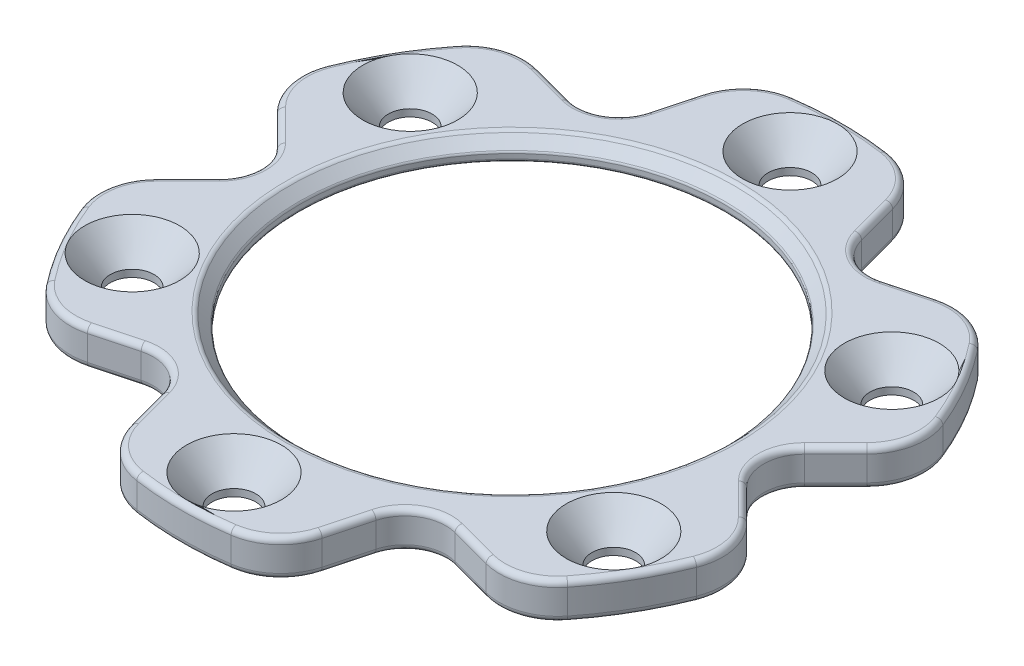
ISO-10303-21;
HEADER;
FILE_DESCRIPTION(('STEP AP214'),'2;1');
FILE_NAME('part.step','',(''),(''),'','','');
FILE_SCHEMA(('AUTOMOTIVE_DESIGN { 1 0 10303 214 1 1 1 1 }'));
ENDSEC;
DATA;
#1=APPLICATION_CONTEXT('core data for automotive mechanical design processes');
#2=APPLICATION_PROTOCOL_DEFINITION('international standard','automotive_design',2000,#1);
#3=PRODUCT_CONTEXT('',#1,'mechanical');
#4=PRODUCT('Part','Part','',(#3));
#5=PRODUCT_RELATED_PRODUCT_CATEGORY('part','',(#4));
#6=PRODUCT_DEFINITION_FORMATION('','',#4);
#7=PRODUCT_DEFINITION_CONTEXT('part definition',#1,'design');
#8=PRODUCT_DEFINITION('design','',#6,#7);
#9=PRODUCT_DEFINITION_SHAPE('','',#8);
#10=(LENGTH_UNIT() NAMED_UNIT(*) SI_UNIT(.MILLI.,.METRE.));
#11=(NAMED_UNIT(*) PLANE_ANGLE_UNIT() SI_UNIT($,.RADIAN.));
#12=(NAMED_UNIT(*) SI_UNIT($,.STERADIAN.) SOLID_ANGLE_UNIT());
#13=UNCERTAINTY_MEASURE_WITH_UNIT(LENGTH_MEASURE(1.E-05),#10,'distance_accuracy_value','');
#14=(GEOMETRIC_REPRESENTATION_CONTEXT(3) GLOBAL_UNCERTAINTY_ASSIGNED_CONTEXT((#13)) GLOBAL_UNIT_ASSIGNED_CONTEXT((#10,
#11,#12)) REPRESENTATION_CONTEXT('',''));
#15=CARTESIAN_POINT('',(0.,0.,0.));
#16=DIRECTION('',(0.,0.,1.));
#17=DIRECTION('',(1.,0.,0.));
#18=AXIS2_PLACEMENT_3D('',#15,#16,#17);
#19=CARTESIAN_POINT('',(0.,3.175,0.));
#20=DIRECTION('',(0.,-1.,0.));
#21=DIRECTION('',(0.,0.,-1.));
#22=AXIS2_PLACEMENT_3D('',#19,#20,#21);
#23=CYLINDRICAL_SURFACE('',#22,28.7655);
#24=DIRECTION('',(0.,-1.,0.));
#25=VECTOR('',#24,1.);
#26=CARTESIAN_POINT('',(22.6106304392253,3.175,17.7823896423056));
#27=LINE('',#26,#25);
#28=CARTESIAN_POINT('',(22.6106304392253,2.667,17.7823896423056));
#29=VERTEX_POINT('',#28);
#30=CARTESIAN_POINT('',(22.6106304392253,0.508,17.7823896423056));
#31=VERTEX_POINT('',#30);
#32=EDGE_CURVE('E1359',#29,#31,#27,.T.);
#33=ORIENTED_EDGE('',*,*,#32,.T.);
#34=CARTESIAN_POINT('',(0.,0.508,0.));
#35=DIRECTION('',(0.,1.,0.));
#36=DIRECTION('',(0.,0.,1.));
#37=AXIS2_PLACEMENT_3D('',#34,#35,#36);
#38=CIRCLE('',#37,28.7655);
#39=CARTESIAN_POINT('',(26.7053163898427,0.508,10.6901855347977));
#40=VERTEX_POINT('',#39);
#41=EDGE_CURVE('E656',#31,#40,#38,.T.);
#42=ORIENTED_EDGE('',*,*,#41,.T.);
#43=DIRECTION('',(0.,-1.,0.));
#44=VECTOR('',#43,1.);
#45=CARTESIAN_POINT('',(26.7053163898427,3.175,10.6901855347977));
#46=LINE('',#45,#44);
#47=CARTESIAN_POINT('',(26.7053163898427,2.667,10.6901855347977));
#48=VERTEX_POINT('',#47);
#49=EDGE_CURVE('E1361',#40,#48,#46,.F.);
#50=ORIENTED_EDGE('',*,*,#49,.T.);
#51=CARTESIAN_POINT('',(0.,2.667,0.));
#52=DIRECTION('',(0.,1.,0.));
#53=DIRECTION('',(0.,0.,1.));
#54=AXIS2_PLACEMENT_3D('',#51,#52,#53);
#55=CIRCLE('',#54,28.7655);
#56=EDGE_CURVE('E654',#48,#29,#55,.F.);
#57=ORIENTED_EDGE('',*,*,#56,.T.);
#58=EDGE_LOOP('',(#33,#42,#50,#57));
#59=FACE_BOUND('',#58,.T.);
#60=ADVANCED_FACE('F45',(#59),#23,.T.);
#61=DIRECTION('',(0.,-1.,0.));
#62=VECTOR('',#61,1.);
#63=CARTESIAN_POINT('',(-4.09468595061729,3.175,28.4725751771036));
#64=LINE('',#63,#62);
#65=CARTESIAN_POINT('',(-4.09468595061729,2.667,28.4725751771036));
#66=VERTEX_POINT('',#65);
#67=CARTESIAN_POINT('',(-4.09468595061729,0.508,28.4725751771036));
#68=VERTEX_POINT('',#67);
#69=EDGE_CURVE('E1351',#66,#68,#64,.T.);
#70=ORIENTED_EDGE('',*,*,#69,.T.);
#71=CARTESIAN_POINT('',(0.,0.508,0.));
#72=DIRECTION('',(0.,1.,0.));
#73=DIRECTION('',(0.,0.,1.));
#74=AXIS2_PLACEMENT_3D('',#71,#72,#73);
#75=CIRCLE('',#74,28.7655);
#76=CARTESIAN_POINT('',(4.09468595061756,0.508,28.4725751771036));
#77=VERTEX_POINT('',#76);
#78=EDGE_CURVE('E689',#68,#77,#75,.T.);
#79=ORIENTED_EDGE('',*,*,#78,.T.);
#80=DIRECTION('',(0.,-1.,0.));
#81=VECTOR('',#80,1.);
#82=CARTESIAN_POINT('',(4.09468595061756,3.175,28.4725751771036));
#83=LINE('',#82,#81);
#84=CARTESIAN_POINT('',(4.09468595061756,2.667,28.4725751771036));
#85=VERTEX_POINT('',#84);
#86=EDGE_CURVE('E1347',#77,#85,#83,.F.);
#87=ORIENTED_EDGE('',*,*,#86,.T.);
#88=CARTESIAN_POINT('',(0.,2.667,0.));
#89=DIRECTION('',(0.,1.,0.));
#90=DIRECTION('',(0.,0.,1.));
#91=AXIS2_PLACEMENT_3D('',#88,#89,#90);
#92=CIRCLE('',#91,28.7655);
#93=EDGE_CURVE('E686',#85,#66,#92,.F.);
#94=ORIENTED_EDGE('',*,*,#93,.T.);
#95=EDGE_LOOP('',(#70,#79,#87,#94));
#96=FACE_BOUND('',#95,.T.);
#97=ADVANCED_FACE('F1177',(#96),#23,.T.);
#98=DIRECTION('',(0.,-1.,0.));
#99=VECTOR('',#98,1.);
#100=CARTESIAN_POINT('',(-26.7053163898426,3.175,10.690185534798));
#101=LINE('',#100,#99);
#102=CARTESIAN_POINT('',(-26.7053163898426,2.667,10.690185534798));
#103=VERTEX_POINT('',#102);
#104=CARTESIAN_POINT('',(-26.7053163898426,0.508,10.690185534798));
#105=VERTEX_POINT('',#104);
#106=EDGE_CURVE('E1107',#103,#105,#101,.T.);
#107=ORIENTED_EDGE('',*,*,#106,.T.);
#108=CARTESIAN_POINT('',(0.,0.508,0.));
#109=DIRECTION('',(0.,1.,0.));
#110=DIRECTION('',(0.,0.,1.));
#111=AXIS2_PLACEMENT_3D('',#108,#109,#110);
#112=CIRCLE('',#111,28.7655);
#113=CARTESIAN_POINT('',(-22.6106304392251,0.508,17.7823896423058));
#114=VERTEX_POINT('',#113);
#115=EDGE_CURVE('E718',#105,#114,#112,.T.);
#116=ORIENTED_EDGE('',*,*,#115,.T.);
#117=DIRECTION('',(0.,-1.,0.));
#118=VECTOR('',#117,1.);
#119=CARTESIAN_POINT('',(-22.6106304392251,3.175,17.7823896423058));
#120=LINE('',#119,#118);
#121=CARTESIAN_POINT('',(-22.6106304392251,2.667,17.7823896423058));
#122=VERTEX_POINT('',#121);
#123=EDGE_CURVE('E1339',#114,#122,#120,.F.);
#124=ORIENTED_EDGE('',*,*,#123,.T.);
#125=CARTESIAN_POINT('',(0.,2.667,0.));
#126=DIRECTION('',(0.,1.,0.));
#127=DIRECTION('',(0.,0.,1.));
#128=AXIS2_PLACEMENT_3D('',#125,#126,#127);
#129=CIRCLE('',#128,28.7655);
#130=EDGE_CURVE('E716',#122,#103,#129,.F.);
#131=ORIENTED_EDGE('',*,*,#130,.T.);
#132=EDGE_LOOP('',(#107,#116,#124,#131));
#133=FACE_BOUND('',#132,.T.);
#134=ADVANCED_FACE('F1184',(#133),#23,.T.);
#135=DIRECTION('',(0.,-1.,0.));
#136=VECTOR('',#135,1.);
#137=CARTESIAN_POINT('',(-22.6106304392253,3.175,-17.7823896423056));
#138=LINE('',#137,#136);
#139=CARTESIAN_POINT('',(-22.6106304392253,2.667,-17.7823896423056));
#140=VERTEX_POINT('',#139);
#141=CARTESIAN_POINT('',(-22.6106304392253,0.508,-17.7823896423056));
#142=VERTEX_POINT('',#141);
#143=EDGE_CURVE('E1113',#140,#142,#138,.T.);
#144=ORIENTED_EDGE('',*,*,#143,.T.);
#145=CARTESIAN_POINT('',(0.,0.508,0.));
#146=DIRECTION('',(0.,1.,0.));
#147=DIRECTION('',(0.,0.,1.));
#148=AXIS2_PLACEMENT_3D('',#145,#146,#147);
#149=CIRCLE('',#148,28.7655);
#150=CARTESIAN_POINT('',(-26.7053163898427,0.508,-10.6901855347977));
#151=VERTEX_POINT('',#150);
#152=EDGE_CURVE('E742',#142,#151,#149,.T.);
#153=ORIENTED_EDGE('',*,*,#152,.T.);
#154=DIRECTION('',(0.,-1.,0.));
#155=VECTOR('',#154,1.);
#156=CARTESIAN_POINT('',(-26.7053163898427,3.175,-10.6901855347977));
#157=LINE('',#156,#155);
#158=CARTESIAN_POINT('',(-26.7053163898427,2.667,-10.6901855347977));
#159=VERTEX_POINT('',#158);
#160=EDGE_CURVE('E1117',#151,#159,#157,.F.);
#161=ORIENTED_EDGE('',*,*,#160,.T.);
#162=CARTESIAN_POINT('',(0.,2.667,0.));
#163=DIRECTION('',(0.,1.,0.));
#164=DIRECTION('',(0.,0.,1.));
#165=AXIS2_PLACEMENT_3D('',#162,#163,#164);
#166=CIRCLE('',#165,28.7655);
#167=EDGE_CURVE('E740',#159,#140,#166,.F.);
#168=ORIENTED_EDGE('',*,*,#167,.T.);
#169=EDGE_LOOP('',(#144,#153,#161,#168));
#170=FACE_BOUND('',#169,.T.);
#171=ADVANCED_FACE('F1204',(#170),#23,.T.);
#172=DIRECTION('',(0.,-1.,0.));
#173=VECTOR('',#172,1.);
#174=CARTESIAN_POINT('',(4.0946859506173,3.175,-28.4725751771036));
#175=LINE('',#174,#173);
#176=CARTESIAN_POINT('',(4.0946859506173,2.667,-28.4725751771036));
#177=VERTEX_POINT('',#176);
#178=CARTESIAN_POINT('',(4.0946859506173,0.508,-28.4725751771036));
#179=VERTEX_POINT('',#178);
#180=EDGE_CURVE('E1215',#177,#179,#175,.T.);
#181=ORIENTED_EDGE('',*,*,#180,.T.);
#182=CARTESIAN_POINT('',(0.,0.508,0.));
#183=DIRECTION('',(0.,1.,0.));
#184=DIRECTION('',(0.,0.,1.));
#185=AXIS2_PLACEMENT_3D('',#182,#183,#184);
#186=CIRCLE('',#185,28.7655);
#187=CARTESIAN_POINT('',(-4.09468595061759,0.508,-28.4725751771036));
#188=VERTEX_POINT('',#187);
#189=EDGE_CURVE('E766',#179,#188,#186,.T.);
#190=ORIENTED_EDGE('',*,*,#189,.T.);
#191=DIRECTION('',(0.,-1.,0.));
#192=VECTOR('',#191,1.);
#193=CARTESIAN_POINT('',(-4.09468595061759,3.175,-28.4725751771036));
#194=LINE('',#193,#192);
#195=CARTESIAN_POINT('',(-4.09468595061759,2.667,-28.4725751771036));
#196=VERTEX_POINT('',#195);
#197=EDGE_CURVE('E1223',#188,#196,#194,.F.);
#198=ORIENTED_EDGE('',*,*,#197,.T.);
#199=CARTESIAN_POINT('',(0.,2.667,0.));
#200=DIRECTION('',(0.,1.,0.));
#201=DIRECTION('',(0.,0.,1.));
#202=AXIS2_PLACEMENT_3D('',#199,#200,#201);
#203=CIRCLE('',#202,28.7655);
#204=EDGE_CURVE('E764',#196,#177,#203,.F.);
#205=ORIENTED_EDGE('',*,*,#204,.T.);
#206=EDGE_LOOP('',(#181,#190,#198,#205));
#207=FACE_BOUND('',#206,.T.);
#208=ADVANCED_FACE('F1192',(#207),#23,.T.);
#209=CARTESIAN_POINT('',(0.,3.175,0.));
#210=DIRECTION('',(0.,-1.,0.));
#211=DIRECTION('',(0.,0.,-1.));
#212=AXIS2_PLACEMENT_3D('',#209,#210,#211);
#213=CYLINDRICAL_SURFACE('',#212,18.415);
#214=CARTESIAN_POINT('',(0.,2.05378975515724,0.));
#215=DIRECTION('',(0.,-1.,0.));
#216=DIRECTION('',(0.,0.,-1.));
#217=AXIS2_PLACEMENT_3D('',#214,#215,#216);
#218=CIRCLE('',#217,18.415);
#219=CARTESIAN_POINT('',(0.,2.05378975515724,-18.415));
#220=VERTEX_POINT('',#219);
#221=EDGE_CURVE('E1136',#220,#220,#218,.F.);
#222=ORIENTED_EDGE('',*,*,#221,.T.);
#223=EDGE_LOOP('',(#222));
#224=FACE_BOUND('',#223,.T.);
#225=CARTESIAN_POINT('',(0.,1.651,0.));
#226=DIRECTION('',(0.,-1.,0.));
#227=DIRECTION('',(0.,0.,-1.));
#228=AXIS2_PLACEMENT_3D('',#225,#226,#227);
#229=CIRCLE('',#228,18.415);
#230=CARTESIAN_POINT('',(0.,1.651,-18.415));
#231=VERTEX_POINT('',#230);
#232=EDGE_CURVE('E1133',#231,#231,#229,.T.);
#233=ORIENTED_EDGE('',*,*,#232,.T.);
#234=EDGE_LOOP('',(#233));
#235=FACE_BOUND('',#234,.T.);
#236=ADVANCED_FACE('F1203',(#224,#235),#213,.F.);
#237=CARTESIAN_POINT('',(0.,3.175,0.));
#238=DIRECTION('',(0.,1.,0.));
#239=DIRECTION('',(0.,0.,1.));
#240=AXIS2_PLACEMENT_3D('',#237,#238,#239);
#241=PLANE('',#240);
#242=DIRECTION('',(-0.707106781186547,0.,0.707106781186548));
#243=VECTOR('',#242,1.);
#244=CARTESIAN_POINT('',(25.2220379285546,3.175,-5.56940184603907));
#245=LINE('',#244,#243);
#246=CARTESIAN_POINT('',(22.5263180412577,3.175,-2.87368195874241));
#247=VERTEX_POINT('',#246);
#248=CARTESIAN_POINT('',(25.2220379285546,3.175,-5.56940184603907));
#249=VERTEX_POINT('',#248);
#250=EDGE_CURVE('E63',#247,#249,#245,.F.);
#251=ORIENTED_EDGE('',*,*,#250,.T.);
#252=CARTESIAN_POINT('',(21.9891457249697,3.175,-8.80229404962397));
#253=DIRECTION('',(0.,1.,0.));
#254=DIRECTION('',(0.,0.,1.));
#255=AXIS2_PLACEMENT_3D('',#252,#253,#254);
#256=CIRCLE('',#255,4.572);
#257=CARTESIAN_POINT('',(26.2336993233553,3.175,-10.5013963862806));
#258=VERTEX_POINT('',#257);
#259=EDGE_CURVE('E865',#249,#258,#256,.T.);
#260=ORIENTED_EDGE('',*,*,#259,.T.);
#261=CARTESIAN_POINT('',(0.,3.175,0.));
#262=DIRECTION('',(0.,1.,0.));
#263=DIRECTION('',(0.,0.,1.));
#264=AXIS2_PLACEMENT_3D('',#261,#262,#263);
#265=CIRCLE('',#264,28.2575);
#266=CARTESIAN_POINT('',(22.2113257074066,3.175,-17.4683518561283));
#267=VERTEX_POINT('',#266);
#268=EDGE_CURVE('E791',#258,#267,#265,.T.);
#269=ORIENTED_EDGE('',*,*,#268,.T.);
#270=CARTESIAN_POINT('',(18.6175831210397,3.175,-14.64201178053));
#271=DIRECTION('',(0.,1.,0.));
#272=DIRECTION('',(0.,0.,1.));
#273=AXIS2_PLACEMENT_3D('',#270,#271,#272);
#274=CIRCLE('',#273,4.572);
#275=CARTESIAN_POINT('',(17.4342624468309,3.175,-19.0582246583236));
#276=VERTEX_POINT('',#275);
#277=EDGE_CURVE('E793',#267,#276,#274,.T.);
#278=ORIENTED_EDGE('',*,*,#277,.T.);
#279=DIRECTION('',(0.965925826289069,0.,-0.258819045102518));
#280=VECTOR('',#279,1.);
#281=CARTESIAN_POINT('',(13.7518405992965,3.175,-18.071522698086));
#282=LINE('',#281,#280);
#283=CARTESIAN_POINT('',(13.7518405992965,3.175,-18.071522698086));
#284=VERTEX_POINT('',#283);
#285=EDGE_CURVE('E795',#276,#284,#282,.F.);
#286=ORIENTED_EDGE('',*,*,#285,.T.);
#287=CARTESIAN_POINT('',(12.6999999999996,3.175,-21.997045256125));
#288=DIRECTION('',(0.,1.,0.));
#289=DIRECTION('',(0.,0.,1.));
#290=AXIS2_PLACEMENT_3D('',#287,#288,#289);
#291=CIRCLE('',#290,4.06400000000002);
#292=CARTESIAN_POINT('',(8.77447744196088,3.175,-20.9452046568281));
#293=VERTEX_POINT('',#292);
#294=EDGE_CURVE('E797',#284,#293,#291,.F.);
#295=ORIENTED_EDGE('',*,*,#294,.T.);
#296=DIRECTION('',(0.258819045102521,0.,0.965925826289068));
#297=VECTOR('',#296,1.);
#298=CARTESIAN_POINT('',(7.78777548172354,3.175,-24.6276265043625));
#299=LINE('',#298,#297);
#300=CARTESIAN_POINT('',(7.78777548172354,3.175,-24.6276265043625));
#301=VERTEX_POINT('',#300);
#302=EDGE_CURVE('E799',#293,#301,#299,.F.);
#303=ORIENTED_EDGE('',*,*,#302,.T.);
#304=CARTESIAN_POINT('',(3.37156260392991,3.175,-23.4443058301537));
#305=DIRECTION('',(0.,1.,0.));
#306=DIRECTION('',(0.,0.,1.));
#307=AXIS2_PLACEMENT_3D('',#304,#305,#306);
#308=CIRCLE('',#307,4.572);
#309=CARTESIAN_POINT('',(4.02237361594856,3.175,-27.9697482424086));
#310=VERTEX_POINT('',#309);
#311=EDGE_CURVE('E801',#301,#310,#308,.T.);
#312=ORIENTED_EDGE('',*,*,#311,.T.);
#313=CARTESIAN_POINT('',(0.,3.175,0.));
#314=DIRECTION('',(0.,1.,0.));
#315=DIRECTION('',(0.,0.,1.));
#316=AXIS2_PLACEMENT_3D('',#313,#314,#315);
#317=CIRCLE('',#316,28.2575);
#318=CARTESIAN_POINT('',(-4.02237361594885,3.175,-27.9697482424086));
#319=VERTEX_POINT('',#318);
#320=EDGE_CURVE('E803',#310,#319,#317,.T.);
#321=ORIENTED_EDGE('',*,*,#320,.T.);
#322=CARTESIAN_POINT('',(-3.37156260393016,3.175,-23.4443058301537));
#323=DIRECTION('',(0.,1.,0.));
#324=DIRECTION('',(0.,0.,1.));
#325=AXIS2_PLACEMENT_3D('',#322,#323,#324);
#326=CIRCLE('',#325,4.572);
#327=CARTESIAN_POINT('',(-7.78777548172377,3.175,-24.6276265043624));
#328=VERTEX_POINT('',#327);
#329=EDGE_CURVE('E805',#319,#328,#326,.T.);
#330=ORIENTED_EDGE('',*,*,#329,.T.);
#331=DIRECTION('',(0.258819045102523,0.,-0.965925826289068));
#332=VECTOR('',#331,1.);
#333=CARTESIAN_POINT('',(-8.77447744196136,3.175,-20.945204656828));
#334=LINE('',#333,#332);
#335=CARTESIAN_POINT('',(-8.77447744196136,3.175,-20.945204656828));
#336=VERTEX_POINT('',#335);
#337=EDGE_CURVE('E807',#328,#336,#334,.F.);
#338=ORIENTED_EDGE('',*,*,#337,.T.);
#339=CARTESIAN_POINT('',(-12.7000000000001,3.175,-21.9970452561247));
#340=DIRECTION('',(0.,1.,0.));
#341=DIRECTION('',(0.,0.,1.));
#342=AXIS2_PLACEMENT_3D('',#339,#340,#341);
#343=CIRCLE('',#342,4.06400000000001);
#344=CARTESIAN_POINT('',(-13.7518405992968,3.175,-18.0715226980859));
#345=VERTEX_POINT('',#344);
#346=EDGE_CURVE('E809',#336,#345,#343,.F.);
#347=ORIENTED_EDGE('',*,*,#346,.T.);
#348=DIRECTION('',(0.965925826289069,0.,0.25881904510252));
#349=VECTOR('',#348,1.);
#350=CARTESIAN_POINT('',(-17.4342624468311,3.175,-19.0582246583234));
#351=LINE('',#350,#349);
#352=CARTESIAN_POINT('',(-17.4342624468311,3.175,-19.0582246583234));
#353=VERTEX_POINT('',#352);
#354=EDGE_CURVE('E811',#345,#353,#351,.F.);
#355=ORIENTED_EDGE('',*,*,#354,.T.);
#356=CARTESIAN_POINT('',(-18.6175831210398,3.175,-14.6420117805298));
#357=DIRECTION('',(0.,1.,0.));
#358=DIRECTION('',(0.,0.,1.));
#359=AXIS2_PLACEMENT_3D('',#356,#357,#358);
#360=CIRCLE('',#359,4.572);
#361=CARTESIAN_POINT('',(-22.2113257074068,3.175,-17.468351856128));
#362=VERTEX_POINT('',#361);
#363=EDGE_CURVE('E813',#353,#362,#360,.T.);
#364=ORIENTED_EDGE('',*,*,#363,.T.);
#365=CARTESIAN_POINT('',(0.,3.175,0.));
#366=DIRECTION('',(0.,1.,0.));
#367=DIRECTION('',(0.,0.,1.));
#368=AXIS2_PLACEMENT_3D('',#365,#366,#367);
#369=CIRCLE('',#368,28.2575);
#370=CARTESIAN_POINT('',(-26.2336993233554,3.175,-10.5013963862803));
#371=VERTEX_POINT('',#370);
#372=EDGE_CURVE('E815',#362,#371,#369,.T.);
#373=ORIENTED_EDGE('',*,*,#372,.T.);
#374=CARTESIAN_POINT('',(-21.9891457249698,3.175,-8.80229404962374));
#375=DIRECTION('',(0.,1.,0.));
#376=DIRECTION('',(0.,0.,1.));
#377=AXIS2_PLACEMENT_3D('',#374,#375,#376);
#378=CIRCLE('',#377,4.572);
#379=CARTESIAN_POINT('',(-25.2220379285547,3.175,-5.56940184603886));
#380=VERTEX_POINT('',#379);
#381=EDGE_CURVE('E817',#371,#380,#378,.T.);
#382=ORIENTED_EDGE('',*,*,#381,.T.);
#383=DIRECTION('',(-0.707106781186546,0.,-0.707106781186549));
#384=VECTOR('',#383,1.);
#385=CARTESIAN_POINT('',(-22.5263180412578,3.175,-2.87368195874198));
#386=LINE('',#385,#384);
#387=CARTESIAN_POINT('',(-22.5263180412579,3.175,-2.87368195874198));
#388=VERTEX_POINT('',#387);
#389=EDGE_CURVE('E819',#380,#388,#386,.F.);
#390=ORIENTED_EDGE('',*,*,#389,.T.);
#391=CARTESIAN_POINT('',(-25.4,3.175,2.04697370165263E-13));
#392=DIRECTION('',(0.,1.,0.));
#393=DIRECTION('',(0.,0.,1.));
#394=AXIS2_PLACEMENT_3D('',#391,#392,#393);
#395=CIRCLE('',#394,4.06400000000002);
#396=CARTESIAN_POINT('',(-22.5263180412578,3.175,2.87368195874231));
#397=VERTEX_POINT('',#396);
#398=EDGE_CURVE('E821',#388,#397,#395,.F.);
#399=ORIENTED_EDGE('',*,*,#398,.T.);
#400=DIRECTION('',(0.707106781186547,0.,-0.707106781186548));
#401=VECTOR('',#400,1.);
#402=CARTESIAN_POINT('',(-25.2220379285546,3.175,5.56940184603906));
#403=LINE('',#402,#401);
#404=CARTESIAN_POINT('',(-25.2220379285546,3.175,5.56940184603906));
#405=VERTEX_POINT('',#404);
#406=EDGE_CURVE('E823',#397,#405,#403,.F.);
#407=ORIENTED_EDGE('',*,*,#406,.T.);
#408=CARTESIAN_POINT('',(-21.9891457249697,3.175,8.80229404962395));
#409=DIRECTION('',(0.,1.,0.));
#410=DIRECTION('',(0.,0.,1.));
#411=AXIS2_PLACEMENT_3D('',#408,#409,#410);
#412=CIRCLE('',#411,4.572);
#413=CARTESIAN_POINT('',(-26.2336993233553,3.175,10.5013963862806));
#414=VERTEX_POINT('',#413);
#415=EDGE_CURVE('E825',#405,#414,#412,.T.);
#416=ORIENTED_EDGE('',*,*,#415,.T.);
#417=CARTESIAN_POINT('',(0.,3.175,0.));
#418=DIRECTION('',(0.,1.,0.));
#419=DIRECTION('',(0.,0.,1.));
#420=AXIS2_PLACEMENT_3D('',#417,#418,#419);
#421=CIRCLE('',#420,28.2575);
#422=CARTESIAN_POINT('',(-22.2113257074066,3.175,17.4683518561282));
#423=VERTEX_POINT('',#422);
#424=EDGE_CURVE('E827',#414,#423,#421,.T.);
#425=ORIENTED_EDGE('',*,*,#424,.T.);
#426=CARTESIAN_POINT('',(-18.6175831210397,3.175,14.64201178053));
#427=DIRECTION('',(0.,1.,0.));
#428=DIRECTION('',(0.,0.,1.));
#429=AXIS2_PLACEMENT_3D('',#426,#427,#428);
#430=CIRCLE('',#429,4.572);
#431=CARTESIAN_POINT('',(-17.434262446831,3.175,19.0582246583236));
#432=VERTEX_POINT('',#431);
#433=EDGE_CURVE('E829',#423,#432,#430,.T.);
#434=ORIENTED_EDGE('',*,*,#433,.T.);
#435=DIRECTION('',(-0.965925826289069,0.,0.258819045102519));
#436=VECTOR('',#435,1.);
#437=CARTESIAN_POINT('',(-13.7518405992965,3.175,18.071522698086));
#438=LINE('',#437,#436);
#439=CARTESIAN_POINT('',(-13.7518405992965,3.175,18.071522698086));
#440=VERTEX_POINT('',#439);
#441=EDGE_CURVE('E831',#432,#440,#438,.F.);
#442=ORIENTED_EDGE('',*,*,#441,.T.);
#443=CARTESIAN_POINT('',(-12.6999999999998,3.175,21.9970452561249));
#444=DIRECTION('',(0.,1.,0.));
#445=DIRECTION('',(0.,0.,1.));
#446=AXIS2_PLACEMENT_3D('',#443,#444,#445);
#447=CIRCLE('',#446,4.06400000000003);
#448=CARTESIAN_POINT('',(-8.774477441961,3.175,20.9452046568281));
#449=VERTEX_POINT('',#448);
#450=EDGE_CURVE('E833',#440,#449,#447,.F.);
#451=ORIENTED_EDGE('',*,*,#450,.T.);
#452=DIRECTION('',(-0.258819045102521,0.,-0.965925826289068));
#453=VECTOR('',#452,1.);
#454=CARTESIAN_POINT('',(-7.78777548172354,3.175,24.6276265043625));
#455=LINE('',#454,#453);
#456=CARTESIAN_POINT('',(-7.78777548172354,3.175,24.6276265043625));
#457=VERTEX_POINT('',#456);
#458=EDGE_CURVE('E835',#449,#457,#455,.F.);
#459=ORIENTED_EDGE('',*,*,#458,.T.);
#460=CARTESIAN_POINT('',(-3.37156260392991,3.175,23.4443058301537));
#461=DIRECTION('',(0.,1.,0.));
#462=DIRECTION('',(0.,0.,1.));
#463=AXIS2_PLACEMENT_3D('',#460,#461,#462);
#464=CIRCLE('',#463,4.572);
#465=CARTESIAN_POINT('',(-4.02237361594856,3.175,27.9697482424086));
#466=VERTEX_POINT('',#465);
#467=EDGE_CURVE('E838',#457,#466,#464,.T.);
#468=ORIENTED_EDGE('',*,*,#467,.T.);
#469=CARTESIAN_POINT('',(0.,3.175,0.));
#470=DIRECTION('',(0.,1.,0.));
#471=DIRECTION('',(0.,0.,1.));
#472=AXIS2_PLACEMENT_3D('',#469,#470,#471);
#473=CIRCLE('',#472,28.2575);
#474=CARTESIAN_POINT('',(4.02237361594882,3.175,27.9697482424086));
#475=VERTEX_POINT('',#474);
#476=EDGE_CURVE('E841',#466,#475,#473,.T.);
#477=ORIENTED_EDGE('',*,*,#476,.T.);
#478=CARTESIAN_POINT('',(3.37156260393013,3.175,23.4443058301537));
#479=DIRECTION('',(0.,1.,0.));
#480=DIRECTION('',(0.,0.,1.));
#481=AXIS2_PLACEMENT_3D('',#478,#479,#480);
#482=CIRCLE('',#481,4.572);
#483=CARTESIAN_POINT('',(7.78777548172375,3.175,24.6276265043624));
#484=VERTEX_POINT('',#483);
#485=EDGE_CURVE('E844',#475,#484,#482,.T.);
#486=ORIENTED_EDGE('',*,*,#485,.T.);
#487=DIRECTION('',(-0.258819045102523,0.,0.965925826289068));
#488=VECTOR('',#487,1.);
#489=CARTESIAN_POINT('',(8.77447744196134,3.175,20.945204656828));
#490=LINE('',#489,#488);
#491=CARTESIAN_POINT('',(8.77447744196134,3.175,20.945204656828));
#492=VERTEX_POINT('',#491);
#493=EDGE_CURVE('E847',#484,#492,#490,.F.);
#494=ORIENTED_EDGE('',*,*,#493,.T.);
#495=CARTESIAN_POINT('',(12.7000000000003,3.175,21.9970452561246));
#496=DIRECTION('',(0.,1.,0.));
#497=DIRECTION('',(0.,0.,1.));
#498=AXIS2_PLACEMENT_3D('',#495,#496,#497);
#499=CIRCLE('',#498,4.06400000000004);
#500=CARTESIAN_POINT('',(13.7518405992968,3.175,18.0715226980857));
#501=VERTEX_POINT('',#500);
#502=EDGE_CURVE('E850',#492,#501,#499,.F.);
#503=ORIENTED_EDGE('',*,*,#502,.T.);
#504=DIRECTION('',(-0.965925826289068,0.,-0.258819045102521));
#505=VECTOR('',#504,1.);
#506=CARTESIAN_POINT('',(17.4342624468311,3.175,19.0582246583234));
#507=LINE('',#506,#505);
#508=CARTESIAN_POINT('',(17.4342624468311,3.175,19.0582246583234));
#509=VERTEX_POINT('',#508);
#510=EDGE_CURVE('E853',#501,#509,#507,.F.);
#511=ORIENTED_EDGE('',*,*,#510,.T.);
#512=CARTESIAN_POINT('',(18.6175831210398,3.175,14.6420117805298));
#513=DIRECTION('',(0.,1.,0.));
#514=DIRECTION('',(0.,0.,1.));
#515=AXIS2_PLACEMENT_3D('',#512,#513,#514);
#516=CIRCLE('',#515,4.572);
#517=CARTESIAN_POINT('',(22.2113257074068,3.175,17.468351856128));
#518=VERTEX_POINT('',#517);
#519=EDGE_CURVE('E855',#509,#518,#516,.T.);
#520=ORIENTED_EDGE('',*,*,#519,.T.);
#521=CARTESIAN_POINT('',(0.,3.175,0.));
#522=DIRECTION('',(0.,1.,0.));
#523=DIRECTION('',(0.,0.,1.));
#524=AXIS2_PLACEMENT_3D('',#521,#522,#523);
#525=CIRCLE('',#524,28.2575);
#526=CARTESIAN_POINT('',(26.2336993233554,3.175,10.5013963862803));
#527=VERTEX_POINT('',#526);
#528=EDGE_CURVE('E857',#518,#527,#525,.T.);
#529=ORIENTED_EDGE('',*,*,#528,.T.);
#530=CARTESIAN_POINT('',(21.9891457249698,3.175,8.80229404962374));
#531=DIRECTION('',(0.,1.,0.));
#532=DIRECTION('',(0.,0.,1.));
#533=AXIS2_PLACEMENT_3D('',#530,#531,#532);
#534=CIRCLE('',#533,4.572);
#535=CARTESIAN_POINT('',(25.2220379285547,3.175,5.56940184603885));
#536=VERTEX_POINT('',#535);
#537=EDGE_CURVE('E859',#527,#536,#534,.T.);
#538=ORIENTED_EDGE('',*,*,#537,.T.);
#539=DIRECTION('',(0.707106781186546,0.,0.707106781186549));
#540=VECTOR('',#539,1.);
#541=CARTESIAN_POINT('',(22.5263180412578,3.175,2.87368195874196));
#542=LINE('',#541,#540);
#543=CARTESIAN_POINT('',(22.5263180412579,3.175,2.87368195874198));
#544=VERTEX_POINT('',#543);
#545=EDGE_CURVE('E861',#536,#544,#542,.F.);
#546=ORIENTED_EDGE('',*,*,#545,.T.);
#547=CARTESIAN_POINT('',(25.4,3.175,-3.83373888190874E-13));
#548=DIRECTION('',(0.,1.,0.));
#549=DIRECTION('',(0.,0.,1.));
#550=AXIS2_PLACEMENT_3D('',#547,#548,#549);
#551=CIRCLE('',#550,4.06400000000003);
#552=EDGE_CURVE('E68',#544,#247,#551,.F.);
#553=ORIENTED_EDGE('',*,*,#552,.T.);
#554=EDGE_LOOP('',(#251,#260,#269,#278,#286,#295,#303,#312,#321,#330,#338,#347,#355,#364,#373,
#382,#390,#399,#407,#416,#425,#434,#442,#451,#459,#468,#477,#486,#494,#503,#511,#520,#529,#538,
#546,#553));
#555=FACE_BOUND('',#554,.T.);
#556=CARTESIAN_POINT('',(0.,3.175,0.));
#557=DIRECTION('',(0.,1.,0.));
#558=DIRECTION('',(0.,0.,1.));
#559=AXIS2_PLACEMENT_3D('',#556,#557,#558);
#560=CIRCLE('',#559,19.6414204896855);
#561=CARTESIAN_POINT('',(0.,3.175,19.6414204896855));
#562=VERTEX_POINT('',#561);
#563=EDGE_CURVE('E787',#562,#562,#560,.F.);
#564=ORIENTED_EDGE('',*,*,#563,.T.);
#565=EDGE_LOOP('',(#564));
#566=FACE_BOUND('',#565,.T.);
#567=CARTESIAN_POINT('',(20.8971929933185,3.175,-12.065));
#568=DIRECTION('',(0.,1.,0.));
#569=DIRECTION('',(0.,0.,1.));
#570=AXIS2_PLACEMENT_3D('',#567,#568,#569);
#571=CIRCLE('',#570,4.1196895);
#572=CARTESIAN_POINT('',(20.8971929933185,3.175,-7.9453105));
#573=VERTEX_POINT('',#572);
#574=EDGE_CURVE('E1424',#573,#573,#571,.T.);
#575=ORIENTED_EDGE('',*,*,#574,.F.);
#576=EDGE_LOOP('',(#575));
#577=FACE_BOUND('',#576,.T.);
#578=CARTESIAN_POINT('',(-20.8971929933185,3.175,12.065));
#579=DIRECTION('',(0.,1.,0.));
#580=DIRECTION('',(0.,0.,1.));
#581=AXIS2_PLACEMENT_3D('',#578,#579,#580);
#582=CIRCLE('',#581,4.1196895);
#583=CARTESIAN_POINT('',(-20.8971929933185,3.175,16.1846895));
#584=VERTEX_POINT('',#583);
#585=EDGE_CURVE('E1435',#584,#584,#582,.T.);
#586=ORIENTED_EDGE('',*,*,#585,.F.);
#587=EDGE_LOOP('',(#586));
#588=FACE_BOUND('',#587,.T.);
#589=CARTESIAN_POINT('',(0.,3.175,-24.13));
#590=DIRECTION('',(0.,1.,0.));
#591=DIRECTION('',(0.,0.,1.));
#592=AXIS2_PLACEMENT_3D('',#589,#590,#591);
#593=CIRCLE('',#592,4.1196895);
#594=CARTESIAN_POINT('',(0.,3.175,-20.0103105));
#595=VERTEX_POINT('',#594);
#596=EDGE_CURVE('E1444',#595,#595,#593,.T.);
#597=ORIENTED_EDGE('',*,*,#596,.F.);
#598=EDGE_LOOP('',(#597));
#599=FACE_BOUND('',#598,.T.);
#600=CARTESIAN_POINT('',(-20.8971929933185,3.175,-12.065));
#601=DIRECTION('',(0.,1.,0.));
#602=DIRECTION('',(0.,0.,1.));
#603=AXIS2_PLACEMENT_3D('',#600,#601,#602);
#604=CIRCLE('',#603,4.1196895);
#605=CARTESIAN_POINT('',(-20.8971929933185,3.175,-7.9453105));
#606=VERTEX_POINT('',#605);
#607=EDGE_CURVE('E1453',#606,#606,#604,.T.);
#608=ORIENTED_EDGE('',*,*,#607,.F.);
#609=EDGE_LOOP('',(#608));
#610=FACE_BOUND('',#609,.T.);
#611=CARTESIAN_POINT('',(0.,3.175,24.13));
#612=DIRECTION('',(0.,1.,0.));
#613=DIRECTION('',(0.,0.,1.));
#614=AXIS2_PLACEMENT_3D('',#611,#612,#613);
#615=CIRCLE('',#614,4.1196895);
#616=CARTESIAN_POINT('',(0.,3.175,28.2496895));
#617=VERTEX_POINT('',#616);
#618=EDGE_CURVE('E1462',#617,#617,#615,.T.);
#619=ORIENTED_EDGE('',*,*,#618,.F.);
#620=EDGE_LOOP('',(#619));
#621=FACE_BOUND('',#620,.T.);
#622=CARTESIAN_POINT('',(20.8971929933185,3.175,12.065));
#623=DIRECTION('',(0.,1.,0.));
#624=DIRECTION('',(0.,0.,1.));
#625=AXIS2_PLACEMENT_3D('',#622,#623,#624);
#626=CIRCLE('',#625,4.1196895);
#627=CARTESIAN_POINT('',(20.8971929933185,3.175,16.1846895));
#628=VERTEX_POINT('',#627);
#629=EDGE_CURVE('E1474',#628,#628,#626,.T.);
#630=ORIENTED_EDGE('',*,*,#629,.F.);
#631=EDGE_LOOP('',(#630));
#632=FACE_BOUND('',#631,.T.);
#633=ADVANCED_FACE('F1200',(#555,#566,#577,#588,#599,#610,#621,#632),#241,.T.);
#634=CARTESIAN_POINT('',(0.,0.,0.));
#635=DIRECTION('',(0.,1.,0.));
#636=DIRECTION('',(0.,0.,1.));
#637=AXIS2_PLACEMENT_3D('',#634,#635,#636);
#638=PLANE('',#637);
#639=CARTESIAN_POINT('',(0.,0.,0.));
#640=DIRECTION('',(0.,1.,0.));
#641=DIRECTION('',(0.,0.,1.));
#642=AXIS2_PLACEMENT_3D('',#639,#640,#641);
#643=CIRCLE('',#642,28.2575);
#644=CARTESIAN_POINT('',(22.2113257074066,0.,-17.4683518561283));
#645=VERTEX_POINT('',#644);
#646=CARTESIAN_POINT('',(26.2336993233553,0.,-10.5013963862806));
#647=VERTEX_POINT('',#646);
#648=EDGE_CURVE('E527',#645,#647,#643,.F.);
#649=ORIENTED_EDGE('',*,*,#648,.T.);
#650=CARTESIAN_POINT('',(21.9891457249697,0.,-8.80229404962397));
#651=DIRECTION('',(0.,1.,0.));
#652=DIRECTION('',(0.,0.,1.));
#653=AXIS2_PLACEMENT_3D('',#650,#651,#652);
#654=CIRCLE('',#653,4.572);
#655=CARTESIAN_POINT('',(25.2220379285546,0.,-5.56940184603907));
#656=VERTEX_POINT('',#655);
#657=EDGE_CURVE('E630',#647,#656,#654,.F.);
#658=ORIENTED_EDGE('',*,*,#657,.T.);
#659=DIRECTION('',(-0.707106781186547,0.,0.707106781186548));
#660=VECTOR('',#659,1.);
#661=CARTESIAN_POINT('',(9.82631804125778,0.,9.82631804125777));
#662=LINE('',#661,#660);
#663=CARTESIAN_POINT('',(22.5263180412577,0.,-2.87368195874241));
#664=VERTEX_POINT('',#663);
#665=EDGE_CURVE('E628',#656,#664,#662,.T.);
#666=ORIENTED_EDGE('',*,*,#665,.T.);
#667=CARTESIAN_POINT('',(25.4,0.,-3.83373888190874E-13));
#668=DIRECTION('',(0.,1.,0.));
#669=DIRECTION('',(0.,0.,1.));
#670=AXIS2_PLACEMENT_3D('',#667,#668,#669);
#671=CIRCLE('',#670,4.06400000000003);
#672=CARTESIAN_POINT('',(22.5263180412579,0.,2.87368195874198));
#673=VERTEX_POINT('',#672);
#674=EDGE_CURVE('E626',#664,#673,#671,.T.);
#675=ORIENTED_EDGE('',*,*,#674,.T.);
#676=DIRECTION('',(0.707106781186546,0.,0.707106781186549));
#677=VECTOR('',#676,1.);
#678=CARTESIAN_POINT('',(9.826318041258,0.,-9.82631804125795));
#679=LINE('',#678,#677);
#680=CARTESIAN_POINT('',(25.2220379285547,0.,5.56940184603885));
#681=VERTEX_POINT('',#680);
#682=EDGE_CURVE('E624',#673,#681,#679,.T.);
#683=ORIENTED_EDGE('',*,*,#682,.T.);
#684=CARTESIAN_POINT('',(21.9891457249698,0.,8.80229404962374));
#685=DIRECTION('',(0.,1.,0.));
#686=DIRECTION('',(0.,0.,1.));
#687=AXIS2_PLACEMENT_3D('',#684,#685,#686);
#688=CIRCLE('',#687,4.572);
#689=CARTESIAN_POINT('',(26.2336993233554,0.,10.5013963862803));
#690=VERTEX_POINT('',#689);
#691=EDGE_CURVE('E622',#681,#690,#688,.F.);
#692=ORIENTED_EDGE('',*,*,#691,.T.);
#693=CARTESIAN_POINT('',(0.,0.,0.));
#694=DIRECTION('',(0.,1.,0.));
#695=DIRECTION('',(0.,0.,1.));
#696=AXIS2_PLACEMENT_3D('',#693,#694,#695);
#697=CIRCLE('',#696,28.2575);
#698=CARTESIAN_POINT('',(22.2113257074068,0.,17.468351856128));
#699=VERTEX_POINT('',#698);
#700=EDGE_CURVE('E619',#690,#699,#697,.F.);
#701=ORIENTED_EDGE('',*,*,#700,.T.);
#702=CARTESIAN_POINT('',(18.6175831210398,0.,14.6420117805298));
#703=DIRECTION('',(0.,1.,0.));
#704=DIRECTION('',(0.,0.,1.));
#705=AXIS2_PLACEMENT_3D('',#702,#703,#704);
#706=CIRCLE('',#705,4.572);
#707=CARTESIAN_POINT('',(17.4342624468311,0.,19.0582246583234));
#708=VERTEX_POINT('',#707);
#709=EDGE_CURVE('E616',#699,#708,#706,.F.);
#710=ORIENTED_EDGE('',*,*,#709,.T.);
#711=DIRECTION('',(-0.965925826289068,0.,-0.258819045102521));
#712=VECTOR('',#711,1.);
#713=CARTESIAN_POINT('',(-3.59668202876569,0.,13.4230000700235));
#714=LINE('',#713,#712);
#715=CARTESIAN_POINT('',(13.7518405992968,0.,18.0715226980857));
#716=VERTEX_POINT('',#715);
#717=EDGE_CURVE('E613',#708,#716,#714,.T.);
#718=ORIENTED_EDGE('',*,*,#717,.T.);
#719=CARTESIAN_POINT('',(12.7000000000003,0.,21.9970452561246));
#720=DIRECTION('',(0.,1.,0.));
#721=DIRECTION('',(0.,0.,1.));
#722=AXIS2_PLACEMENT_3D('',#719,#720,#721);
#723=CIRCLE('',#722,4.06400000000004);
#724=CARTESIAN_POINT('',(8.77447744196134,0.,20.945204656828));
#725=VERTEX_POINT('',#724);
#726=EDGE_CURVE('E610',#716,#725,#723,.T.);
#727=ORIENTED_EDGE('',*,*,#726,.T.);
#728=DIRECTION('',(-0.258819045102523,0.,0.965925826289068));
#729=VECTOR('',#728,1.);
#730=CARTESIAN_POINT('',(13.4230000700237,0.,3.59668202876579));
#731=LINE('',#730,#729);
#732=CARTESIAN_POINT('',(7.78777548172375,0.,24.6276265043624));
#733=VERTEX_POINT('',#732);
#734=EDGE_CURVE('E607',#725,#733,#731,.T.);
#735=ORIENTED_EDGE('',*,*,#734,.T.);
#736=CARTESIAN_POINT('',(3.37156260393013,0.,23.4443058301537));
#737=DIRECTION('',(0.,1.,0.));
#738=DIRECTION('',(0.,0.,1.));
#739=AXIS2_PLACEMENT_3D('',#736,#737,#738);
#740=CIRCLE('',#739,4.572);
#741=CARTESIAN_POINT('',(4.02237361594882,0.,27.9697482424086));
#742=VERTEX_POINT('',#741);
#743=EDGE_CURVE('E604',#733,#742,#740,.F.);
#744=ORIENTED_EDGE('',*,*,#743,.T.);
#745=CARTESIAN_POINT('',(0.,0.,0.));
#746=DIRECTION('',(0.,1.,0.));
#747=DIRECTION('',(0.,0.,1.));
#748=AXIS2_PLACEMENT_3D('',#745,#746,#747);
#749=CIRCLE('',#748,28.2575);
#750=CARTESIAN_POINT('',(-4.02237361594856,0.,27.9697482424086));
#751=VERTEX_POINT('',#750);
#752=EDGE_CURVE('E601',#742,#751,#749,.F.);
#753=ORIENTED_EDGE('',*,*,#752,.T.);
#754=CARTESIAN_POINT('',(-3.37156260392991,0.,23.4443058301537));
#755=DIRECTION('',(0.,1.,0.));
#756=DIRECTION('',(0.,0.,1.));
#757=AXIS2_PLACEMENT_3D('',#754,#755,#756);
#758=CIRCLE('',#757,4.572);
#759=CARTESIAN_POINT('',(-7.78777548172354,0.,24.6276265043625));
#760=VERTEX_POINT('',#759);
#761=EDGE_CURVE('E598',#751,#760,#758,.F.);
#762=ORIENTED_EDGE('',*,*,#761,.T.);
#763=DIRECTION('',(-0.258819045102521,0.,-0.965925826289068));
#764=VECTOR('',#763,1.);
#765=CARTESIAN_POINT('',(-13.4230000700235,0.,3.5966820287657));
#766=LINE('',#765,#764);
#767=CARTESIAN_POINT('',(-8.774477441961,0.,20.9452046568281));
#768=VERTEX_POINT('',#767);
#769=EDGE_CURVE('E595',#760,#768,#766,.T.);
#770=ORIENTED_EDGE('',*,*,#769,.T.);
#771=CARTESIAN_POINT('',(-12.6999999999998,0.,21.9970452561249));
#772=DIRECTION('',(0.,1.,0.));
#773=DIRECTION('',(0.,0.,1.));
#774=AXIS2_PLACEMENT_3D('',#771,#772,#773);
#775=CIRCLE('',#774,4.06400000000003);
#776=CARTESIAN_POINT('',(-13.7518405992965,0.,18.071522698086));
#777=VERTEX_POINT('',#776);
#778=EDGE_CURVE('E593',#768,#777,#775,.T.);
#779=ORIENTED_EDGE('',*,*,#778,.T.);
#780=DIRECTION('',(-0.965925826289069,0.,0.258819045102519));
#781=VECTOR('',#780,1.);
#782=CARTESIAN_POINT('',(3.59668202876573,0.,13.4230000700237));
#783=LINE('',#782,#781);
#784=CARTESIAN_POINT('',(-17.434262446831,0.,19.0582246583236));
#785=VERTEX_POINT('',#784);
#786=EDGE_CURVE('E591',#777,#785,#783,.T.);
#787=ORIENTED_EDGE('',*,*,#786,.T.);
#788=CARTESIAN_POINT('',(-18.6175831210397,0.,14.64201178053));
#789=DIRECTION('',(0.,1.,0.));
#790=DIRECTION('',(0.,0.,1.));
#791=AXIS2_PLACEMENT_3D('',#788,#789,#790);
#792=CIRCLE('',#791,4.572);
#793=CARTESIAN_POINT('',(-22.2113257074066,0.,17.4683518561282));
#794=VERTEX_POINT('',#793);
#795=EDGE_CURVE('E589',#785,#794,#792,.F.);
#796=ORIENTED_EDGE('',*,*,#795,.T.);
#797=CARTESIAN_POINT('',(0.,0.,0.));
#798=DIRECTION('',(0.,1.,0.));
#799=DIRECTION('',(0.,0.,1.));
#800=AXIS2_PLACEMENT_3D('',#797,#798,#799);
#801=CIRCLE('',#800,28.2575);
#802=CARTESIAN_POINT('',(-26.2336993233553,0.,10.5013963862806));
#803=VERTEX_POINT('',#802);
#804=EDGE_CURVE('E587',#794,#803,#801,.F.);
#805=ORIENTED_EDGE('',*,*,#804,.T.);
#806=CARTESIAN_POINT('',(-21.9891457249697,0.,8.80229404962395));
#807=DIRECTION('',(0.,1.,0.));
#808=DIRECTION('',(0.,0.,1.));
#809=AXIS2_PLACEMENT_3D('',#806,#807,#808);
#810=CIRCLE('',#809,4.572);
#811=CARTESIAN_POINT('',(-25.2220379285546,0.,5.56940184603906));
#812=VERTEX_POINT('',#811);
#813=EDGE_CURVE('E585',#803,#812,#810,.F.);
#814=ORIENTED_EDGE('',*,*,#813,.T.);
#815=DIRECTION('',(0.707106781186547,0.,-0.707106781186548));
#816=VECTOR('',#815,1.);
#817=CARTESIAN_POINT('',(-9.8263180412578,0.,-9.82631804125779));
#818=LINE('',#817,#816);
#819=CARTESIAN_POINT('',(-22.5263180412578,0.,2.87368195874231));
#820=VERTEX_POINT('',#819);
#821=EDGE_CURVE('E583',#812,#820,#818,.T.);
#822=ORIENTED_EDGE('',*,*,#821,.T.);
#823=CARTESIAN_POINT('',(-25.4,0.,2.04697370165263E-13));
#824=DIRECTION('',(0.,1.,0.));
#825=DIRECTION('',(0.,0.,1.));
#826=AXIS2_PLACEMENT_3D('',#823,#824,#825);
#827=CIRCLE('',#826,4.06400000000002);
#828=CARTESIAN_POINT('',(-22.5263180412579,0.,-2.87368195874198));
#829=VERTEX_POINT('',#828);
#830=EDGE_CURVE('E581',#820,#829,#827,.T.);
#831=ORIENTED_EDGE('',*,*,#830,.T.);
#832=DIRECTION('',(-0.707106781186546,0.,-0.707106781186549));
#833=VECTOR('',#832,1.);
#834=CARTESIAN_POINT('',(-9.82631804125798,0.,9.82631804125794));
#835=LINE('',#834,#833);
#836=CARTESIAN_POINT('',(-25.2220379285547,0.,-5.56940184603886));
#837=VERTEX_POINT('',#836);
#838=EDGE_CURVE('E579',#829,#837,#835,.T.);
#839=ORIENTED_EDGE('',*,*,#838,.T.);
#840=CARTESIAN_POINT('',(-21.9891457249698,0.,-8.80229404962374));
#841=DIRECTION('',(0.,1.,0.));
#842=DIRECTION('',(0.,0.,1.));
#843=AXIS2_PLACEMENT_3D('',#840,#841,#842);
#844=CIRCLE('',#843,4.572);
#845=CARTESIAN_POINT('',(-26.2336993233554,0.,-10.5013963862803));
#846=VERTEX_POINT('',#845);
#847=EDGE_CURVE('E577',#837,#846,#844,.F.);
#848=ORIENTED_EDGE('',*,*,#847,.T.);
#849=CARTESIAN_POINT('',(0.,0.,0.));
#850=DIRECTION('',(0.,1.,0.));
#851=DIRECTION('',(0.,0.,1.));
#852=AXIS2_PLACEMENT_3D('',#849,#850,#851);
#853=CIRCLE('',#852,28.2575);
#854=CARTESIAN_POINT('',(-22.2113257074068,0.,-17.468351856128));
#855=VERTEX_POINT('',#854);
#856=EDGE_CURVE('E575',#846,#855,#853,.F.);
#857=ORIENTED_EDGE('',*,*,#856,.T.);
#858=CARTESIAN_POINT('',(-18.6175831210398,0.,-14.6420117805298));
#859=DIRECTION('',(0.,1.,0.));
#860=DIRECTION('',(0.,0.,1.));
#861=AXIS2_PLACEMENT_3D('',#858,#859,#860);
#862=CIRCLE('',#861,4.572);
#863=CARTESIAN_POINT('',(-17.4342624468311,0.,-19.0582246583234));
#864=VERTEX_POINT('',#863);
#865=EDGE_CURVE('E573',#855,#864,#862,.F.);
#866=ORIENTED_EDGE('',*,*,#865,.T.);
#867=DIRECTION('',(0.965925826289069,0.,0.25881904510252));
#868=VECTOR('',#867,1.);
#869=CARTESIAN_POINT('',(3.59668202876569,0.,-13.4230000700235));
#870=LINE('',#869,#868);
#871=CARTESIAN_POINT('',(-13.7518405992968,0.,-18.0715226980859));
#872=VERTEX_POINT('',#871);
#873=EDGE_CURVE('E571',#864,#872,#870,.T.);
#874=ORIENTED_EDGE('',*,*,#873,.T.);
#875=CARTESIAN_POINT('',(-12.7000000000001,0.,-21.9970452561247));
#876=DIRECTION('',(0.,1.,0.));
#877=DIRECTION('',(0.,0.,1.));
#878=AXIS2_PLACEMENT_3D('',#875,#876,#877);
#879=CIRCLE('',#878,4.06400000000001);
#880=CARTESIAN_POINT('',(-8.77447744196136,0.,-20.945204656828));
#881=VERTEX_POINT('',#880);
#882=EDGE_CURVE('E569',#872,#881,#879,.T.);
#883=ORIENTED_EDGE('',*,*,#882,.T.);
#884=DIRECTION('',(0.258819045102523,0.,-0.965925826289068));
#885=VECTOR('',#884,1.);
#886=CARTESIAN_POINT('',(-13.4230000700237,0.,-3.59668202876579));
#887=LINE('',#886,#885);
#888=CARTESIAN_POINT('',(-7.78777548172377,0.,-24.6276265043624));
#889=VERTEX_POINT('',#888);
#890=EDGE_CURVE('E567',#881,#889,#887,.T.);
#891=ORIENTED_EDGE('',*,*,#890,.T.);
#892=CARTESIAN_POINT('',(-3.37156260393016,0.,-23.4443058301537));
#893=DIRECTION('',(0.,1.,0.));
#894=DIRECTION('',(0.,0.,1.));
#895=AXIS2_PLACEMENT_3D('',#892,#893,#894);
#896=CIRCLE('',#895,4.572);
#897=CARTESIAN_POINT('',(-4.02237361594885,0.,-27.9697482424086));
#898=VERTEX_POINT('',#897);
#899=EDGE_CURVE('E565',#889,#898,#896,.F.);
#900=ORIENTED_EDGE('',*,*,#899,.T.);
#901=CARTESIAN_POINT('',(0.,0.,0.));
#902=DIRECTION('',(0.,1.,0.));
#903=DIRECTION('',(0.,0.,1.));
#904=AXIS2_PLACEMENT_3D('',#901,#902,#903);
#905=CIRCLE('',#904,28.2575);
#906=CARTESIAN_POINT('',(4.02237361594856,0.,-27.9697482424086));
#907=VERTEX_POINT('',#906);
#908=EDGE_CURVE('E563',#898,#907,#905,.F.);
#909=ORIENTED_EDGE('',*,*,#908,.T.);
#910=CARTESIAN_POINT('',(3.37156260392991,0.,-23.4443058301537));
#911=DIRECTION('',(0.,1.,0.));
#912=DIRECTION('',(0.,0.,1.));
#913=AXIS2_PLACEMENT_3D('',#910,#911,#912);
#914=CIRCLE('',#913,4.572);
#915=CARTESIAN_POINT('',(7.78777548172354,0.,-24.6276265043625));
#916=VERTEX_POINT('',#915);
#917=EDGE_CURVE('E561',#907,#916,#914,.F.);
#918=ORIENTED_EDGE('',*,*,#917,.T.);
#919=DIRECTION('',(0.258819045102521,0.,0.965925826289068));
#920=VECTOR('',#919,1.);
#921=CARTESIAN_POINT('',(13.4230000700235,0.,-3.5966820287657));
#922=LINE('',#921,#920);
#923=CARTESIAN_POINT('',(8.77447744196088,0.,-20.9452046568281));
#924=VERTEX_POINT('',#923);
#925=EDGE_CURVE('E559',#916,#924,#922,.T.);
#926=ORIENTED_EDGE('',*,*,#925,.T.);
#927=CARTESIAN_POINT('',(12.6999999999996,0.,-21.997045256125));
#928=DIRECTION('',(0.,1.,0.));
#929=DIRECTION('',(0.,0.,1.));
#930=AXIS2_PLACEMENT_3D('',#927,#928,#929);
#931=CIRCLE('',#930,4.06400000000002);
#932=CARTESIAN_POINT('',(13.7518405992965,0.,-18.071522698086));
#933=VERTEX_POINT('',#932);
#934=EDGE_CURVE('E557',#924,#933,#931,.T.);
#935=ORIENTED_EDGE('',*,*,#934,.T.);
#936=DIRECTION('',(0.965925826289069,0.,-0.258819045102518));
#937=VECTOR('',#936,1.);
#938=CARTESIAN_POINT('',(-3.59668202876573,0.,-13.4230000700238));
#939=LINE('',#938,#937);
#940=CARTESIAN_POINT('',(17.4342624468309,0.,-19.0582246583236));
#941=VERTEX_POINT('',#940);
#942=EDGE_CURVE('E530',#933,#941,#939,.T.);
#943=ORIENTED_EDGE('',*,*,#942,.T.);
#944=CARTESIAN_POINT('',(18.6175831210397,0.,-14.64201178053));
#945=DIRECTION('',(0.,1.,0.));
#946=DIRECTION('',(0.,0.,1.));
#947=AXIS2_PLACEMENT_3D('',#944,#945,#946);
#948=CIRCLE('',#947,4.572);
#949=EDGE_CURVE('E521',#941,#645,#948,.F.);
#950=ORIENTED_EDGE('',*,*,#949,.T.);
#951=EDGE_LOOP('',(#649,#658,#666,#675,#683,#692,#701,#710,#718,#727,#735,#744,#753,#762,#770,
#779,#787,#796,#805,#814,#822,#831,#839,#848,#857,#866,#874,#883,#891,#900,#909,#918,#926,#935,
#943,#950));
#952=FACE_BOUND('',#951,.T.);
#953=CARTESIAN_POINT('',(0.,0.,0.));
#954=DIRECTION('',(0.,1.,0.));
#955=DIRECTION('',(0.,0.,1.));
#956=AXIS2_PLACEMENT_3D('',#953,#954,#955);
#957=CIRCLE('',#956,20.8915);
#958=CARTESIAN_POINT('',(0.,0.,20.8915));
#959=VERTEX_POINT('',#958);
#960=EDGE_CURVE('E548',#959,#959,#957,.T.);
#961=ORIENTED_EDGE('',*,*,#960,.T.);
#962=EDGE_LOOP('',(#961));
#963=FACE_BOUND('',#962,.T.);
#964=CARTESIAN_POINT('',(20.8971929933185,0.,-12.065));
#965=DIRECTION('',(0.,1.,0.));
#966=DIRECTION('',(0.,0.,1.));
#967=AXIS2_PLACEMENT_3D('',#964,#965,#966);
#968=CIRCLE('',#967,1.89865);
#969=CARTESIAN_POINT('',(20.8971929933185,0.,-10.16635));
#970=VERTEX_POINT('',#969);
#971=EDGE_CURVE('E1432',#970,#970,#968,.T.);
#972=ORIENTED_EDGE('',*,*,#971,.T.);
#973=EDGE_LOOP('',(#972));
#974=FACE_BOUND('',#973,.T.);
#975=CARTESIAN_POINT('',(-20.8971929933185,0.,12.065));
#976=DIRECTION('',(0.,1.,0.));
#977=DIRECTION('',(0.,0.,1.));
#978=AXIS2_PLACEMENT_3D('',#975,#976,#977);
#979=CIRCLE('',#978,1.89865);
#980=CARTESIAN_POINT('',(-20.8971929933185,0.,13.96365));
#981=VERTEX_POINT('',#980);
#982=EDGE_CURVE('E1441',#981,#981,#979,.T.);
#983=ORIENTED_EDGE('',*,*,#982,.T.);
#984=EDGE_LOOP('',(#983));
#985=FACE_BOUND('',#984,.T.);
#986=CARTESIAN_POINT('',(0.,0.,-24.13));
#987=DIRECTION('',(0.,1.,0.));
#988=DIRECTION('',(0.,0.,1.));
#989=AXIS2_PLACEMENT_3D('',#986,#987,#988);
#990=CIRCLE('',#989,1.89865);
#991=CARTESIAN_POINT('',(0.,0.,-22.23135));
#992=VERTEX_POINT('',#991);
#993=EDGE_CURVE('E1450',#992,#992,#990,.T.);
#994=ORIENTED_EDGE('',*,*,#993,.T.);
#995=EDGE_LOOP('',(#994));
#996=FACE_BOUND('',#995,.T.);
#997=CARTESIAN_POINT('',(-20.8971929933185,0.,-12.065));
#998=DIRECTION('',(0.,1.,0.));
#999=DIRECTION('',(0.,0.,1.));
#1000=AXIS2_PLACEMENT_3D('',#997,#998,#999);
#1001=CIRCLE('',#1000,1.89865);
#1002=CARTESIAN_POINT('',(-20.8971929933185,0.,-10.16635));
#1003=VERTEX_POINT('',#1002);
#1004=EDGE_CURVE('E1459',#1003,#1003,#1001,.T.);
#1005=ORIENTED_EDGE('',*,*,#1004,.T.);
#1006=EDGE_LOOP('',(#1005));
#1007=FACE_BOUND('',#1006,.T.);
#1008=CARTESIAN_POINT('',(0.,0.,24.13));
#1009=DIRECTION('',(0.,1.,0.));
#1010=DIRECTION('',(0.,0.,1.));
#1011=AXIS2_PLACEMENT_3D('',#1008,#1009,#1010);
#1012=CIRCLE('',#1011,1.89865);
#1013=CARTESIAN_POINT('',(0.,0.,26.02865));
#1014=VERTEX_POINT('',#1013);
#1015=EDGE_CURVE('E1470',#1014,#1014,#1012,.T.);
#1016=ORIENTED_EDGE('',*,*,#1015,.T.);
#1017=EDGE_LOOP('',(#1016));
#1018=FACE_BOUND('',#1017,.T.);
#1019=CARTESIAN_POINT('',(20.8971929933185,0.,12.065));
#1020=DIRECTION('',(0.,1.,0.));
#1021=DIRECTION('',(0.,0.,1.));
#1022=AXIS2_PLACEMENT_3D('',#1019,#1020,#1021);
#1023=CIRCLE('',#1022,1.89865);
#1024=CARTESIAN_POINT('',(20.8971929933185,0.,13.96365));
#1025=VERTEX_POINT('',#1024);
#1026=EDGE_CURVE('E1480',#1025,#1025,#1023,.T.);
#1027=ORIENTED_EDGE('',*,*,#1026,.T.);
#1028=EDGE_LOOP('',(#1027));
#1029=FACE_BOUND('',#1028,.T.);
#1030=ADVANCED_FACE('F523',(#952,#963,#974,#985,#996,#1007,#1018,#1029),#638,.F.);
#1031=DIRECTION('',(0.,-1.,0.));
#1032=VECTOR('',#1031,1.);
#1033=CARTESIAN_POINT('',(26.7053163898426,3.175,-10.690185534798));
#1034=LINE('',#1033,#1032);
#1035=CARTESIAN_POINT('',(26.7053163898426,2.667,-10.690185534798));
#1036=VERTEX_POINT('',#1035);
#1037=CARTESIAN_POINT('',(26.7053163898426,0.508,-10.690185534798));
#1038=VERTEX_POINT('',#1037);
#1039=EDGE_CURVE('E1483',#1036,#1038,#1034,.T.);
#1040=ORIENTED_EDGE('',*,*,#1039,.T.);
#1041=CARTESIAN_POINT('',(0.,0.508,0.));
#1042=DIRECTION('',(0.,1.,0.));
#1043=DIRECTION('',(0.,0.,1.));
#1044=AXIS2_PLACEMENT_3D('',#1041,#1042,#1043);
#1045=CIRCLE('',#1044,28.7655);
#1046=CARTESIAN_POINT('',(22.6106304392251,0.508,-17.7823896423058));
#1047=VERTEX_POINT('',#1046);
#1048=EDGE_CURVE('E55',#1038,#1047,#1045,.T.);
#1049=ORIENTED_EDGE('',*,*,#1048,.T.);
#1050=DIRECTION('',(0.,-1.,0.));
#1051=VECTOR('',#1050,1.);
#1052=CARTESIAN_POINT('',(22.6106304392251,3.175,-17.7823896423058));
#1053=LINE('',#1052,#1051);
#1054=CARTESIAN_POINT('',(22.6106304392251,2.667,-17.7823896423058));
#1055=VERTEX_POINT('',#1054);
#1056=EDGE_CURVE('E1485',#1047,#1055,#1053,.F.);
#1057=ORIENTED_EDGE('',*,*,#1056,.T.);
#1058=CARTESIAN_POINT('',(0.,2.667,0.));
#1059=DIRECTION('',(0.,1.,0.));
#1060=DIRECTION('',(0.,0.,1.));
#1061=AXIS2_PLACEMENT_3D('',#1058,#1059,#1060);
#1062=CIRCLE('',#1061,28.7655);
#1063=EDGE_CURVE('E867',#1055,#1036,#1062,.F.);
#1064=ORIENTED_EDGE('',*,*,#1063,.T.);
#1065=EDGE_LOOP('',(#1040,#1049,#1057,#1064));
#1066=FACE_BOUND('',#1065,.T.);
#1067=ADVANCED_FACE('F1180',(#1066),#23,.T.);
#1068=CARTESIAN_POINT('',(20.8971929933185,3.175,12.065));
#1069=DIRECTION('',(0.,1.,0.));
#1070=DIRECTION('',(0.,0.,1.));
#1071=AXIS2_PLACEMENT_3D('',#1068,#1069,#1070);
#1072=CYLINDRICAL_SURFACE('',#1071,1.89865);
#1073=ORIENTED_EDGE('',*,*,#1026,.F.);
#1074=EDGE_LOOP('',(#1073));
#1075=FACE_BOUND('',#1074,.T.);
#1076=CARTESIAN_POINT('',(20.8971929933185,0.619986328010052,12.065));
#1077=DIRECTION('',(0.,1.,0.));
#1078=DIRECTION('',(0.,0.,1.));
#1079=AXIS2_PLACEMENT_3D('',#1076,#1077,#1078);
#1080=CIRCLE('',#1079,1.89865);
#1081=CARTESIAN_POINT('',(20.8971929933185,0.619986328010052,13.96365));
#1082=VERTEX_POINT('',#1081);
#1083=EDGE_CURVE('E1477',#1082,#1082,#1080,.T.);
#1084=ORIENTED_EDGE('',*,*,#1083,.T.);
#1085=EDGE_LOOP('',(#1084));
#1086=FACE_BOUND('',#1085,.T.);
#1087=ADVANCED_FACE('F1190',(#1075,#1086),#1072,.F.);
#1088=CARTESIAN_POINT('',(20.8971929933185,3.175,12.065));
#1089=DIRECTION('',(0.,1.,0.));
#1090=DIRECTION('',(0.,0.,1.));
#1091=AXIS2_PLACEMENT_3D('',#1088,#1089,#1090);
#1092=CONICAL_SURFACE('',#1091,4.1196895,0.715584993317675);
#1093=ORIENTED_EDGE('',*,*,#1083,.F.);
#1094=EDGE_LOOP('',(#1093));
#1095=FACE_BOUND('',#1094,.T.);
#1096=ORIENTED_EDGE('',*,*,#629,.T.);
#1097=EDGE_LOOP('',(#1096));
#1098=FACE_BOUND('',#1097,.T.);
#1099=ADVANCED_FACE('F1197',(#1095,#1098),#1092,.F.);
#1100=CARTESIAN_POINT('',(0.,3.175,24.13));
#1101=DIRECTION('',(0.,1.,0.));
#1102=DIRECTION('',(0.,0.,1.));
#1103=AXIS2_PLACEMENT_3D('',#1100,#1101,#1102);
#1104=CYLINDRICAL_SURFACE('',#1103,1.89865);
#1105=ORIENTED_EDGE('',*,*,#1015,.F.);
#1106=EDGE_LOOP('',(#1105));
#1107=FACE_BOUND('',#1106,.T.);
#1108=CARTESIAN_POINT('',(0.,0.619986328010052,24.13));
#1109=DIRECTION('',(0.,1.,0.));
#1110=DIRECTION('',(0.,0.,1.));
#1111=AXIS2_PLACEMENT_3D('',#1108,#1109,#1110);
#1112=CIRCLE('',#1111,1.89865);
#1113=CARTESIAN_POINT('',(0.,0.619986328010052,26.02865));
#1114=VERTEX_POINT('',#1113);
#1115=EDGE_CURVE('E1466',#1114,#1114,#1112,.T.);
#1116=ORIENTED_EDGE('',*,*,#1115,.T.);
#1117=EDGE_LOOP('',(#1116));
#1118=FACE_BOUND('',#1117,.T.);
#1119=ADVANCED_FACE('F2756',(#1107,#1118),#1104,.F.);
#1120=CARTESIAN_POINT('',(0.,3.175,24.13));
#1121=DIRECTION('',(0.,1.,0.));
#1122=DIRECTION('',(0.,0.,1.));
#1123=AXIS2_PLACEMENT_3D('',#1120,#1121,#1122);
#1124=CONICAL_SURFACE('',#1123,4.1196895,0.715584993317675);
#1125=ORIENTED_EDGE('',*,*,#1115,.F.);
#1126=EDGE_LOOP('',(#1125));
#1127=FACE_BOUND('',#1126,.T.);
#1128=ORIENTED_EDGE('',*,*,#618,.T.);
#1129=EDGE_LOOP('',(#1128));
#1130=FACE_BOUND('',#1129,.T.);
#1131=ADVANCED_FACE('F2746',(#1127,#1130),#1124,.F.);
#1132=CARTESIAN_POINT('',(-20.8971929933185,3.175,-12.065));
#1133=DIRECTION('',(0.,1.,0.));
#1134=DIRECTION('',(0.,0.,1.));
#1135=AXIS2_PLACEMENT_3D('',#1132,#1133,#1134);
#1136=CYLINDRICAL_SURFACE('',#1135,1.89865);
#1137=ORIENTED_EDGE('',*,*,#1004,.F.);
#1138=EDGE_LOOP('',(#1137));
#1139=FACE_BOUND('',#1138,.T.);
#1140=CARTESIAN_POINT('',(-20.8971929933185,0.619986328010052,-12.065));
#1141=DIRECTION('',(0.,1.,0.));
#1142=DIRECTION('',(0.,0.,1.));
#1143=AXIS2_PLACEMENT_3D('',#1140,#1141,#1142);
#1144=CIRCLE('',#1143,1.89865);
#1145=CARTESIAN_POINT('',(-20.8971929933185,0.619986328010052,-10.16635));
#1146=VERTEX_POINT('',#1145);
#1147=EDGE_CURVE('E1456',#1146,#1146,#1144,.T.);
#1148=ORIENTED_EDGE('',*,*,#1147,.T.);
#1149=EDGE_LOOP('',(#1148));
#1150=FACE_BOUND('',#1149,.T.);
#1151=ADVANCED_FACE('F2736',(#1139,#1150),#1136,.F.);
#1152=CARTESIAN_POINT('',(-20.8971929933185,3.175,-12.065));
#1153=DIRECTION('',(0.,1.,0.));
#1154=DIRECTION('',(0.,0.,1.));
#1155=AXIS2_PLACEMENT_3D('',#1152,#1153,#1154);
#1156=CONICAL_SURFACE('',#1155,4.1196895,0.715584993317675);
#1157=ORIENTED_EDGE('',*,*,#1147,.F.);
#1158=EDGE_LOOP('',(#1157));
#1159=FACE_BOUND('',#1158,.T.);
#1160=ORIENTED_EDGE('',*,*,#607,.T.);
#1161=EDGE_LOOP('',(#1160));
#1162=FACE_BOUND('',#1161,.T.);
#1163=ADVANCED_FACE('F2726',(#1159,#1162),#1156,.F.);
#1164=CARTESIAN_POINT('',(0.,3.175,-24.13));
#1165=DIRECTION('',(0.,1.,0.));
#1166=DIRECTION('',(0.,0.,1.));
#1167=AXIS2_PLACEMENT_3D('',#1164,#1165,#1166);
#1168=CYLINDRICAL_SURFACE('',#1167,1.89865);
#1169=ORIENTED_EDGE('',*,*,#993,.F.);
#1170=EDGE_LOOP('',(#1169));
#1171=FACE_BOUND('',#1170,.T.);
#1172=CARTESIAN_POINT('',(0.,0.619986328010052,-24.13));
#1173=DIRECTION('',(0.,1.,0.));
#1174=DIRECTION('',(0.,0.,1.));
#1175=AXIS2_PLACEMENT_3D('',#1172,#1173,#1174);
#1176=CIRCLE('',#1175,1.89865);
#1177=CARTESIAN_POINT('',(0.,0.619986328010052,-22.23135));
#1178=VERTEX_POINT('',#1177);
#1179=EDGE_CURVE('E1447',#1178,#1178,#1176,.T.);
#1180=ORIENTED_EDGE('',*,*,#1179,.T.);
#1181=EDGE_LOOP('',(#1180));
#1182=FACE_BOUND('',#1181,.T.);
#1183=ADVANCED_FACE('F2716',(#1171,#1182),#1168,.F.);
#1184=CARTESIAN_POINT('',(0.,3.175,-24.13));
#1185=DIRECTION('',(0.,1.,0.));
#1186=DIRECTION('',(0.,0.,1.));
#1187=AXIS2_PLACEMENT_3D('',#1184,#1185,#1186);
#1188=CONICAL_SURFACE('',#1187,4.1196895,0.715584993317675);
#1189=ORIENTED_EDGE('',*,*,#1179,.F.);
#1190=EDGE_LOOP('',(#1189));
#1191=FACE_BOUND('',#1190,.T.);
#1192=ORIENTED_EDGE('',*,*,#596,.T.);
#1193=EDGE_LOOP('',(#1192));
#1194=FACE_BOUND('',#1193,.T.);
#1195=ADVANCED_FACE('F2706',(#1191,#1194),#1188,.F.);
#1196=CARTESIAN_POINT('',(-20.8971929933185,3.175,12.065));
#1197=DIRECTION('',(0.,1.,0.));
#1198=DIRECTION('',(0.,0.,1.));
#1199=AXIS2_PLACEMENT_3D('',#1196,#1197,#1198);
#1200=CYLINDRICAL_SURFACE('',#1199,1.89865);
#1201=ORIENTED_EDGE('',*,*,#982,.F.);
#1202=EDGE_LOOP('',(#1201));
#1203=FACE_BOUND('',#1202,.T.);
#1204=CARTESIAN_POINT('',(-20.8971929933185,0.619986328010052,12.065));
#1205=DIRECTION('',(0.,1.,0.));
#1206=DIRECTION('',(0.,0.,1.));
#1207=AXIS2_PLACEMENT_3D('',#1204,#1205,#1206);
#1208=CIRCLE('',#1207,1.89865);
#1209=CARTESIAN_POINT('',(-20.8971929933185,0.619986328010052,13.96365));
#1210=VERTEX_POINT('',#1209);
#1211=EDGE_CURVE('E1438',#1210,#1210,#1208,.T.);
#1212=ORIENTED_EDGE('',*,*,#1211,.T.);
#1213=EDGE_LOOP('',(#1212));
#1214=FACE_BOUND('',#1213,.T.);
#1215=ADVANCED_FACE('F2696',(#1203,#1214),#1200,.F.);
#1216=CARTESIAN_POINT('',(-20.8971929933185,3.175,12.065));
#1217=DIRECTION('',(0.,1.,0.));
#1218=DIRECTION('',(0.,0.,1.));
#1219=AXIS2_PLACEMENT_3D('',#1216,#1217,#1218);
#1220=CONICAL_SURFACE('',#1219,4.1196895,0.715584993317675);
#1221=ORIENTED_EDGE('',*,*,#1211,.F.);
#1222=EDGE_LOOP('',(#1221));
#1223=FACE_BOUND('',#1222,.T.);
#1224=ORIENTED_EDGE('',*,*,#585,.T.);
#1225=EDGE_LOOP('',(#1224));
#1226=FACE_BOUND('',#1225,.T.);
#1227=ADVANCED_FACE('F2686',(#1223,#1226),#1220,.F.);
#1228=CARTESIAN_POINT('',(20.8971929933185,3.175,-12.065));
#1229=DIRECTION('',(0.,1.,0.));
#1230=DIRECTION('',(0.,0.,1.));
#1231=AXIS2_PLACEMENT_3D('',#1228,#1229,#1230);
#1232=CYLINDRICAL_SURFACE('',#1231,1.89865);
#1233=ORIENTED_EDGE('',*,*,#971,.F.);
#1234=EDGE_LOOP('',(#1233));
#1235=FACE_BOUND('',#1234,.T.);
#1236=CARTESIAN_POINT('',(20.8971929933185,0.619986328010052,-12.065));
#1237=DIRECTION('',(0.,1.,0.));
#1238=DIRECTION('',(0.,0.,1.));
#1239=AXIS2_PLACEMENT_3D('',#1236,#1237,#1238);
#1240=CIRCLE('',#1239,1.89865);
#1241=CARTESIAN_POINT('',(20.8971929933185,0.619986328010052,-10.16635));
#1242=VERTEX_POINT('',#1241);
#1243=EDGE_CURVE('E1429',#1242,#1242,#1240,.T.);
#1244=ORIENTED_EDGE('',*,*,#1243,.T.);
#1245=EDGE_LOOP('',(#1244));
#1246=FACE_BOUND('',#1245,.T.);
#1247=ADVANCED_FACE('F2677',(#1235,#1246),#1232,.F.);
#1248=CARTESIAN_POINT('',(20.8971929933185,3.175,-12.065));
#1249=DIRECTION('',(0.,1.,0.));
#1250=DIRECTION('',(0.,0.,1.));
#1251=AXIS2_PLACEMENT_3D('',#1248,#1249,#1250);
#1252=CONICAL_SURFACE('',#1251,4.1196895,0.715584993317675);
#1253=ORIENTED_EDGE('',*,*,#1243,.F.);
#1254=EDGE_LOOP('',(#1253));
#1255=FACE_BOUND('',#1254,.T.);
#1256=ORIENTED_EDGE('',*,*,#574,.T.);
#1257=EDGE_LOOP('',(#1256));
#1258=FACE_BOUND('',#1257,.T.);
#1259=ADVANCED_FACE('F2668',(#1255,#1258),#1252,.F.);
#1260=CARTESIAN_POINT('',(0.,2.15900000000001,0.));
#1261=DIRECTION('',(0.,1.,0.));
#1262=DIRECTION('',(0.,0.,1.));
#1263=AXIS2_PLACEMENT_3D('',#1260,#1261,#1262);
#1264=CONICAL_SURFACE('',#1263,18.415,0.785398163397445);
#1265=CARTESIAN_POINT('',(0.,3.02621024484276,0.));
#1266=DIRECTION('',(0.,-1.,0.));
#1267=DIRECTION('',(0.,0.,-1.));
#1268=AXIS2_PLACEMENT_3D('',#1265,#1266,#1267);
#1269=CIRCLE('',#1268,19.2822102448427);
#1270=CARTESIAN_POINT('',(0.,3.02621024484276,-19.2822102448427));
#1271=VERTEX_POINT('',#1270);
#1272=EDGE_CURVE('E11',#1271,#1271,#1269,.F.);
#1273=ORIENTED_EDGE('',*,*,#1272,.T.);
#1274=EDGE_LOOP('',(#1273));
#1275=FACE_BOUND('',#1274,.T.);
#1276=CARTESIAN_POINT('',(0.,2.23339487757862,0.));
#1277=DIRECTION('',(0.,-1.,0.));
#1278=DIRECTION('',(0.,0.,-1.));
#1279=AXIS2_PLACEMENT_3D('',#1276,#1277,#1278);
#1280=CIRCLE('',#1279,18.4893948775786);
#1281=CARTESIAN_POINT('',(0.,2.23339487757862,-18.4893948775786));
#1282=VERTEX_POINT('',#1281);
#1283=EDGE_CURVE('E1139',#1282,#1282,#1280,.T.);
#1284=ORIENTED_EDGE('',*,*,#1283,.T.);
#1285=EDGE_LOOP('',(#1284));
#1286=FACE_BOUND('',#1285,.T.);
#1287=ADVANCED_FACE('F2651',(#1275,#1286),#1264,.F.);
#1288=CARTESIAN_POINT('',(0.,-1.2E-05,0.));
#1289=DIRECTION('',(0.,1.,0.));
#1290=DIRECTION('',(0.,0.,1.));
#1291=AXIS2_PLACEMENT_3D('',#1288,#1289,#1290);
#1292=CYLINDRICAL_SURFACE('',#1291,20.6375);
#1293=CARTESIAN_POINT('',(0.,0.254,0.));
#1294=DIRECTION('',(0.,1.,0.));
#1295=DIRECTION('',(0.,0.,1.));
#1296=AXIS2_PLACEMENT_3D('',#1293,#1294,#1295);
#1297=CIRCLE('',#1296,20.6375);
#1298=CARTESIAN_POINT('',(0.,0.254,20.6375));
#1299=VERTEX_POINT('',#1298);
#1300=EDGE_CURVE('E552',#1299,#1299,#1297,.F.);
#1301=CARTESIAN_POINT('',(0.,1.143,0.));
#1302=DIRECTION('',(0.,-1.,0.));
#1303=DIRECTION('',(0.,0.,-1.));
#1304=AXIS2_PLACEMENT_3D('',#1301,#1302,#1303);
#1305=CIRCLE('',#1304,20.6375);
#1306=CARTESIAN_POINT('',(0.,1.143,20.6375));
#1307=VERTEX_POINT('',#1306);
#1308=EDGE_CURVE('E1149',#1307,#1307,#1305,.F.);
#1309=CARTESIAN_POINT('',(0.,0.254,20.6375));
#1310=CARTESIAN_POINT('',(0.,0.263260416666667,20.6375));
#1311=CARTESIAN_POINT('',(0.,0.272520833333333,20.6375));
#1312=CARTESIAN_POINT('',(0.,0.291041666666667,20.6375));
#1313=CARTESIAN_POINT('',(0.,0.300302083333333,20.6375));
#1314=CARTESIAN_POINT('',(0.,0.318822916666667,20.6375));
#1315=CARTESIAN_POINT('',(0.,0.328083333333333,20.6375));
#1316=CARTESIAN_POINT('',(0.,0.346604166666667,20.6375));
#1317=CARTESIAN_POINT('',(0.,0.355864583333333,20.6375));
#1318=CARTESIAN_POINT('',(0.,0.374385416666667,20.6375));
#1319=CARTESIAN_POINT('',(0.,0.383645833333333,20.6375));
#1320=CARTESIAN_POINT('',(0.,0.402166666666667,20.6375));
#1321=CARTESIAN_POINT('',(0.,0.411427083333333,20.6375));
#1322=CARTESIAN_POINT('',(0.,0.429947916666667,20.6375));
#1323=CARTESIAN_POINT('',(0.,0.439208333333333,20.6375));
#1324=CARTESIAN_POINT('',(0.,0.457729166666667,20.6375));
#1325=CARTESIAN_POINT('',(0.,0.466989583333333,20.6375));
#1326=CARTESIAN_POINT('',(0.,0.485510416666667,20.6375));
#1327=CARTESIAN_POINT('',(0.,0.494770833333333,20.6375));
#1328=CARTESIAN_POINT('',(0.,0.513291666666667,20.6375));
#1329=CARTESIAN_POINT('',(0.,0.522552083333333,20.6375));
#1330=CARTESIAN_POINT('',(0.,0.541072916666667,20.6375));
#1331=CARTESIAN_POINT('',(0.,0.550333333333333,20.6375));
#1332=CARTESIAN_POINT('',(0.,0.568854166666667,20.6375));
#1333=CARTESIAN_POINT('',(0.,0.578114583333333,20.6375));
#1334=CARTESIAN_POINT('',(0.,0.596635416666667,20.6375));
#1335=CARTESIAN_POINT('',(0.,0.605895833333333,20.6375));
#1336=CARTESIAN_POINT('',(0.,0.624416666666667,20.6375));
#1337=CARTESIAN_POINT('',(0.,0.633677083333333,20.6375));
#1338=CARTESIAN_POINT('',(0.,0.652197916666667,20.6375));
#1339=CARTESIAN_POINT('',(0.,0.661458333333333,20.6375));
#1340=CARTESIAN_POINT('',(0.,0.679979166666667,20.6375));
#1341=CARTESIAN_POINT('',(0.,0.689239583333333,20.6375));
#1342=CARTESIAN_POINT('',(0.,0.707760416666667,20.6375));
#1343=CARTESIAN_POINT('',(0.,0.717020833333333,20.6375));
#1344=CARTESIAN_POINT('',(0.,0.735541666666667,20.6375));
#1345=CARTESIAN_POINT('',(0.,0.744802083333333,20.6375));
#1346=CARTESIAN_POINT('',(0.,0.763322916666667,20.6375));
#1347=CARTESIAN_POINT('',(0.,0.772583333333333,20.6375));
#1348=CARTESIAN_POINT('',(0.,0.791104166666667,20.6375));
#1349=CARTESIAN_POINT('',(0.,0.800364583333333,20.6375));
#1350=CARTESIAN_POINT('',(0.,0.818885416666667,20.6375));
#1351=CARTESIAN_POINT('',(0.,0.828145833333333,20.6375));
#1352=CARTESIAN_POINT('',(0.,0.846666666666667,20.6375));
#1353=CARTESIAN_POINT('',(0.,0.855927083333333,20.6375));
#1354=CARTESIAN_POINT('',(0.,0.874447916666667,20.6375));
#1355=CARTESIAN_POINT('',(0.,0.883708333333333,20.6375));
#1356=CARTESIAN_POINT('',(0.,0.902229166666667,20.6375));
#1357=CARTESIAN_POINT('',(0.,0.911489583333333,20.6375));
#1358=CARTESIAN_POINT('',(0.,0.930010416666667,20.6375));
#1359=CARTESIAN_POINT('',(0.,0.939270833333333,20.6375));
#1360=CARTESIAN_POINT('',(0.,0.957791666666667,20.6375));
#1361=CARTESIAN_POINT('',(0.,0.967052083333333,20.6375));
#1362=CARTESIAN_POINT('',(0.,0.985572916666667,20.6375));
#1363=CARTESIAN_POINT('',(0.,0.994833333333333,20.6375));
#1364=CARTESIAN_POINT('',(0.,1.01335416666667,20.6375));
#1365=CARTESIAN_POINT('',(0.,1.02261458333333,20.6375));
#1366=CARTESIAN_POINT('',(0.,1.04113541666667,20.6375));
#1367=CARTESIAN_POINT('',(0.,1.05039583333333,20.6375));
#1368=CARTESIAN_POINT('',(0.,1.06891666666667,20.6375));
#1369=CARTESIAN_POINT('',(0.,1.07817708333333,20.6375));
#1370=CARTESIAN_POINT('',(0.,1.09669791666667,20.6375));
#1371=CARTESIAN_POINT('',(0.,1.10595833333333,20.6375));
#1372=CARTESIAN_POINT('',(0.,1.12447916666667,20.6375));
#1373=CARTESIAN_POINT('',(0.,1.13373958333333,20.6375));
#1374=CARTESIAN_POINT('',(0.,1.143,20.6375));
#1375=B_SPLINE_CURVE_WITH_KNOTS('',3,(#1309,#1310,#1311,#1312,#1313,#1314,#1315,#1316,#1317,
#1318,#1319,#1320,#1321,#1322,#1323,#1324,#1325,#1326,#1327,#1328,#1329,#1330,#1331,#1332,#1333,
#1334,#1335,#1336,#1337,#1338,#1339,#1340,#1341,#1342,#1343,#1344,#1345,#1346,#1347,#1348,#1349,
#1350,#1351,#1352,#1353,#1354,#1355,#1356,#1357,#1358,#1359,#1360,#1361,#1362,#1363,#1364,#1365,
#1366,#1367,#1368,#1369,#1370,#1371,#1372,#1373,#1374),.UNSPECIFIED.,.F.,.F.,(4,2,2,2,2,2,2,2,2,
2,2,2,2,2,2,2,2,2,2,2,2,2,2,2,2,2,2,2,2,2,2,2,4),(0.,0.02778125,0.0555625,0.08334375,0.111125,
0.13890625,0.1666875,0.19446875,0.22225,0.25003125,0.2778125,0.30559375,0.333375,0.36115625,
0.3889375,0.41671875,0.4445,0.47228125,0.5000625,0.52784375,0.555625,0.58340625,0.6111875,
0.63896875,0.66675,0.69453125,0.7223125,0.75009375,0.777875,0.80565625,0.8334375,0.86121875,
0.889),.UNSPECIFIED.);
#1376=EDGE_CURVE('BSEAM1156',#1299,#1307,#1375,.T.);
#1377=ORIENTED_EDGE('',*,*,#1300,.T.);
#1378=ORIENTED_EDGE('',*,*,#1308,.T.);
#1379=ORIENTED_EDGE('',*,*,#1376,.T.);
#1380=ORIENTED_EDGE('',*,*,#1376,.F.);
#1381=EDGE_LOOP('',(#1377,#1379,#1378,#1380));
#1382=FACE_BOUND('',#1381,.T.);
#1383=ADVANCED_FACE('F1156',(#1382),#1292,.F.);
#1384=CARTESIAN_POINT('',(0.,1.397,0.));
#1385=DIRECTION('',(0.,-1.,0.));
#1386=DIRECTION('',(0.,0.,-1.));
#1387=AXIS2_PLACEMENT_3D('',#1384,#1385,#1386);
#1388=PLANE('',#1387);
#1389=CARTESIAN_POINT('',(0.,1.397,0.));
#1390=DIRECTION('',(0.,-1.,0.));
#1391=DIRECTION('',(0.,0.,-1.));
#1392=AXIS2_PLACEMENT_3D('',#1389,#1390,#1391);
#1393=CIRCLE('',#1392,18.669);
#1394=CARTESIAN_POINT('',(0.,1.397,-18.669));
#1395=VERTEX_POINT('',#1394);
#1396=EDGE_CURVE('E1146',#1395,#1395,#1393,.F.);
#1397=ORIENTED_EDGE('',*,*,#1396,.T.);
#1398=EDGE_LOOP('',(#1397));
#1399=FACE_BOUND('',#1398,.T.);
#1400=CARTESIAN_POINT('',(0.,1.397,0.));
#1401=DIRECTION('',(0.,-1.,0.));
#1402=DIRECTION('',(0.,0.,-1.));
#1403=AXIS2_PLACEMENT_3D('',#1400,#1401,#1402);
#1404=CIRCLE('',#1403,20.3835);
#1405=CARTESIAN_POINT('',(0.,1.397,-20.3835));
#1406=VERTEX_POINT('',#1405);
#1407=EDGE_CURVE('E1142',#1406,#1406,#1404,.T.);
#1408=ORIENTED_EDGE('',*,*,#1407,.T.);
#1409=EDGE_LOOP('',(#1408));
#1410=FACE_BOUND('',#1409,.T.);
#1411=ADVANCED_FACE('F2593',(#1399,#1410),#1388,.T.);
#1412=CARTESIAN_POINT('',(22.8855282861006,0.,-2.51447171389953));
#1413=DIRECTION('',(-0.707106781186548,0.,-0.707106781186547));
#1414=DIRECTION('',(-0.707106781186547,0.,0.707106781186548));
#1415=AXIS2_PLACEMENT_3D('',#1412,#1413,#1414);
#1416=PLANE('',#1415);
#1417=DIRECTION('',(0.,1.,0.));
#1418=VECTOR('',#1417,1.);
#1419=CARTESIAN_POINT('',(22.8855282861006,0.,-2.51447171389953));
#1420=LINE('',#1419,#1418);
#1421=CARTESIAN_POINT('',(22.8855282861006,0.508,-2.51447171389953));
#1422=VERTEX_POINT('',#1421);
#1423=CARTESIAN_POINT('',(22.8855282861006,2.667,-2.51447171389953));
#1424=VERTEX_POINT('',#1423);
#1425=EDGE_CURVE('E1421',#1422,#1424,#1420,.T.);
#1426=ORIENTED_EDGE('',*,*,#1425,.F.);
#1427=DIRECTION('',(-0.707106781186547,0.,0.707106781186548));
#1428=VECTOR('',#1427,1.);
#1429=CARTESIAN_POINT('',(22.8855282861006,0.508,-2.51447171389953));
#1430=LINE('',#1429,#1428);
#1431=CARTESIAN_POINT('',(25.5812481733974,0.508,-5.21019160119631));
#1432=VERTEX_POINT('',#1431);
#1433=EDGE_CURVE('E640',#1422,#1432,#1430,.F.);
#1434=ORIENTED_EDGE('',*,*,#1433,.T.);
#1435=DIRECTION('',(0.,-1.,0.));
#1436=VECTOR('',#1435,1.);
#1437=CARTESIAN_POINT('',(25.5812481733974,0.,-5.21019160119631));
#1438=LINE('',#1437,#1436);
#1439=CARTESIAN_POINT('',(25.5812481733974,2.667,-5.21019160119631));
#1440=VERTEX_POINT('',#1439);
#1441=EDGE_CURVE('E1367',#1432,#1440,#1438,.F.);
#1442=ORIENTED_EDGE('',*,*,#1441,.T.);
#1443=DIRECTION('',(-0.707106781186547,0.,0.707106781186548));
#1444=VECTOR('',#1443,1.);
#1445=CARTESIAN_POINT('',(22.8855282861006,2.667,-2.51447171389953));
#1446=LINE('',#1445,#1444);
#1447=EDGE_CURVE('E638',#1440,#1424,#1446,.T.);
#1448=ORIENTED_EDGE('',*,*,#1447,.T.);
#1449=EDGE_LOOP('',(#1426,#1434,#1442,#1448));
#1450=FACE_BOUND('',#1449,.T.);
#1451=ADVANCED_FACE('F2583',(#1450),#1416,.F.);
#1452=CARTESIAN_POINT('',(22.8855282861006,0.,2.5144717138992));
#1453=DIRECTION('',(-0.707106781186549,0.,0.707106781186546));
#1454=DIRECTION('',(0.707106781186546,0.,0.707106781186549));
#1455=AXIS2_PLACEMENT_3D('',#1452,#1453,#1454);
#1456=PLANE('',#1455);
#1457=DIRECTION('',(0.,-1.,0.));
#1458=VECTOR('',#1457,1.);
#1459=CARTESIAN_POINT('',(25.5812481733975,0.,5.21019160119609));
#1460=LINE('',#1459,#1458);
#1461=CARTESIAN_POINT('',(25.5812481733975,2.667,5.21019160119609));
#1462=VERTEX_POINT('',#1461);
#1463=CARTESIAN_POINT('',(25.5812481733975,0.508,5.21019160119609));
#1464=VERTEX_POINT('',#1463);
#1465=EDGE_CURVE('E1364',#1462,#1464,#1460,.T.);
#1466=ORIENTED_EDGE('',*,*,#1465,.T.);
#1467=DIRECTION('',(0.707106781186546,0.,0.707106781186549));
#1468=VECTOR('',#1467,1.);
#1469=CARTESIAN_POINT('',(22.8855282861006,0.508,2.5144717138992));
#1470=LINE('',#1469,#1468);
#1471=CARTESIAN_POINT('',(22.8855282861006,0.508,2.5144717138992));
#1472=VERTEX_POINT('',#1471);
#1473=EDGE_CURVE('E648',#1464,#1472,#1470,.F.);
#1474=ORIENTED_EDGE('',*,*,#1473,.T.);
#1475=DIRECTION('',(0.,1.,0.));
#1476=VECTOR('',#1475,1.);
#1477=CARTESIAN_POINT('',(22.8855282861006,0.,2.5144717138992));
#1478=LINE('',#1477,#1476);
#1479=CARTESIAN_POINT('',(22.8855282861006,2.667,2.5144717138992));
#1480=VERTEX_POINT('',#1479);
#1481=EDGE_CURVE('E1410',#1472,#1480,#1478,.T.);
#1482=ORIENTED_EDGE('',*,*,#1481,.T.);
#1483=DIRECTION('',(0.707106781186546,0.,0.707106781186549));
#1484=VECTOR('',#1483,1.);
#1485=CARTESIAN_POINT('',(25.5812481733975,2.667,5.21019160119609));
#1486=LINE('',#1485,#1484);
#1487=EDGE_CURVE('E646',#1480,#1462,#1486,.T.);
#1488=ORIENTED_EDGE('',*,*,#1487,.T.);
#1489=EDGE_LOOP('',(#1466,#1474,#1482,#1488));
#1490=FACE_BOUND('',#1489,.T.);
#1491=ADVANCED_FACE('F2573',(#1490),#1456,.F.);
#1492=CARTESIAN_POINT('',(25.4,0.,-3.83373888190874E-13));
#1493=DIRECTION('',(0.,1.,0.));
#1494=DIRECTION('',(0.,0.,1.));
#1495=AXIS2_PLACEMENT_3D('',#1492,#1493,#1494);
#1496=CYLINDRICAL_SURFACE('',#1495,3.55600000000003);
#1497=ORIENTED_EDGE('',*,*,#1481,.F.);
#1498=CARTESIAN_POINT('',(25.4,0.508,-3.83373888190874E-13));
#1499=DIRECTION('',(0.,1.,0.));
#1500=DIRECTION('',(0.,0.,1.));
#1501=AXIS2_PLACEMENT_3D('',#1498,#1499,#1500);
#1502=CIRCLE('',#1501,3.55600000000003);
#1503=EDGE_CURVE('E644',#1472,#1422,#1502,.F.);
#1504=ORIENTED_EDGE('',*,*,#1503,.T.);
#1505=ORIENTED_EDGE('',*,*,#1425,.T.);
#1506=CARTESIAN_POINT('',(25.4,2.667,-3.83373888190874E-13));
#1507=DIRECTION('',(0.,1.,0.));
#1508=DIRECTION('',(0.,0.,1.));
#1509=AXIS2_PLACEMENT_3D('',#1506,#1507,#1508);
#1510=CIRCLE('',#1509,3.55600000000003);
#1511=EDGE_CURVE('E642',#1424,#1480,#1510,.T.);
#1512=ORIENTED_EDGE('',*,*,#1511,.T.);
#1513=EDGE_LOOP('',(#1497,#1504,#1505,#1512));
#1514=FACE_BOUND('',#1513,.T.);
#1515=ADVANCED_FACE('F2564',(#1514),#1496,.F.);
#1516=CARTESIAN_POINT('',(9.26516776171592,0.,-21.0766847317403));
#1517=DIRECTION('',(-0.965925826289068,0.,0.258819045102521));
#1518=DIRECTION('',(0.258819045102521,0.,0.965925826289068));
#1519=AXIS2_PLACEMENT_3D('',#1516,#1517,#1518);
#1520=PLANE('',#1519);
#1521=DIRECTION('',(0.,1.,0.));
#1522=VECTOR('',#1521,1.);
#1523=CARTESIAN_POINT('',(9.26516776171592,0.,-21.0766847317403));
#1524=LINE('',#1523,#1522);
#1525=CARTESIAN_POINT('',(9.26516776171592,0.508,-21.0766847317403));
#1526=VERTEX_POINT('',#1525);
#1527=CARTESIAN_POINT('',(9.26516776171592,2.667,-21.0766847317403));
#1528=VERTEX_POINT('',#1527);
#1529=EDGE_CURVE('E977',#1526,#1528,#1524,.T.);
#1530=ORIENTED_EDGE('',*,*,#1529,.F.);
#1531=DIRECTION('',(0.258819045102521,0.,0.965925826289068));
#1532=VECTOR('',#1531,1.);
#1533=CARTESIAN_POINT('',(9.26516776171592,0.508,-21.0766847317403));
#1534=LINE('',#1533,#1532);
#1535=CARTESIAN_POINT('',(8.27846580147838,0.508,-24.7591065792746));
#1536=VERTEX_POINT('',#1535);
#1537=EDGE_CURVE('E774',#1526,#1536,#1534,.F.);
#1538=ORIENTED_EDGE('',*,*,#1537,.T.);
#1539=DIRECTION('',(0.,-1.,0.));
#1540=VECTOR('',#1539,1.);
#1541=CARTESIAN_POINT('',(8.27846580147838,0.,-24.7591065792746));
#1542=LINE('',#1541,#1540);
#1543=CARTESIAN_POINT('',(8.27846580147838,2.667,-24.7591065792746));
#1544=VERTEX_POINT('',#1543);
#1545=EDGE_CURVE('E1222',#1536,#1544,#1542,.F.);
#1546=ORIENTED_EDGE('',*,*,#1545,.T.);
#1547=DIRECTION('',(0.258819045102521,0.,0.965925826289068));
#1548=VECTOR('',#1547,1.);
#1549=CARTESIAN_POINT('',(9.26516776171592,2.667,-21.0766847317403));
#1550=LINE('',#1549,#1548);
#1551=EDGE_CURVE('E772',#1544,#1528,#1550,.T.);
#1552=ORIENTED_EDGE('',*,*,#1551,.T.);
#1553=EDGE_LOOP('',(#1530,#1538,#1546,#1552));
#1554=FACE_BOUND('',#1553,.T.);
#1555=ADVANCED_FACE('F1496',(#1554),#1520,.F.);
#1556=CARTESIAN_POINT('',(13.6203605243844,0.,-18.5622130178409));
#1557=DIRECTION('',(0.258819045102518,0.,0.965925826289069));
#1558=DIRECTION('',(0.965925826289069,0.,-0.258819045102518));
#1559=AXIS2_PLACEMENT_3D('',#1556,#1557,#1558);
#1560=PLANE('',#1559);
#1561=DIRECTION('',(0.,-1.,0.));
#1562=VECTOR('',#1561,1.);
#1563=CARTESIAN_POINT('',(17.3027823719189,0.,-19.5489149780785));
#1564=LINE('',#1563,#1562);
#1565=CARTESIAN_POINT('',(17.3027823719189,2.667,-19.5489149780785));
#1566=VERTEX_POINT('',#1565);
#1567=CARTESIAN_POINT('',(17.3027823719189,0.508,-19.5489149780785));
#1568=VERTEX_POINT('',#1567);
#1569=EDGE_CURVE('E1488',#1566,#1568,#1564,.T.);
#1570=ORIENTED_EDGE('',*,*,#1569,.T.);
#1571=DIRECTION('',(0.965925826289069,0.,-0.258819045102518));
#1572=VECTOR('',#1571,1.);
#1573=CARTESIAN_POINT('',(13.6203605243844,0.508,-18.5622130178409));
#1574=LINE('',#1573,#1572);
#1575=CARTESIAN_POINT('',(13.6203605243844,0.508,-18.5622130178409));
#1576=VERTEX_POINT('',#1575);
#1577=EDGE_CURVE('E782',#1568,#1576,#1574,.F.);
#1578=ORIENTED_EDGE('',*,*,#1577,.T.);
#1579=DIRECTION('',(0.,1.,0.));
#1580=VECTOR('',#1579,1.);
#1581=CARTESIAN_POINT('',(13.6203605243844,0.,-18.5622130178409));
#1582=LINE('',#1581,#1580);
#1583=CARTESIAN_POINT('',(13.6203605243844,2.667,-18.5622130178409));
#1584=VERTEX_POINT('',#1583);
#1585=EDGE_CURVE('E1276',#1576,#1584,#1582,.T.);
#1586=ORIENTED_EDGE('',*,*,#1585,.T.);
#1587=DIRECTION('',(0.965925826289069,0.,-0.258819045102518));
#1588=VECTOR('',#1587,1.);
#1589=CARTESIAN_POINT('',(17.3027823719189,2.667,-19.5489149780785));
#1590=LINE('',#1589,#1588);
#1591=EDGE_CURVE('E780',#1584,#1566,#1590,.T.);
#1592=ORIENTED_EDGE('',*,*,#1591,.T.);
#1593=EDGE_LOOP('',(#1570,#1578,#1586,#1592));
#1594=FACE_BOUND('',#1593,.T.);
#1595=ADVANCED_FACE('F1520',(#1594),#1560,.F.);
#1596=CARTESIAN_POINT('',(12.6999999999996,0.,-21.997045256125));
#1597=DIRECTION('',(0.,1.,0.));
#1598=DIRECTION('',(0.,0.,1.));
#1599=AXIS2_PLACEMENT_3D('',#1596,#1597,#1598);
#1600=CYLINDRICAL_SURFACE('',#1599,3.55600000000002);
#1601=ORIENTED_EDGE('',*,*,#1585,.F.);
#1602=CARTESIAN_POINT('',(12.6999999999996,0.508,-21.997045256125));
#1603=DIRECTION('',(0.,1.,0.));
#1604=DIRECTION('',(0.,0.,1.));
#1605=AXIS2_PLACEMENT_3D('',#1602,#1603,#1604);
#1606=CIRCLE('',#1605,3.55600000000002);
#1607=EDGE_CURVE('E778',#1576,#1526,#1606,.F.);
#1608=ORIENTED_EDGE('',*,*,#1607,.T.);
#1609=ORIENTED_EDGE('',*,*,#1529,.T.);
#1610=CARTESIAN_POINT('',(12.6999999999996,2.667,-21.997045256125));
#1611=DIRECTION('',(0.,1.,0.));
#1612=DIRECTION('',(0.,0.,1.));
#1613=AXIS2_PLACEMENT_3D('',#1610,#1611,#1612);
#1614=CIRCLE('',#1613,3.55600000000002);
#1615=EDGE_CURVE('E776',#1528,#1584,#1614,.T.);
#1616=ORIENTED_EDGE('',*,*,#1615,.T.);
#1617=EDGE_LOOP('',(#1601,#1608,#1609,#1616));
#1618=FACE_BOUND('',#1617,.T.);
#1619=ADVANCED_FACE('F1517',(#1618),#1600,.F.);
#1620=CARTESIAN_POINT('',(-13.6203605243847,0.,-18.5622130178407));
#1621=DIRECTION('',(-0.25881904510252,0.,0.965925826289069));
#1622=DIRECTION('',(0.965925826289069,0.,0.25881904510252));
#1623=AXIS2_PLACEMENT_3D('',#1620,#1621,#1622);
#1624=PLANE('',#1623);
#1625=DIRECTION('',(0.,1.,0.));
#1626=VECTOR('',#1625,1.);
#1627=CARTESIAN_POINT('',(-13.6203605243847,0.,-18.5622130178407));
#1628=LINE('',#1627,#1626);
#1629=CARTESIAN_POINT('',(-13.6203605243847,0.508,-18.5622130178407));
#1630=VERTEX_POINT('',#1629);
#1631=CARTESIAN_POINT('',(-13.6203605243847,2.667,-18.5622130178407));
#1632=VERTEX_POINT('',#1631);
#1633=EDGE_CURVE('E1268',#1630,#1632,#1628,.T.);
#1634=ORIENTED_EDGE('',*,*,#1633,.F.);
#1635=DIRECTION('',(0.965925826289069,0.,0.25881904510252));
#1636=VECTOR('',#1635,1.);
#1637=CARTESIAN_POINT('',(-13.6203605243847,0.508,-18.5622130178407));
#1638=LINE('',#1637,#1636);
#1639=CARTESIAN_POINT('',(-17.302782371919,0.508,-19.5489149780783));
#1640=VERTEX_POINT('',#1639);
#1641=EDGE_CURVE('E750',#1630,#1640,#1638,.F.);
#1642=ORIENTED_EDGE('',*,*,#1641,.T.);
#1643=DIRECTION('',(0.,-1.,0.));
#1644=VECTOR('',#1643,1.);
#1645=CARTESIAN_POINT('',(-17.302782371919,0.,-19.5489149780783));
#1646=LINE('',#1645,#1644);
#1647=CARTESIAN_POINT('',(-17.302782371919,2.667,-19.5489149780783));
#1648=VERTEX_POINT('',#1647);
#1649=EDGE_CURVE('E1130',#1640,#1648,#1646,.F.);
#1650=ORIENTED_EDGE('',*,*,#1649,.T.);
#1651=DIRECTION('',(0.965925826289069,0.,0.25881904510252));
#1652=VECTOR('',#1651,1.);
#1653=CARTESIAN_POINT('',(-13.6203605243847,2.667,-18.5622130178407));
#1654=LINE('',#1653,#1652);
#1655=EDGE_CURVE('E748',#1648,#1632,#1654,.T.);
#1656=ORIENTED_EDGE('',*,*,#1655,.T.);
#1657=EDGE_LOOP('',(#1634,#1642,#1650,#1656));
#1658=FACE_BOUND('',#1657,.T.);
#1659=ADVANCED_FACE('F1273',(#1658),#1624,.F.);
#1660=CARTESIAN_POINT('',(-9.2651677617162,0.,-21.0766847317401));
#1661=DIRECTION('',(0.965925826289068,0.,0.258819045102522));
#1662=DIRECTION('',(0.258819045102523,0.,-0.965925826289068));
#1663=AXIS2_PLACEMENT_3D('',#1660,#1661,#1662);
#1664=PLANE('',#1663);
#1665=DIRECTION('',(0.,-1.,0.));
#1666=VECTOR('',#1665,1.);
#1667=CARTESIAN_POINT('',(-8.27846580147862,0.,-24.7591065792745));
#1668=LINE('',#1667,#1666);
#1669=CARTESIAN_POINT('',(-8.27846580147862,2.667,-24.7591065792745));
#1670=VERTEX_POINT('',#1669);
#1671=CARTESIAN_POINT('',(-8.27846580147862,0.508,-24.7591065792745));
#1672=VERTEX_POINT('',#1671);
#1673=EDGE_CURVE('E1247',#1670,#1672,#1668,.T.);
#1674=ORIENTED_EDGE('',*,*,#1673,.T.);
#1675=DIRECTION('',(0.258819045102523,0.,-0.965925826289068));
#1676=VECTOR('',#1675,1.);
#1677=CARTESIAN_POINT('',(-9.2651677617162,0.508,-21.0766847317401));
#1678=LINE('',#1677,#1676);
#1679=CARTESIAN_POINT('',(-9.2651677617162,0.508,-21.0766847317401));
#1680=VERTEX_POINT('',#1679);
#1681=EDGE_CURVE('E758',#1672,#1680,#1678,.F.);
#1682=ORIENTED_EDGE('',*,*,#1681,.T.);
#1683=DIRECTION('',(0.,1.,0.));
#1684=VECTOR('',#1683,1.);
#1685=CARTESIAN_POINT('',(-9.2651677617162,0.,-21.0766847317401));
#1686=LINE('',#1685,#1684);
#1687=CARTESIAN_POINT('',(-9.2651677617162,2.667,-21.0766847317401));
#1688=VERTEX_POINT('',#1687);
#1689=EDGE_CURVE('E1270',#1680,#1688,#1686,.T.);
#1690=ORIENTED_EDGE('',*,*,#1689,.T.);
#1691=DIRECTION('',(0.258819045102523,0.,-0.965925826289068));
#1692=VECTOR('',#1691,1.);
#1693=CARTESIAN_POINT('',(-8.27846580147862,2.667,-24.7591065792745));
#1694=LINE('',#1693,#1692);
#1695=EDGE_CURVE('E756',#1688,#1670,#1694,.T.);
#1696=ORIENTED_EDGE('',*,*,#1695,.T.);
#1697=EDGE_LOOP('',(#1674,#1682,#1690,#1696));
#1698=FACE_BOUND('',#1697,.T.);
#1699=ADVANCED_FACE('F1251',(#1698),#1664,.F.);
#1700=CARTESIAN_POINT('',(-12.7000000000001,0.,-21.9970452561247));
#1701=DIRECTION('',(0.,1.,0.));
#1702=DIRECTION('',(0.,0.,1.));
#1703=AXIS2_PLACEMENT_3D('',#1700,#1701,#1702);
#1704=CYLINDRICAL_SURFACE('',#1703,3.55600000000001);
#1705=ORIENTED_EDGE('',*,*,#1689,.F.);
#1706=CARTESIAN_POINT('',(-12.7000000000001,0.508,-21.9970452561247));
#1707=DIRECTION('',(0.,1.,0.));
#1708=DIRECTION('',(0.,0.,1.));
#1709=AXIS2_PLACEMENT_3D('',#1706,#1707,#1708);
#1710=CIRCLE('',#1709,3.55600000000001);
#1711=EDGE_CURVE('E754',#1680,#1630,#1710,.F.);
#1712=ORIENTED_EDGE('',*,*,#1711,.T.);
#1713=ORIENTED_EDGE('',*,*,#1633,.T.);
#1714=CARTESIAN_POINT('',(-12.7000000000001,2.667,-21.9970452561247));
#1715=DIRECTION('',(0.,1.,0.));
#1716=DIRECTION('',(0.,0.,1.));
#1717=AXIS2_PLACEMENT_3D('',#1714,#1715,#1716);
#1718=CIRCLE('',#1717,3.55600000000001);
#1719=EDGE_CURVE('E752',#1632,#1688,#1718,.T.);
#1720=ORIENTED_EDGE('',*,*,#1719,.T.);
#1721=EDGE_LOOP('',(#1705,#1712,#1713,#1720));
#1722=FACE_BOUND('',#1721,.T.);
#1723=ADVANCED_FACE('F1267',(#1722),#1704,.F.);
#1724=CARTESIAN_POINT('',(-22.8855282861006,0.,2.51447171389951));
#1725=DIRECTION('',(0.707106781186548,0.,0.707106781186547));
#1726=DIRECTION('',(0.707106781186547,0.,-0.707106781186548));
#1727=AXIS2_PLACEMENT_3D('',#1724,#1725,#1726);
#1728=PLANE('',#1727);
#1729=DIRECTION('',(0.,1.,0.));
#1730=VECTOR('',#1729,1.);
#1731=CARTESIAN_POINT('',(-22.8855282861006,0.,2.51447171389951));
#1732=LINE('',#1731,#1730);
#1733=CARTESIAN_POINT('',(-22.8855282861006,0.508,2.51447171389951));
#1734=VERTEX_POINT('',#1733);
#1735=CARTESIAN_POINT('',(-22.8855282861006,2.667,2.51447171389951));
#1736=VERTEX_POINT('',#1735);
#1737=EDGE_CURVE('E1324',#1734,#1736,#1732,.T.);
#1738=ORIENTED_EDGE('',*,*,#1737,.F.);
#1739=DIRECTION('',(0.707106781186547,0.,-0.707106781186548));
#1740=VECTOR('',#1739,1.);
#1741=CARTESIAN_POINT('',(-22.8855282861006,0.508,2.51447171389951));
#1742=LINE('',#1741,#1740);
#1743=CARTESIAN_POINT('',(-25.5812481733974,0.508,5.21019160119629));
#1744=VERTEX_POINT('',#1743);
#1745=EDGE_CURVE('E726',#1734,#1744,#1742,.F.);
#1746=ORIENTED_EDGE('',*,*,#1745,.T.);
#1747=DIRECTION('',(0.,-1.,0.));
#1748=VECTOR('',#1747,1.);
#1749=CARTESIAN_POINT('',(-25.5812481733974,0.,5.21019160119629));
#1750=LINE('',#1749,#1748);
#1751=CARTESIAN_POINT('',(-25.5812481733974,2.667,5.21019160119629));
#1752=VERTEX_POINT('',#1751);
#1753=EDGE_CURVE('E1104',#1744,#1752,#1750,.F.);
#1754=ORIENTED_EDGE('',*,*,#1753,.T.);
#1755=DIRECTION('',(0.707106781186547,0.,-0.707106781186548));
#1756=VECTOR('',#1755,1.);
#1757=CARTESIAN_POINT('',(-22.8855282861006,2.667,2.51447171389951));
#1758=LINE('',#1757,#1756);
#1759=EDGE_CURVE('E724',#1752,#1736,#1758,.T.);
#1760=ORIENTED_EDGE('',*,*,#1759,.T.);
#1761=EDGE_LOOP('',(#1738,#1746,#1754,#1760));
#1762=FACE_BOUND('',#1761,.T.);
#1763=ADVANCED_FACE('F1110',(#1762),#1728,.F.);
#1764=CARTESIAN_POINT('',(-22.8855282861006,0.,-2.51447171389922));
#1765=DIRECTION('',(0.707106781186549,0.,-0.707106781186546));
#1766=DIRECTION('',(-0.707106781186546,0.,-0.707106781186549));
#1767=AXIS2_PLACEMENT_3D('',#1764,#1765,#1766);
#1768=PLANE('',#1767);
#1769=DIRECTION('',(0.,-1.,0.));
#1770=VECTOR('',#1769,1.);
#1771=CARTESIAN_POINT('',(-25.5812481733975,0.,-5.21019160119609));
#1772=LINE('',#1771,#1770);
#1773=CARTESIAN_POINT('',(-25.5812481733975,2.667,-5.21019160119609));
#1774=VERTEX_POINT('',#1773);
#1775=CARTESIAN_POINT('',(-25.5812481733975,0.508,-5.21019160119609));
#1776=VERTEX_POINT('',#1775);
#1777=EDGE_CURVE('E1127',#1774,#1776,#1772,.T.);
#1778=ORIENTED_EDGE('',*,*,#1777,.T.);
#1779=DIRECTION('',(-0.707106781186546,0.,-0.707106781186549));
#1780=VECTOR('',#1779,1.);
#1781=CARTESIAN_POINT('',(-22.8855282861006,0.508,-2.51447171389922));
#1782=LINE('',#1781,#1780);
#1783=CARTESIAN_POINT('',(-22.8855282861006,0.508,-2.51447171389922));
#1784=VERTEX_POINT('',#1783);
#1785=EDGE_CURVE('E734',#1776,#1784,#1782,.F.);
#1786=ORIENTED_EDGE('',*,*,#1785,.T.);
#1787=DIRECTION('',(0.,1.,0.));
#1788=VECTOR('',#1787,1.);
#1789=CARTESIAN_POINT('',(-22.8855282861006,0.,-2.51447171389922));
#1790=LINE('',#1789,#1788);
#1791=CARTESIAN_POINT('',(-22.8855282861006,2.667,-2.51447171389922));
#1792=VERTEX_POINT('',#1791);
#1793=EDGE_CURVE('E1326',#1784,#1792,#1790,.T.);
#1794=ORIENTED_EDGE('',*,*,#1793,.T.);
#1795=DIRECTION('',(-0.707106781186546,0.,-0.707106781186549));
#1796=VECTOR('',#1795,1.);
#1797=CARTESIAN_POINT('',(-25.5812481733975,2.667,-5.21019160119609));
#1798=LINE('',#1797,#1796);
#1799=EDGE_CURVE('E732',#1792,#1774,#1798,.T.);
#1800=ORIENTED_EDGE('',*,*,#1799,.T.);
#1801=EDGE_LOOP('',(#1778,#1786,#1794,#1800));
#1802=FACE_BOUND('',#1801,.T.);
#1803=ADVANCED_FACE('F1309',(#1802),#1768,.F.);
#1804=CARTESIAN_POINT('',(-25.4,0.,2.04697370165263E-13));
#1805=DIRECTION('',(0.,1.,0.));
#1806=DIRECTION('',(0.,0.,1.));
#1807=AXIS2_PLACEMENT_3D('',#1804,#1805,#1806);
#1808=CYLINDRICAL_SURFACE('',#1807,3.55600000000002);
#1809=ORIENTED_EDGE('',*,*,#1793,.F.);
#1810=CARTESIAN_POINT('',(-25.4,0.508,2.04697370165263E-13));
#1811=DIRECTION('',(0.,1.,0.));
#1812=DIRECTION('',(0.,0.,1.));
#1813=AXIS2_PLACEMENT_3D('',#1810,#1811,#1812);
#1814=CIRCLE('',#1813,3.55600000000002);
#1815=EDGE_CURVE('E730',#1784,#1734,#1814,.F.);
#1816=ORIENTED_EDGE('',*,*,#1815,.T.);
#1817=ORIENTED_EDGE('',*,*,#1737,.T.);
#1818=CARTESIAN_POINT('',(-25.4,2.667,2.04697370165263E-13));
#1819=DIRECTION('',(0.,1.,0.));
#1820=DIRECTION('',(0.,0.,1.));
#1821=AXIS2_PLACEMENT_3D('',#1818,#1819,#1820);
#1822=CIRCLE('',#1821,3.55600000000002);
#1823=EDGE_CURVE('E728',#1736,#1792,#1822,.T.);
#1824=ORIENTED_EDGE('',*,*,#1823,.T.);
#1825=EDGE_LOOP('',(#1809,#1816,#1817,#1824));
#1826=FACE_BOUND('',#1825,.T.);
#1827=ADVANCED_FACE('F1323',(#1826),#1808,.F.);
#1828=CARTESIAN_POINT('',(-9.26516776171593,0.,21.0766847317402));
#1829=DIRECTION('',(0.965925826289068,0.,-0.258819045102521));
#1830=DIRECTION('',(-0.258819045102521,0.,-0.965925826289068));
#1831=AXIS2_PLACEMENT_3D('',#1828,#1829,#1830);
#1832=PLANE('',#1831);
#1833=DIRECTION('',(0.,1.,0.));
#1834=VECTOR('',#1833,1.);
#1835=CARTESIAN_POINT('',(-9.26516776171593,0.,21.0766847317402));
#1836=LINE('',#1835,#1834);
#1837=CARTESIAN_POINT('',(-9.26516776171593,0.508,21.0766847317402));
#1838=VERTEX_POINT('',#1837);
#1839=CARTESIAN_POINT('',(-9.26516776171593,2.667,21.0766847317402));
#1840=VERTEX_POINT('',#1839);
#1841=EDGE_CURVE('E1413',#1838,#1840,#1836,.T.);
#1842=ORIENTED_EDGE('',*,*,#1841,.F.);
#1843=DIRECTION('',(-0.258819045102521,0.,-0.965925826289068));
#1844=VECTOR('',#1843,1.);
#1845=CARTESIAN_POINT('',(-9.26516776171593,0.508,21.0766847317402));
#1846=LINE('',#1845,#1844);
#1847=CARTESIAN_POINT('',(-8.27846580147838,0.508,24.7591065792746));
#1848=VERTEX_POINT('',#1847);
#1849=EDGE_CURVE('E701',#1838,#1848,#1846,.F.);
#1850=ORIENTED_EDGE('',*,*,#1849,.T.);
#1851=DIRECTION('',(0.,-1.,0.));
#1852=VECTOR('',#1851,1.);
#1853=CARTESIAN_POINT('',(-8.27846580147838,0.,24.7591065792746));
#1854=LINE('',#1853,#1852);
#1855=CARTESIAN_POINT('',(-8.27846580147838,2.667,24.7591065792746));
#1856=VERTEX_POINT('',#1855);
#1857=EDGE_CURVE('E1355',#1848,#1856,#1854,.F.);
#1858=ORIENTED_EDGE('',*,*,#1857,.T.);
#1859=DIRECTION('',(-0.258819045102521,0.,-0.965925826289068));
#1860=VECTOR('',#1859,1.);
#1861=CARTESIAN_POINT('',(-9.26516776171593,2.667,21.0766847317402));
#1862=LINE('',#1861,#1860);
#1863=EDGE_CURVE('E698',#1856,#1840,#1862,.T.);
#1864=ORIENTED_EDGE('',*,*,#1863,.T.);
#1865=EDGE_LOOP('',(#1842,#1850,#1858,#1864));
#1866=FACE_BOUND('',#1865,.T.);
#1867=ADVANCED_FACE('F2481',(#1866),#1832,.F.);
#1868=CARTESIAN_POINT('',(-13.6203605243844,0.,18.5622130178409));
#1869=DIRECTION('',(-0.258819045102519,0.,-0.965925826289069));
#1870=DIRECTION('',(-0.965925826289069,0.,0.258819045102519));
#1871=AXIS2_PLACEMENT_3D('',#1868,#1869,#1870);
#1872=PLANE('',#1871);
#1873=DIRECTION('',(0.,-1.,0.));
#1874=VECTOR('',#1873,1.);
#1875=CARTESIAN_POINT('',(-17.3027823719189,0.,19.5489149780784));
#1876=LINE('',#1875,#1874);
#1877=CARTESIAN_POINT('',(-17.3027823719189,2.667,19.5489149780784));
#1878=VERTEX_POINT('',#1877);
#1879=CARTESIAN_POINT('',(-17.3027823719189,0.508,19.5489149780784));
#1880=VERTEX_POINT('',#1879);
#1881=EDGE_CURVE('E1341',#1878,#1880,#1876,.T.);
#1882=ORIENTED_EDGE('',*,*,#1881,.T.);
#1883=DIRECTION('',(-0.965925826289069,0.,0.258819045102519));
#1884=VECTOR('',#1883,1.);
#1885=CARTESIAN_POINT('',(-13.6203605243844,0.508,18.5622130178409));
#1886=LINE('',#1885,#1884);
#1887=CARTESIAN_POINT('',(-13.6203605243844,0.508,18.5622130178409));
#1888=VERTEX_POINT('',#1887);
#1889=EDGE_CURVE('E710',#1880,#1888,#1886,.F.);
#1890=ORIENTED_EDGE('',*,*,#1889,.T.);
#1891=DIRECTION('',(0.,1.,0.));
#1892=VECTOR('',#1891,1.);
#1893=CARTESIAN_POINT('',(-13.6203605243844,0.,18.5622130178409));
#1894=LINE('',#1893,#1892);
#1895=CARTESIAN_POINT('',(-13.6203605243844,2.667,18.5622130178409));
#1896=VERTEX_POINT('',#1895);
#1897=EDGE_CURVE('E1407',#1888,#1896,#1894,.T.);
#1898=ORIENTED_EDGE('',*,*,#1897,.T.);
#1899=DIRECTION('',(-0.965925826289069,0.,0.258819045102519));
#1900=VECTOR('',#1899,1.);
#1901=CARTESIAN_POINT('',(-17.3027823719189,2.667,19.5489149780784));
#1902=LINE('',#1901,#1900);
#1903=EDGE_CURVE('E708',#1896,#1878,#1902,.T.);
#1904=ORIENTED_EDGE('',*,*,#1903,.T.);
#1905=EDGE_LOOP('',(#1882,#1890,#1898,#1904));
#1906=FACE_BOUND('',#1905,.T.);
#1907=ADVANCED_FACE('F2471',(#1906),#1872,.F.);
#1908=CARTESIAN_POINT('',(-12.6999999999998,0.,21.9970452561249));
#1909=DIRECTION('',(0.,1.,0.));
#1910=DIRECTION('',(0.,0.,1.));
#1911=AXIS2_PLACEMENT_3D('',#1908,#1909,#1910);
#1912=CYLINDRICAL_SURFACE('',#1911,3.55600000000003);
#1913=ORIENTED_EDGE('',*,*,#1897,.F.);
#1914=CARTESIAN_POINT('',(-12.6999999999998,0.508,21.9970452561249));
#1915=DIRECTION('',(0.,1.,0.));
#1916=DIRECTION('',(0.,0.,1.));
#1917=AXIS2_PLACEMENT_3D('',#1914,#1915,#1916);
#1918=CIRCLE('',#1917,3.55600000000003);
#1919=EDGE_CURVE('E706',#1888,#1838,#1918,.F.);
#1920=ORIENTED_EDGE('',*,*,#1919,.T.);
#1921=ORIENTED_EDGE('',*,*,#1841,.T.);
#1922=CARTESIAN_POINT('',(-12.6999999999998,2.667,21.9970452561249));
#1923=DIRECTION('',(0.,1.,0.));
#1924=DIRECTION('',(0.,0.,1.));
#1925=AXIS2_PLACEMENT_3D('',#1922,#1923,#1924);
#1926=CIRCLE('',#1925,3.55600000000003);
#1927=EDGE_CURVE('E704',#1840,#1896,#1926,.T.);
#1928=ORIENTED_EDGE('',*,*,#1927,.T.);
#1929=EDGE_LOOP('',(#1913,#1920,#1921,#1928));
#1930=FACE_BOUND('',#1929,.T.);
#1931=ADVANCED_FACE('F2462',(#1930),#1912,.F.);
#1932=CARTESIAN_POINT('',(13.6203605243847,0.,18.5622130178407));
#1933=DIRECTION('',(0.258819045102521,0.,-0.965925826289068));
#1934=DIRECTION('',(-0.965925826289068,0.,-0.258819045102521));
#1935=AXIS2_PLACEMENT_3D('',#1932,#1933,#1934);
#1936=PLANE('',#1935);
#1937=DIRECTION('',(0.,1.,0.));
#1938=VECTOR('',#1937,1.);
#1939=CARTESIAN_POINT('',(13.6203605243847,0.,18.5622130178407));
#1940=LINE('',#1939,#1938);
#1941=CARTESIAN_POINT('',(13.6203605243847,0.508,18.5622130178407));
#1942=VERTEX_POINT('',#1941);
#1943=CARTESIAN_POINT('',(13.6203605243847,2.667,18.5622130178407));
#1944=VERTEX_POINT('',#1943);
#1945=EDGE_CURVE('E1399',#1942,#1944,#1940,.T.);
#1946=ORIENTED_EDGE('',*,*,#1945,.F.);
#1947=DIRECTION('',(-0.965925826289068,0.,-0.258819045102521));
#1948=VECTOR('',#1947,1.);
#1949=CARTESIAN_POINT('',(13.6203605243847,0.508,18.5622130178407));
#1950=LINE('',#1949,#1948);
#1951=CARTESIAN_POINT('',(17.302782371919,0.508,19.5489149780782));
#1952=VERTEX_POINT('',#1951);
#1953=EDGE_CURVE('E665',#1942,#1952,#1950,.F.);
#1954=ORIENTED_EDGE('',*,*,#1953,.T.);
#1955=DIRECTION('',(0.,-1.,0.));
#1956=VECTOR('',#1955,1.);
#1957=CARTESIAN_POINT('',(17.302782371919,0.,19.5489149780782));
#1958=LINE('',#1957,#1956);
#1959=CARTESIAN_POINT('',(17.302782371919,2.667,19.5489149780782));
#1960=VERTEX_POINT('',#1959);
#1961=EDGE_CURVE('E1114',#1952,#1960,#1958,.F.);
#1962=ORIENTED_EDGE('',*,*,#1961,.T.);
#1963=DIRECTION('',(-0.965925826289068,0.,-0.258819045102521));
#1964=VECTOR('',#1963,1.);
#1965=CARTESIAN_POINT('',(13.6203605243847,2.667,18.5622130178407));
#1966=LINE('',#1965,#1964);
#1967=EDGE_CURVE('E663',#1960,#1944,#1966,.T.);
#1968=ORIENTED_EDGE('',*,*,#1967,.T.);
#1969=EDGE_LOOP('',(#1946,#1954,#1962,#1968));
#1970=FACE_BOUND('',#1969,.T.);
#1971=ADVANCED_FACE('F1403',(#1970),#1936,.F.);
#1972=CARTESIAN_POINT('',(9.26516776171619,0.,21.0766847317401));
#1973=DIRECTION('',(-0.965925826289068,0.,-0.258819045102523));
#1974=DIRECTION('',(-0.258819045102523,0.,0.965925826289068));
#1975=AXIS2_PLACEMENT_3D('',#1972,#1973,#1974);
#1976=PLANE('',#1975);
#1977=DIRECTION('',(0.,-1.,0.));
#1978=VECTOR('',#1977,1.);
#1979=CARTESIAN_POINT('',(8.2784658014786,0.,24.7591065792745));
#1980=LINE('',#1979,#1978);
#1981=CARTESIAN_POINT('',(8.2784658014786,2.667,24.7591065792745));
#1982=VERTEX_POINT('',#1981);
#1983=CARTESIAN_POINT('',(8.2784658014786,0.508,24.7591065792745));
#1984=VERTEX_POINT('',#1983);
#1985=EDGE_CURVE('E1121',#1982,#1984,#1980,.T.);
#1986=ORIENTED_EDGE('',*,*,#1985,.T.);
#1987=DIRECTION('',(-0.258819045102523,0.,0.965925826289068));
#1988=VECTOR('',#1987,1.);
#1989=CARTESIAN_POINT('',(9.26516776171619,0.508,21.0766847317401));
#1990=LINE('',#1989,#1988);
#1991=CARTESIAN_POINT('',(9.26516776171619,0.508,21.0766847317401));
#1992=VERTEX_POINT('',#1991);
#1993=EDGE_CURVE('E677',#1984,#1992,#1990,.F.);
#1994=ORIENTED_EDGE('',*,*,#1993,.T.);
#1995=DIRECTION('',(0.,1.,0.));
#1996=VECTOR('',#1995,1.);
#1997=CARTESIAN_POINT('',(9.26516776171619,0.,21.0766847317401));
#1998=LINE('',#1997,#1996);
#1999=CARTESIAN_POINT('',(9.26516776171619,2.667,21.0766847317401));
#2000=VERTEX_POINT('',#1999);
#2001=EDGE_CURVE('E1401',#1992,#2000,#1998,.T.);
#2002=ORIENTED_EDGE('',*,*,#2001,.T.);
#2003=DIRECTION('',(-0.258819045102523,0.,0.965925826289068));
#2004=VECTOR('',#2003,1.);
#2005=CARTESIAN_POINT('',(8.2784658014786,2.667,24.7591065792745));
#2006=LINE('',#2005,#2004);
#2007=EDGE_CURVE('E674',#2000,#1982,#2006,.T.);
#2008=ORIENTED_EDGE('',*,*,#2007,.T.);
#2009=EDGE_LOOP('',(#1986,#1994,#2002,#2008));
#2010=FACE_BOUND('',#2009,.T.);
#2011=ADVANCED_FACE('F1374',(#2010),#1976,.F.);
#2012=CARTESIAN_POINT('',(12.7000000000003,0.,21.9970452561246));
#2013=DIRECTION('',(0.,1.,0.));
#2014=DIRECTION('',(0.,0.,1.));
#2015=AXIS2_PLACEMENT_3D('',#2012,#2013,#2014);
#2016=CYLINDRICAL_SURFACE('',#2015,3.55600000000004);
#2017=ORIENTED_EDGE('',*,*,#2001,.F.);
#2018=CARTESIAN_POINT('',(12.7000000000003,0.508,21.9970452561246));
#2019=DIRECTION('',(0.,1.,0.));
#2020=DIRECTION('',(0.,0.,1.));
#2021=AXIS2_PLACEMENT_3D('',#2018,#2019,#2020);
#2022=CIRCLE('',#2021,3.55600000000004);
#2023=EDGE_CURVE('E671',#1992,#1942,#2022,.F.);
#2024=ORIENTED_EDGE('',*,*,#2023,.T.);
#2025=ORIENTED_EDGE('',*,*,#1945,.T.);
#2026=CARTESIAN_POINT('',(12.7000000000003,2.667,21.9970452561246));
#2027=DIRECTION('',(0.,1.,0.));
#2028=DIRECTION('',(0.,0.,1.));
#2029=AXIS2_PLACEMENT_3D('',#2026,#2027,#2028);
#2030=CIRCLE('',#2029,3.55600000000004);
#2031=EDGE_CURVE('E668',#1944,#2000,#2030,.T.);
#2032=ORIENTED_EDGE('',*,*,#2031,.T.);
#2033=EDGE_LOOP('',(#2017,#2024,#2025,#2032));
#2034=FACE_BOUND('',#2033,.T.);
#2035=ADVANCED_FACE('F1398',(#2034),#2016,.F.);
#2036=CARTESIAN_POINT('',(18.6175831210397,3.175,-14.64201178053));
#2037=DIRECTION('',(0.,-1.,0.));
#2038=DIRECTION('',(0.,0.,-1.));
#2039=AXIS2_PLACEMENT_3D('',#2036,#2037,#2038);
#2040=CYLINDRICAL_SURFACE('',#2039,5.08);
#2041=ORIENTED_EDGE('',*,*,#1056,.F.);
#2042=CARTESIAN_POINT('',(18.6175831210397,0.508,-14.64201178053));
#2043=DIRECTION('',(0.,1.,0.));
#2044=DIRECTION('',(0.,0.,1.));
#2045=AXIS2_PLACEMENT_3D('',#2042,#2043,#2044);
#2046=CIRCLE('',#2045,5.08);
#2047=EDGE_CURVE('E539',#1047,#1568,#2046,.T.);
#2048=ORIENTED_EDGE('',*,*,#2047,.T.);
#2049=ORIENTED_EDGE('',*,*,#1569,.F.);
#2050=CARTESIAN_POINT('',(18.6175831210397,2.667,-14.64201178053));
#2051=DIRECTION('',(0.,1.,0.));
#2052=DIRECTION('',(0.,0.,1.));
#2053=AXIS2_PLACEMENT_3D('',#2050,#2051,#2052);
#2054=CIRCLE('',#2053,5.08);
#2055=EDGE_CURVE('E784',#1566,#1055,#2054,.F.);
#2056=ORIENTED_EDGE('',*,*,#2055,.T.);
#2057=EDGE_LOOP('',(#2041,#2048,#2049,#2056));
#2058=FACE_BOUND('',#2057,.T.);
#2059=ADVANCED_FACE('F2428',(#2058),#2040,.T.);
#2060=CARTESIAN_POINT('',(3.37156260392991,3.175,-23.4443058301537));
#2061=DIRECTION('',(0.,-1.,0.));
#2062=DIRECTION('',(0.,0.,-1.));
#2063=AXIS2_PLACEMENT_3D('',#2060,#2061,#2062);
#2064=CYLINDRICAL_SURFACE('',#2063,5.08);
#2065=ORIENTED_EDGE('',*,*,#1545,.F.);
#2066=CARTESIAN_POINT('',(3.37156260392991,0.508,-23.4443058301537));
#2067=DIRECTION('',(0.,1.,0.));
#2068=DIRECTION('',(0.,0.,1.));
#2069=AXIS2_PLACEMENT_3D('',#2066,#2067,#2068);
#2070=CIRCLE('',#2069,5.08);
#2071=EDGE_CURVE('E770',#1536,#179,#2070,.T.);
#2072=ORIENTED_EDGE('',*,*,#2071,.T.);
#2073=ORIENTED_EDGE('',*,*,#180,.F.);
#2074=CARTESIAN_POINT('',(3.37156260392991,2.667,-23.4443058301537));
#2075=DIRECTION('',(0.,1.,0.));
#2076=DIRECTION('',(0.,0.,1.));
#2077=AXIS2_PLACEMENT_3D('',#2074,#2075,#2076);
#2078=CIRCLE('',#2077,5.08);
#2079=EDGE_CURVE('E768',#177,#1544,#2078,.F.);
#2080=ORIENTED_EDGE('',*,*,#2079,.T.);
#2081=EDGE_LOOP('',(#2065,#2072,#2073,#2080));
#2082=FACE_BOUND('',#2081,.T.);
#2083=ADVANCED_FACE('F2419',(#2082),#2064,.T.);
#2084=CARTESIAN_POINT('',(-3.37156260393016,3.175,-23.4443058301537));
#2085=DIRECTION('',(0.,-1.,0.));
#2086=DIRECTION('',(0.,0.,-1.));
#2087=AXIS2_PLACEMENT_3D('',#2084,#2085,#2086);
#2088=CYLINDRICAL_SURFACE('',#2087,5.08);
#2089=ORIENTED_EDGE('',*,*,#197,.F.);
#2090=CARTESIAN_POINT('',(-3.37156260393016,0.508,-23.4443058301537));
#2091=DIRECTION('',(0.,1.,0.));
#2092=DIRECTION('',(0.,0.,1.));
#2093=AXIS2_PLACEMENT_3D('',#2090,#2091,#2092);
#2094=CIRCLE('',#2093,5.08);
#2095=EDGE_CURVE('E762',#188,#1672,#2094,.T.);
#2096=ORIENTED_EDGE('',*,*,#2095,.T.);
#2097=ORIENTED_EDGE('',*,*,#1673,.F.);
#2098=CARTESIAN_POINT('',(-3.37156260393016,2.667,-23.4443058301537));
#2099=DIRECTION('',(0.,1.,0.));
#2100=DIRECTION('',(0.,0.,1.));
#2101=AXIS2_PLACEMENT_3D('',#2098,#2099,#2100);
#2102=CIRCLE('',#2101,5.08);
#2103=EDGE_CURVE('E760',#1670,#196,#2102,.F.);
#2104=ORIENTED_EDGE('',*,*,#2103,.T.);
#2105=EDGE_LOOP('',(#2089,#2096,#2097,#2104));
#2106=FACE_BOUND('',#2105,.T.);
#2107=ADVANCED_FACE('F1246',(#2106),#2088,.T.);
#2108=CARTESIAN_POINT('',(-18.6175831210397,3.175,14.64201178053));
#2109=DIRECTION('',(0.,-1.,0.));
#2110=DIRECTION('',(0.,0.,-1.));
#2111=AXIS2_PLACEMENT_3D('',#2108,#2109,#2110);
#2112=CYLINDRICAL_SURFACE('',#2111,5.08);
#2113=ORIENTED_EDGE('',*,*,#123,.F.);
#2114=CARTESIAN_POINT('',(-18.6175831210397,0.508,14.64201178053));
#2115=DIRECTION('',(0.,1.,0.));
#2116=DIRECTION('',(0.,0.,1.));
#2117=AXIS2_PLACEMENT_3D('',#2114,#2115,#2116);
#2118=CIRCLE('',#2117,5.08);
#2119=EDGE_CURVE('E714',#114,#1880,#2118,.T.);
#2120=ORIENTED_EDGE('',*,*,#2119,.T.);
#2121=ORIENTED_EDGE('',*,*,#1881,.F.);
#2122=CARTESIAN_POINT('',(-18.6175831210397,2.667,14.64201178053));
#2123=DIRECTION('',(0.,1.,0.));
#2124=DIRECTION('',(0.,0.,1.));
#2125=AXIS2_PLACEMENT_3D('',#2122,#2123,#2124);
#2126=CIRCLE('',#2125,5.08);
#2127=EDGE_CURVE('E712',#1878,#122,#2126,.F.);
#2128=ORIENTED_EDGE('',*,*,#2127,.T.);
#2129=EDGE_LOOP('',(#2113,#2120,#2121,#2128));
#2130=FACE_BOUND('',#2129,.T.);
#2131=ADVANCED_FACE('F2400',(#2130),#2112,.T.);
#2132=CARTESIAN_POINT('',(-3.37156260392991,3.175,23.4443058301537));
#2133=DIRECTION('',(0.,-1.,0.));
#2134=DIRECTION('',(0.,0.,-1.));
#2135=AXIS2_PLACEMENT_3D('',#2132,#2133,#2134);
#2136=CYLINDRICAL_SURFACE('',#2135,5.08);
#2137=ORIENTED_EDGE('',*,*,#1857,.F.);
#2138=CARTESIAN_POINT('',(-3.37156260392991,0.508,23.4443058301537));
#2139=DIRECTION('',(0.,1.,0.));
#2140=DIRECTION('',(0.,0.,1.));
#2141=AXIS2_PLACEMENT_3D('',#2138,#2139,#2140);
#2142=CIRCLE('',#2141,5.08);
#2143=EDGE_CURVE('E695',#1848,#68,#2142,.T.);
#2144=ORIENTED_EDGE('',*,*,#2143,.T.);
#2145=ORIENTED_EDGE('',*,*,#69,.F.);
#2146=CARTESIAN_POINT('',(-3.37156260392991,2.667,23.4443058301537));
#2147=DIRECTION('',(0.,1.,0.));
#2148=DIRECTION('',(0.,0.,1.));
#2149=AXIS2_PLACEMENT_3D('',#2146,#2147,#2148);
#2150=CIRCLE('',#2149,5.08);
#2151=EDGE_CURVE('E692',#66,#1856,#2150,.F.);
#2152=ORIENTED_EDGE('',*,*,#2151,.T.);
#2153=EDGE_LOOP('',(#2137,#2144,#2145,#2152));
#2154=FACE_BOUND('',#2153,.T.);
#2155=ADVANCED_FACE('F2390',(#2154),#2136,.T.);
#2156=CARTESIAN_POINT('',(21.9891457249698,3.175,8.80229404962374));
#2157=DIRECTION('',(0.,-1.,0.));
#2158=DIRECTION('',(0.,0.,-1.));
#2159=AXIS2_PLACEMENT_3D('',#2156,#2157,#2158);
#2160=CYLINDRICAL_SURFACE('',#2159,5.08);
#2161=ORIENTED_EDGE('',*,*,#49,.F.);
#2162=CARTESIAN_POINT('',(21.9891457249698,0.508,8.80229404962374));
#2163=DIRECTION('',(0.,1.,0.));
#2164=DIRECTION('',(0.,0.,1.));
#2165=AXIS2_PLACEMENT_3D('',#2162,#2163,#2164);
#2166=CIRCLE('',#2165,5.08);
#2167=EDGE_CURVE('E652',#40,#1464,#2166,.T.);
#2168=ORIENTED_EDGE('',*,*,#2167,.T.);
#2169=ORIENTED_EDGE('',*,*,#1465,.F.);
#2170=CARTESIAN_POINT('',(21.9891457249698,2.667,8.80229404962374));
#2171=DIRECTION('',(0.,1.,0.));
#2172=DIRECTION('',(0.,0.,1.));
#2173=AXIS2_PLACEMENT_3D('',#2170,#2171,#2172);
#2174=CIRCLE('',#2173,5.08);
#2175=EDGE_CURVE('E650',#1462,#48,#2174,.F.);
#2176=ORIENTED_EDGE('',*,*,#2175,.T.);
#2177=EDGE_LOOP('',(#2161,#2168,#2169,#2176));
#2178=FACE_BOUND('',#2177,.T.);
#2179=ADVANCED_FACE('F2380',(#2178),#2160,.T.);
#2180=CARTESIAN_POINT('',(21.9891457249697,3.175,-8.80229404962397));
#2181=DIRECTION('',(0.,-1.,0.));
#2182=DIRECTION('',(0.,0.,-1.));
#2183=AXIS2_PLACEMENT_3D('',#2180,#2181,#2182);
#2184=CYLINDRICAL_SURFACE('',#2183,5.08);
#2185=ORIENTED_EDGE('',*,*,#1441,.F.);
#2186=CARTESIAN_POINT('',(21.9891457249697,0.508,-8.80229404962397));
#2187=DIRECTION('',(0.,1.,0.));
#2188=DIRECTION('',(0.,0.,1.));
#2189=AXIS2_PLACEMENT_3D('',#2186,#2187,#2188);
#2190=CIRCLE('',#2189,5.08);
#2191=EDGE_CURVE('E635',#1432,#1038,#2190,.T.);
#2192=ORIENTED_EDGE('',*,*,#2191,.T.);
#2193=ORIENTED_EDGE('',*,*,#1039,.F.);
#2194=CARTESIAN_POINT('',(21.9891457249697,2.667,-8.80229404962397));
#2195=DIRECTION('',(0.,1.,0.));
#2196=DIRECTION('',(0.,0.,1.));
#2197=AXIS2_PLACEMENT_3D('',#2194,#2195,#2196);
#2198=CIRCLE('',#2197,5.08);
#2199=EDGE_CURVE('E632',#1036,#1440,#2198,.F.);
#2200=ORIENTED_EDGE('',*,*,#2199,.T.);
#2201=EDGE_LOOP('',(#2185,#2192,#2193,#2200));
#2202=FACE_BOUND('',#2201,.T.);
#2203=ADVANCED_FACE('F2371',(#2202),#2184,.T.);
#2204=CARTESIAN_POINT('',(3.37156260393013,3.175,23.4443058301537));
#2205=DIRECTION('',(0.,-1.,0.));
#2206=DIRECTION('',(0.,0.,-1.));
#2207=AXIS2_PLACEMENT_3D('',#2204,#2205,#2206);
#2208=CYLINDRICAL_SURFACE('',#2207,5.08);
#2209=ORIENTED_EDGE('',*,*,#86,.F.);
#2210=CARTESIAN_POINT('',(3.37156260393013,0.508,23.4443058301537));
#2211=DIRECTION('',(0.,1.,0.));
#2212=DIRECTION('',(0.,0.,1.));
#2213=AXIS2_PLACEMENT_3D('',#2210,#2211,#2212);
#2214=CIRCLE('',#2213,5.08);
#2215=EDGE_CURVE('E683',#77,#1984,#2214,.T.);
#2216=ORIENTED_EDGE('',*,*,#2215,.T.);
#2217=ORIENTED_EDGE('',*,*,#1985,.F.);
#2218=CARTESIAN_POINT('',(3.37156260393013,2.667,23.4443058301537));
#2219=DIRECTION('',(0.,1.,0.));
#2220=DIRECTION('',(0.,0.,1.));
#2221=AXIS2_PLACEMENT_3D('',#2218,#2219,#2220);
#2222=CIRCLE('',#2221,5.08);
#2223=EDGE_CURVE('E680',#1982,#85,#2222,.F.);
#2224=ORIENTED_EDGE('',*,*,#2223,.T.);
#2225=EDGE_LOOP('',(#2209,#2216,#2217,#2224));
#2226=FACE_BOUND('',#2225,.T.);
#2227=ADVANCED_FACE('F2361',(#2226),#2208,.T.);
#2228=CARTESIAN_POINT('',(18.6175831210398,3.175,14.6420117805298));
#2229=DIRECTION('',(0.,-1.,0.));
#2230=DIRECTION('',(0.,0.,-1.));
#2231=AXIS2_PLACEMENT_3D('',#2228,#2229,#2230);
#2232=CYLINDRICAL_SURFACE('',#2231,5.08);
#2233=ORIENTED_EDGE('',*,*,#1961,.F.);
#2234=CARTESIAN_POINT('',(18.6175831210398,0.508,14.6420117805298));
#2235=DIRECTION('',(0.,1.,0.));
#2236=DIRECTION('',(0.,0.,1.));
#2237=AXIS2_PLACEMENT_3D('',#2234,#2235,#2236);
#2238=CIRCLE('',#2237,5.08);
#2239=EDGE_CURVE('E660',#1952,#31,#2238,.T.);
#2240=ORIENTED_EDGE('',*,*,#2239,.T.);
#2241=ORIENTED_EDGE('',*,*,#32,.F.);
#2242=CARTESIAN_POINT('',(18.6175831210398,2.667,14.6420117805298));
#2243=DIRECTION('',(0.,1.,0.));
#2244=DIRECTION('',(0.,0.,1.));
#2245=AXIS2_PLACEMENT_3D('',#2242,#2243,#2244);
#2246=CIRCLE('',#2245,5.08);
#2247=EDGE_CURVE('E658',#29,#1960,#2246,.F.);
#2248=ORIENTED_EDGE('',*,*,#2247,.T.);
#2249=EDGE_LOOP('',(#2233,#2240,#2241,#2248));
#2250=FACE_BOUND('',#2249,.T.);
#2251=ADVANCED_FACE('F2352',(#2250),#2232,.T.);
#2252=CARTESIAN_POINT('',(-21.9891457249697,3.175,8.80229404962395));
#2253=DIRECTION('',(0.,-1.,0.));
#2254=DIRECTION('',(0.,0.,-1.));
#2255=AXIS2_PLACEMENT_3D('',#2252,#2253,#2254);
#2256=CYLINDRICAL_SURFACE('',#2255,5.08);
#2257=ORIENTED_EDGE('',*,*,#1753,.F.);
#2258=CARTESIAN_POINT('',(-21.9891457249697,0.508,8.80229404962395));
#2259=DIRECTION('',(0.,1.,0.));
#2260=DIRECTION('',(0.,0.,1.));
#2261=AXIS2_PLACEMENT_3D('',#2258,#2259,#2260);
#2262=CIRCLE('',#2261,5.08);
#2263=EDGE_CURVE('E722',#1744,#105,#2262,.T.);
#2264=ORIENTED_EDGE('',*,*,#2263,.T.);
#2265=ORIENTED_EDGE('',*,*,#106,.F.);
#2266=CARTESIAN_POINT('',(-21.9891457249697,2.667,8.80229404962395));
#2267=DIRECTION('',(0.,1.,0.));
#2268=DIRECTION('',(0.,0.,1.));
#2269=AXIS2_PLACEMENT_3D('',#2266,#2267,#2268);
#2270=CIRCLE('',#2269,5.08);
#2271=EDGE_CURVE('E720',#103,#1752,#2270,.F.);
#2272=ORIENTED_EDGE('',*,*,#2271,.T.);
#2273=EDGE_LOOP('',(#2257,#2264,#2265,#2272));
#2274=FACE_BOUND('',#2273,.T.);
#2275=ADVANCED_FACE('F1103',(#2274),#2256,.T.);
#2276=CARTESIAN_POINT('',(-21.9891457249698,3.175,-8.80229404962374));
#2277=DIRECTION('',(0.,-1.,0.));
#2278=DIRECTION('',(0.,0.,-1.));
#2279=AXIS2_PLACEMENT_3D('',#2276,#2277,#2278);
#2280=CYLINDRICAL_SURFACE('',#2279,5.08);
#2281=ORIENTED_EDGE('',*,*,#160,.F.);
#2282=CARTESIAN_POINT('',(-21.9891457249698,0.508,-8.80229404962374));
#2283=DIRECTION('',(0.,1.,0.));
#2284=DIRECTION('',(0.,0.,1.));
#2285=AXIS2_PLACEMENT_3D('',#2282,#2283,#2284);
#2286=CIRCLE('',#2285,5.08);
#2287=EDGE_CURVE('E738',#151,#1776,#2286,.T.);
#2288=ORIENTED_EDGE('',*,*,#2287,.T.);
#2289=ORIENTED_EDGE('',*,*,#1777,.F.);
#2290=CARTESIAN_POINT('',(-21.9891457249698,2.667,-8.80229404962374));
#2291=DIRECTION('',(0.,1.,0.));
#2292=DIRECTION('',(0.,0.,1.));
#2293=AXIS2_PLACEMENT_3D('',#2290,#2291,#2292);
#2294=CIRCLE('',#2293,5.08);
#2295=EDGE_CURVE('E736',#1774,#159,#2294,.F.);
#2296=ORIENTED_EDGE('',*,*,#2295,.T.);
#2297=EDGE_LOOP('',(#2281,#2288,#2289,#2296));
#2298=FACE_BOUND('',#2297,.T.);
#2299=ADVANCED_FACE('F1305',(#2298),#2280,.T.);
#2300=CARTESIAN_POINT('',(-18.6175831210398,3.175,-14.6420117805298));
#2301=DIRECTION('',(0.,-1.,0.));
#2302=DIRECTION('',(0.,0.,-1.));
#2303=AXIS2_PLACEMENT_3D('',#2300,#2301,#2302);
#2304=CYLINDRICAL_SURFACE('',#2303,5.08);
#2305=ORIENTED_EDGE('',*,*,#1649,.F.);
#2306=CARTESIAN_POINT('',(-18.6175831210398,0.508,-14.6420117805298));
#2307=DIRECTION('',(0.,1.,0.));
#2308=DIRECTION('',(0.,0.,1.));
#2309=AXIS2_PLACEMENT_3D('',#2306,#2307,#2308);
#2310=CIRCLE('',#2309,5.08);
#2311=EDGE_CURVE('E746',#1640,#142,#2310,.T.);
#2312=ORIENTED_EDGE('',*,*,#2311,.T.);
#2313=ORIENTED_EDGE('',*,*,#143,.F.);
#2314=CARTESIAN_POINT('',(-18.6175831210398,2.667,-14.6420117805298));
#2315=DIRECTION('',(0.,1.,0.));
#2316=DIRECTION('',(0.,0.,1.));
#2317=AXIS2_PLACEMENT_3D('',#2314,#2315,#2316);
#2318=CIRCLE('',#2317,5.08);
#2319=EDGE_CURVE('E744',#140,#1648,#2318,.F.);
#2320=ORIENTED_EDGE('',*,*,#2319,.T.);
#2321=EDGE_LOOP('',(#2305,#2312,#2313,#2320));
#2322=FACE_BOUND('',#2321,.T.);
#2323=ADVANCED_FACE('F1289',(#2322),#2304,.T.);
#2324=CARTESIAN_POINT('',(0.,2.05378975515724,0.));
#2325=DIRECTION('',(0.,-1.,0.));
#2326=DIRECTION('',(0.,0.,-1.));
#2327=AXIS2_PLACEMENT_3D('',#2324,#2325,#2326);
#2328=TOROIDAL_SURFACE('',#2327,18.669,0.254);
#2329=ORIENTED_EDGE('',*,*,#1283,.F.);
#2330=EDGE_LOOP('',(#2329));
#2331=FACE_BOUND('',#2330,.T.);
#2332=ORIENTED_EDGE('',*,*,#221,.F.);
#2333=EDGE_LOOP('',(#2332));
#2334=FACE_BOUND('',#2333,.T.);
#2335=ADVANCED_FACE('F1172',(#2331,#2334),#2328,.T.);
#2336=CARTESIAN_POINT('',(0.,1.651,0.));
#2337=DIRECTION('',(0.,-1.,0.));
#2338=DIRECTION('',(0.,0.,-1.));
#2339=AXIS2_PLACEMENT_3D('',#2336,#2337,#2338);
#2340=TOROIDAL_SURFACE('',#2339,18.669,0.254);
#2341=ORIENTED_EDGE('',*,*,#1396,.F.);
#2342=EDGE_LOOP('',(#2341));
#2343=FACE_BOUND('',#2342,.T.);
#2344=ORIENTED_EDGE('',*,*,#232,.F.);
#2345=EDGE_LOOP('',(#2344));
#2346=FACE_BOUND('',#2345,.T.);
#2347=ADVANCED_FACE('F1162',(#2343,#2346),#2340,.T.);
#2348=CARTESIAN_POINT('',(0.,0.254,0.));
#2349=DIRECTION('',(0.,1.,0.));
#2350=DIRECTION('',(0.,0.,1.));
#2351=AXIS2_PLACEMENT_3D('',#2348,#2349,#2350);
#2352=TOROIDAL_SURFACE('',#2351,20.8915,0.254);
#2353=ORIENTED_EDGE('',*,*,#960,.F.);
#2354=EDGE_LOOP('',(#2353));
#2355=FACE_BOUND('',#2354,.T.);
#2356=ORIENTED_EDGE('',*,*,#1300,.F.);
#2357=EDGE_LOOP('',(#2356));
#2358=FACE_BOUND('',#2357,.T.);
#2359=ADVANCED_FACE('F1159',(#2355,#2358),#2352,.T.);
#2360=CARTESIAN_POINT('',(0.,1.143,0.));
#2361=DIRECTION('',(0.,-1.,0.));
#2362=DIRECTION('',(0.,0.,-1.));
#2363=AXIS2_PLACEMENT_3D('',#2360,#2361,#2362);
#2364=TOROIDAL_SURFACE('',#2363,20.3835,0.254);
#2365=ORIENTED_EDGE('',*,*,#1308,.F.);
#2366=EDGE_LOOP('',(#2365));
#2367=FACE_BOUND('',#2366,.T.);
#2368=ORIENTED_EDGE('',*,*,#1407,.F.);
#2369=EDGE_LOOP('',(#2368));
#2370=FACE_BOUND('',#2369,.T.);
#2371=ADVANCED_FACE('F1161',(#2367,#2370),#2364,.F.);
#2372=CARTESIAN_POINT('',(-21.9891457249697,0.508,8.80229404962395));
#2373=DIRECTION('',(0.,1.,0.));
#2374=DIRECTION('',(0.,0.,1.));
#2375=AXIS2_PLACEMENT_3D('',#2372,#2373,#2374);
#2376=TOROIDAL_SURFACE('',#2375,4.572,0.508);
#2377=CARTESIAN_POINT('',(-26.2336993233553,0.508,10.5013963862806));
#2378=DIRECTION('',(0.371632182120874,0.,0.928380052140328));
#2379=DIRECTION('',(0.928380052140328,0.,-0.371632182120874));
#2380=AXIS2_PLACEMENT_3D('',#2377,#2378,#2379);
#2381=CIRCLE('',#2380,0.508);
#2382=EDGE_CURVE('E971',#105,#803,#2381,.T.);
#2383=ORIENTED_EDGE('',*,*,#2382,.F.);
#2384=ORIENTED_EDGE('',*,*,#2263,.F.);
#2385=CARTESIAN_POINT('',(-25.2220379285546,0.508,5.56940184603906));
#2386=DIRECTION('',(0.70710678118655,0.,-0.707106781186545));
#2387=DIRECTION('',(-0.707106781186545,0.,-0.70710678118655));
#2388=AXIS2_PLACEMENT_3D('',#2385,#2386,#2387);
#2389=CIRCLE('',#2388,0.508);
#2390=EDGE_CURVE('E974',#812,#1744,#2389,.T.);
#2391=ORIENTED_EDGE('',*,*,#2390,.F.);
#2392=ORIENTED_EDGE('',*,*,#813,.F.);
#2393=EDGE_LOOP('',(#2383,#2384,#2391,#2392));
#2394=FACE_BOUND('',#2393,.T.);
#2395=ADVANCED_FACE('F1169',(#2394),#2376,.T.);
#2396=CARTESIAN_POINT('',(-9.8263180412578,0.508,-9.82631804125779));
#2397=DIRECTION('',(0.707106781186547,0.,-0.707106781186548));
#2398=DIRECTION('',(-0.707106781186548,0.,-0.707106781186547));
#2399=AXIS2_PLACEMENT_3D('',#2396,#2397,#2398);
#2400=CYLINDRICAL_SURFACE('',#2399,0.508);
#2401=ORIENTED_EDGE('',*,*,#2390,.T.);
#2402=ORIENTED_EDGE('',*,*,#1745,.F.);
#2403=CARTESIAN_POINT('',(-22.5263180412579,0.508,2.87368195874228));
#2404=DIRECTION('',(0.707106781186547,0.,-0.707106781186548));
#2405=DIRECTION('',(-0.707106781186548,0.,-0.707106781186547));
#2406=AXIS2_PLACEMENT_3D('',#2403,#2404,#2405);
#2407=CIRCLE('',#2406,0.508);
#2408=EDGE_CURVE('E968',#820,#1734,#2407,.T.);
#2409=ORIENTED_EDGE('',*,*,#2408,.F.);
#2410=ORIENTED_EDGE('',*,*,#821,.F.);
#2411=EDGE_LOOP('',(#2401,#2402,#2409,#2410));
#2412=FACE_BOUND('',#2411,.T.);
#2413=ADVANCED_FACE('F1329',(#2412),#2400,.T.);
#2414=CARTESIAN_POINT('',(0.,0.508,0.));
#2415=DIRECTION('',(0.,1.,0.));
#2416=DIRECTION('',(0.,0.,1.));
#2417=AXIS2_PLACEMENT_3D('',#2414,#2415,#2416);
#2418=TOROIDAL_SURFACE('',#2417,28.2575,0.508);
#2419=ORIENTED_EDGE('',*,*,#2382,.T.);
#2420=ORIENTED_EDGE('',*,*,#804,.F.);
#2421=CARTESIAN_POINT('',(-22.2113257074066,0.508,17.4683518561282));
#2422=DIRECTION('',(0.618184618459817,0.,0.786032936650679));
#2423=DIRECTION('',(0.786032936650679,0.,-0.618184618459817));
#2424=AXIS2_PLACEMENT_3D('',#2421,#2422,#2423);
#2425=CIRCLE('',#2424,0.508);
#2426=EDGE_CURVE('E965',#114,#794,#2425,.T.);
#2427=ORIENTED_EDGE('',*,*,#2426,.F.);
#2428=ORIENTED_EDGE('',*,*,#115,.F.);
#2429=EDGE_LOOP('',(#2419,#2420,#2427,#2428));
#2430=FACE_BOUND('',#2429,.T.);
#2431=ADVANCED_FACE('F1602',(#2430),#2418,.T.);
#2432=CARTESIAN_POINT('',(-25.4,0.508,2.04697370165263E-13));
#2433=DIRECTION('',(0.,1.,0.));
#2434=DIRECTION('',(0.,0.,1.));
#2435=AXIS2_PLACEMENT_3D('',#2432,#2433,#2434);
#2436=TOROIDAL_SURFACE('',#2435,4.06400000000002,0.508);
#2437=ORIENTED_EDGE('',*,*,#2408,.T.);
#2438=ORIENTED_EDGE('',*,*,#1815,.F.);
#2439=CARTESIAN_POINT('',(-22.5263180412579,0.508,-2.87368195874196));
#2440=DIRECTION('',(-0.707106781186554,0.,-0.707106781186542));
#2441=DIRECTION('',(-0.707106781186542,0.,0.707106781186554));
#2442=AXIS2_PLACEMENT_3D('',#2439,#2440,#2441);
#2443=CIRCLE('',#2442,0.508);
#2444=EDGE_CURVE('E962',#829,#1784,#2443,.T.);
#2445=ORIENTED_EDGE('',*,*,#2444,.F.);
#2446=ORIENTED_EDGE('',*,*,#830,.F.);
#2447=EDGE_LOOP('',(#2437,#2438,#2445,#2446));
#2448=FACE_BOUND('',#2447,.T.);
#2449=ADVANCED_FACE('F1320',(#2448),#2436,.T.);
#2450=CARTESIAN_POINT('',(-18.6175831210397,0.508,14.64201178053));
#2451=DIRECTION('',(0.,1.,0.));
#2452=DIRECTION('',(0.,0.,1.));
#2453=AXIS2_PLACEMENT_3D('',#2450,#2451,#2452);
#2454=TOROIDAL_SURFACE('',#2453,4.572,0.508);
#2455=ORIENTED_EDGE('',*,*,#2426,.T.);
#2456=ORIENTED_EDGE('',*,*,#795,.F.);
#2457=CARTESIAN_POINT('',(-17.434262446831,0.508,19.0582246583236));
#2458=DIRECTION('',(0.965925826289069,0.,-0.25881904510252));
#2459=DIRECTION('',(-0.25881904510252,0.,-0.965925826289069));
#2460=AXIS2_PLACEMENT_3D('',#2457,#2458,#2459);
#2461=CIRCLE('',#2460,0.508);
#2462=EDGE_CURVE('E959',#1880,#785,#2461,.T.);
#2463=ORIENTED_EDGE('',*,*,#2462,.F.);
#2464=ORIENTED_EDGE('',*,*,#2119,.F.);
#2465=EDGE_LOOP('',(#2455,#2456,#2463,#2464));
#2466=FACE_BOUND('',#2465,.T.);
#2467=ADVANCED_FACE('F1596',(#2466),#2454,.T.);
#2468=CARTESIAN_POINT('',(-9.82631804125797,0.508,9.82631804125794));
#2469=DIRECTION('',(-0.707106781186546,0.,-0.707106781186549));
#2470=DIRECTION('',(-0.707106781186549,0.,0.707106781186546));
#2471=AXIS2_PLACEMENT_3D('',#2468,#2469,#2470);
#2472=CYLINDRICAL_SURFACE('',#2471,0.508);
#2473=ORIENTED_EDGE('',*,*,#2444,.T.);
#2474=ORIENTED_EDGE('',*,*,#1785,.F.);
#2475=CARTESIAN_POINT('',(-25.2220379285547,0.508,-5.56940184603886));
#2476=DIRECTION('',(-0.707106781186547,0.,-0.707106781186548));
#2477=DIRECTION('',(-0.707106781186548,0.,0.707106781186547));
#2478=AXIS2_PLACEMENT_3D('',#2475,#2476,#2477);
#2479=CIRCLE('',#2478,0.508);
#2480=EDGE_CURVE('E956',#837,#1776,#2479,.T.);
#2481=ORIENTED_EDGE('',*,*,#2480,.F.);
#2482=ORIENTED_EDGE('',*,*,#838,.F.);
#2483=EDGE_LOOP('',(#2473,#2474,#2481,#2482));
#2484=FACE_BOUND('',#2483,.T.);
#2485=ADVANCED_FACE('F1314',(#2484),#2472,.T.);
#2486=CARTESIAN_POINT('',(3.59668202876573,0.508,13.4230000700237));
#2487=DIRECTION('',(-0.965925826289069,0.,0.258819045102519));
#2488=DIRECTION('',(0.258819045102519,0.,0.965925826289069));
#2489=AXIS2_PLACEMENT_3D('',#2486,#2487,#2488);
#2490=CYLINDRICAL_SURFACE('',#2489,0.508);
#2491=ORIENTED_EDGE('',*,*,#2462,.T.);
#2492=ORIENTED_EDGE('',*,*,#786,.F.);
#2493=CARTESIAN_POINT('',(-13.7518405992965,0.508,18.071522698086));
#2494=DIRECTION('',(0.965925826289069,0.,-0.25881904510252));
#2495=DIRECTION('',(-0.25881904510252,0.,-0.965925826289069));
#2496=AXIS2_PLACEMENT_3D('',#2493,#2494,#2495);
#2497=CIRCLE('',#2496,0.508);
#2498=EDGE_CURVE('E953',#1888,#777,#2497,.T.);
#2499=ORIENTED_EDGE('',*,*,#2498,.F.);
#2500=ORIENTED_EDGE('',*,*,#1889,.F.);
#2501=EDGE_LOOP('',(#2491,#2492,#2499,#2500));
#2502=FACE_BOUND('',#2501,.T.);
#2503=ADVANCED_FACE('F1590',(#2502),#2490,.T.);
#2504=CARTESIAN_POINT('',(-21.9891457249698,0.508,-8.80229404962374));
#2505=DIRECTION('',(0.,1.,0.));
#2506=DIRECTION('',(0.,0.,1.));
#2507=AXIS2_PLACEMENT_3D('',#2504,#2505,#2506);
#2508=TOROIDAL_SURFACE('',#2507,4.572,0.508);
#2509=ORIENTED_EDGE('',*,*,#2480,.T.);
#2510=ORIENTED_EDGE('',*,*,#2287,.F.);
#2511=CARTESIAN_POINT('',(-26.2336993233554,0.508,-10.5013963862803));
#2512=DIRECTION('',(0.371632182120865,0.,-0.928380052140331));
#2513=DIRECTION('',(-0.928380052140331,0.,-0.371632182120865));
#2514=AXIS2_PLACEMENT_3D('',#2511,#2512,#2513);
#2515=CIRCLE('',#2514,0.508);
#2516=EDGE_CURVE('E950',#846,#151,#2515,.T.);
#2517=ORIENTED_EDGE('',*,*,#2516,.F.);
#2518=ORIENTED_EDGE('',*,*,#847,.F.);
#2519=EDGE_LOOP('',(#2509,#2510,#2517,#2518));
#2520=FACE_BOUND('',#2519,.T.);
#2521=ADVANCED_FACE('F1301',(#2520),#2508,.T.);
#2522=CARTESIAN_POINT('',(-12.6999999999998,0.508,21.9970452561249));
#2523=DIRECTION('',(0.,1.,0.));
#2524=DIRECTION('',(0.,0.,1.));
#2525=AXIS2_PLACEMENT_3D('',#2522,#2523,#2524);
#2526=TOROIDAL_SURFACE('',#2525,4.06400000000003,0.508);
#2527=ORIENTED_EDGE('',*,*,#2498,.T.);
#2528=ORIENTED_EDGE('',*,*,#778,.F.);
#2529=CARTESIAN_POINT('',(-8.77447744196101,0.508,20.9452046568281));
#2530=DIRECTION('',(0.258819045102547,0.,0.965925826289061));
#2531=DIRECTION('',(0.965925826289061,0.,-0.258819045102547));
#2532=AXIS2_PLACEMENT_3D('',#2529,#2530,#2531);
#2533=CIRCLE('',#2532,0.508);
#2534=EDGE_CURVE('E947',#1838,#768,#2533,.T.);
#2535=ORIENTED_EDGE('',*,*,#2534,.F.);
#2536=ORIENTED_EDGE('',*,*,#1919,.F.);
#2537=EDGE_LOOP('',(#2527,#2528,#2535,#2536));
#2538=FACE_BOUND('',#2537,.T.);
#2539=ADVANCED_FACE('F1584',(#2538),#2526,.T.);
#2540=CARTESIAN_POINT('',(0.,0.508,0.));
#2541=DIRECTION('',(0.,1.,0.));
#2542=DIRECTION('',(0.,0.,1.));
#2543=AXIS2_PLACEMENT_3D('',#2540,#2541,#2542);
#2544=TOROIDAL_SURFACE('',#2543,28.2575,0.508);
#2545=ORIENTED_EDGE('',*,*,#2516,.T.);
#2546=ORIENTED_EDGE('',*,*,#152,.F.);
#2547=CARTESIAN_POINT('',(-22.2113257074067,0.508,-17.468351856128));
#2548=DIRECTION('',(0.61818461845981,0.,-0.786032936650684));
#2549=DIRECTION('',(-0.786032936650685,0.,-0.61818461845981));
#2550=AXIS2_PLACEMENT_3D('',#2547,#2548,#2549);
#2551=CIRCLE('',#2550,0.508);
#2552=EDGE_CURVE('E944',#855,#142,#2551,.T.);
#2553=ORIENTED_EDGE('',*,*,#2552,.F.);
#2554=ORIENTED_EDGE('',*,*,#856,.F.);
#2555=EDGE_LOOP('',(#2545,#2546,#2553,#2554));
#2556=FACE_BOUND('',#2555,.T.);
#2557=ADVANCED_FACE('F1295',(#2556),#2544,.T.);
#2558=CARTESIAN_POINT('',(-13.4230000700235,0.508,3.5966820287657));
#2559=DIRECTION('',(-0.258819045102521,0.,-0.965925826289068));
#2560=DIRECTION('',(-0.965925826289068,0.,0.258819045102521));
#2561=AXIS2_PLACEMENT_3D('',#2558,#2559,#2560);
#2562=CYLINDRICAL_SURFACE('',#2561,0.508);
#2563=ORIENTED_EDGE('',*,*,#2534,.T.);
#2564=ORIENTED_EDGE('',*,*,#769,.F.);
#2565=CARTESIAN_POINT('',(-7.78777548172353,0.508,24.6276265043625));
#2566=DIRECTION('',(0.258819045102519,0.,0.965925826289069));
#2567=DIRECTION('',(0.965925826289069,0.,-0.258819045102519));
#2568=AXIS2_PLACEMENT_3D('',#2565,#2566,#2567);
#2569=CIRCLE('',#2568,0.508);
#2570=EDGE_CURVE('E940',#1848,#760,#2569,.T.);
#2571=ORIENTED_EDGE('',*,*,#2570,.F.);
#2572=ORIENTED_EDGE('',*,*,#1849,.F.);
#2573=EDGE_LOOP('',(#2563,#2564,#2571,#2572));
#2574=FACE_BOUND('',#2573,.T.);
#2575=ADVANCED_FACE('F1578',(#2574),#2562,.T.);
#2576=CARTESIAN_POINT('',(-18.6175831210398,0.508,-14.6420117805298));
#2577=DIRECTION('',(0.,1.,0.));
#2578=DIRECTION('',(0.,0.,1.));
#2579=AXIS2_PLACEMENT_3D('',#2576,#2577,#2578);
#2580=TOROIDAL_SURFACE('',#2579,4.572,0.508);
#2581=ORIENTED_EDGE('',*,*,#2552,.T.);
#2582=ORIENTED_EDGE('',*,*,#2311,.F.);
#2583=CARTESIAN_POINT('',(-17.4342624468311,0.508,-19.0582246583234));
#2584=DIRECTION('',(0.965925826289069,0.,0.258819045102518));
#2585=DIRECTION('',(0.258819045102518,0.,-0.965925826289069));
#2586=AXIS2_PLACEMENT_3D('',#2583,#2584,#2585);
#2587=CIRCLE('',#2586,0.508);
#2588=EDGE_CURVE('E937',#864,#1640,#2587,.T.);
#2589=ORIENTED_EDGE('',*,*,#2588,.F.);
#2590=ORIENTED_EDGE('',*,*,#865,.F.);
#2591=EDGE_LOOP('',(#2581,#2582,#2589,#2590));
#2592=FACE_BOUND('',#2591,.T.);
#2593=ADVANCED_FACE('F1285',(#2592),#2580,.T.);
#2594=CARTESIAN_POINT('',(-3.37156260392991,0.508,23.4443058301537));
#2595=DIRECTION('',(0.,1.,0.));
#2596=DIRECTION('',(0.,0.,1.));
#2597=AXIS2_PLACEMENT_3D('',#2594,#2595,#2596);
#2598=TOROIDAL_SURFACE('',#2597,4.572,0.508);
#2599=ORIENTED_EDGE('',*,*,#2570,.T.);
#2600=ORIENTED_EDGE('',*,*,#761,.F.);
#2601=CARTESIAN_POINT('',(-4.02237361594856,0.508,27.9697482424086));
#2602=DIRECTION('',(0.989816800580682,0.,0.142347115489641));
#2603=DIRECTION('',(0.142347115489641,0.,-0.989816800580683));
#2604=AXIS2_PLACEMENT_3D('',#2601,#2602,#2603);
#2605=CIRCLE('',#2604,0.508);
#2606=EDGE_CURVE('E933',#68,#751,#2605,.T.);
#2607=ORIENTED_EDGE('',*,*,#2606,.F.);
#2608=ORIENTED_EDGE('',*,*,#2143,.F.);
#2609=EDGE_LOOP('',(#2599,#2600,#2607,#2608));
#2610=FACE_BOUND('',#2609,.T.);
#2611=ADVANCED_FACE('F1572',(#2610),#2598,.T.);
#2612=CARTESIAN_POINT('',(3.59668202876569,0.508,-13.4230000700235));
#2613=DIRECTION('',(0.965925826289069,0.,0.25881904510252));
#2614=DIRECTION('',(0.25881904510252,0.,-0.965925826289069));
#2615=AXIS2_PLACEMENT_3D('',#2612,#2613,#2614);
#2616=CYLINDRICAL_SURFACE('',#2615,0.508);
#2617=ORIENTED_EDGE('',*,*,#2588,.T.);
#2618=ORIENTED_EDGE('',*,*,#1641,.F.);
#2619=CARTESIAN_POINT('',(-13.7518405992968,0.508,-18.0715226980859));
#2620=DIRECTION('',(0.965925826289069,0.,0.25881904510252));
#2621=DIRECTION('',(0.25881904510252,0.,-0.965925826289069));
#2622=AXIS2_PLACEMENT_3D('',#2619,#2620,#2621);
#2623=CIRCLE('',#2622,0.508);
#2624=EDGE_CURVE('E930',#872,#1630,#2623,.T.);
#2625=ORIENTED_EDGE('',*,*,#2624,.F.);
#2626=ORIENTED_EDGE('',*,*,#873,.F.);
#2627=EDGE_LOOP('',(#2617,#2618,#2625,#2626));
#2628=FACE_BOUND('',#2627,.T.);
#2629=ADVANCED_FACE('F1279',(#2628),#2616,.T.);
#2630=CARTESIAN_POINT('',(0.,0.508,0.));
#2631=DIRECTION('',(0.,1.,0.));
#2632=DIRECTION('',(0.,0.,1.));
#2633=AXIS2_PLACEMENT_3D('',#2630,#2631,#2632);
#2634=TOROIDAL_SURFACE('',#2633,28.2575,0.508);
#2635=ORIENTED_EDGE('',*,*,#2606,.T.);
#2636=ORIENTED_EDGE('',*,*,#752,.F.);
#2637=CARTESIAN_POINT('',(4.02237361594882,0.508,27.9697482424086));
#2638=DIRECTION('',(0.989816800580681,0.,-0.142347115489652));
#2639=DIRECTION('',(-0.142347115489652,0.,-0.989816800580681));
#2640=AXIS2_PLACEMENT_3D('',#2637,#2638,#2639);
#2641=CIRCLE('',#2640,0.508);
#2642=EDGE_CURVE('E926',#77,#742,#2641,.T.);
#2643=ORIENTED_EDGE('',*,*,#2642,.F.);
#2644=ORIENTED_EDGE('',*,*,#78,.F.);
#2645=EDGE_LOOP('',(#2635,#2636,#2643,#2644));
#2646=FACE_BOUND('',#2645,.T.);
#2647=ADVANCED_FACE('F1566',(#2646),#2634,.T.);
#2648=CARTESIAN_POINT('',(-12.7000000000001,0.508,-21.9970452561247));
#2649=DIRECTION('',(0.,1.,0.));
#2650=DIRECTION('',(0.,0.,1.));
#2651=AXIS2_PLACEMENT_3D('',#2648,#2649,#2650);
#2652=TOROIDAL_SURFACE('',#2651,4.06400000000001,0.508);
#2653=ORIENTED_EDGE('',*,*,#2624,.T.);
#2654=ORIENTED_EDGE('',*,*,#1711,.F.);
#2655=CARTESIAN_POINT('',(-8.77447744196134,0.508,-20.945204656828));
#2656=DIRECTION('',(0.258819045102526,0.,-0.965925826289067));
#2657=DIRECTION('',(-0.965925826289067,0.,-0.258819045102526));
#2658=AXIS2_PLACEMENT_3D('',#2655,#2656,#2657);
#2659=CIRCLE('',#2658,0.508);
#2660=EDGE_CURVE('E923',#881,#1680,#2659,.T.);
#2661=ORIENTED_EDGE('',*,*,#2660,.F.);
#2662=ORIENTED_EDGE('',*,*,#882,.F.);
#2663=EDGE_LOOP('',(#2653,#2654,#2661,#2662));
#2664=FACE_BOUND('',#2663,.T.);
#2665=ADVANCED_FACE('F1262',(#2664),#2652,.T.);
#2666=CARTESIAN_POINT('',(3.37156260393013,0.508,23.4443058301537));
#2667=DIRECTION('',(0.,1.,0.));
#2668=DIRECTION('',(0.,0.,1.));
#2669=AXIS2_PLACEMENT_3D('',#2666,#2667,#2668);
#2670=TOROIDAL_SURFACE('',#2669,4.572,0.508);
#2671=ORIENTED_EDGE('',*,*,#2642,.T.);
#2672=ORIENTED_EDGE('',*,*,#743,.F.);
#2673=CARTESIAN_POINT('',(7.78777548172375,0.508,24.6276265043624));
#2674=DIRECTION('',(0.25881904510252,0.,-0.965925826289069));
#2675=DIRECTION('',(-0.965925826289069,0.,-0.25881904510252));
#2676=AXIS2_PLACEMENT_3D('',#2673,#2674,#2675);
#2677=CIRCLE('',#2676,0.508);
#2678=EDGE_CURVE('E919',#1984,#733,#2677,.T.);
#2679=ORIENTED_EDGE('',*,*,#2678,.F.);
#2680=ORIENTED_EDGE('',*,*,#2215,.F.);
#2681=EDGE_LOOP('',(#2671,#2672,#2679,#2680));
#2682=FACE_BOUND('',#2681,.T.);
#2683=ADVANCED_FACE('F1384',(#2682),#2670,.T.);
#2684=CARTESIAN_POINT('',(-13.4230000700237,0.508,-3.59668202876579));
#2685=DIRECTION('',(0.258819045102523,0.,-0.965925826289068));
#2686=DIRECTION('',(-0.965925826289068,0.,-0.258819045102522));
#2687=AXIS2_PLACEMENT_3D('',#2684,#2685,#2686);
#2688=CYLINDRICAL_SURFACE('',#2687,0.508);
#2689=ORIENTED_EDGE('',*,*,#2660,.T.);
#2690=ORIENTED_EDGE('',*,*,#1681,.F.);
#2691=CARTESIAN_POINT('',(-7.78777548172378,0.508,-24.6276265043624));
#2692=DIRECTION('',(0.258819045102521,0.,-0.965925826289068));
#2693=DIRECTION('',(-0.965925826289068,0.,-0.258819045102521));
#2694=AXIS2_PLACEMENT_3D('',#2691,#2692,#2693);
#2695=CIRCLE('',#2694,0.508);
#2696=EDGE_CURVE('E916',#889,#1672,#2695,.T.);
#2697=ORIENTED_EDGE('',*,*,#2696,.F.);
#2698=ORIENTED_EDGE('',*,*,#890,.F.);
#2699=EDGE_LOOP('',(#2689,#2690,#2697,#2698));
#2700=FACE_BOUND('',#2699,.T.);
#2701=ADVANCED_FACE('F1257',(#2700),#2688,.T.);
#2702=CARTESIAN_POINT('',(13.4230000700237,0.508,3.59668202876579));
#2703=DIRECTION('',(-0.258819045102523,0.,0.965925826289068));
#2704=DIRECTION('',(0.965925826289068,0.,0.258819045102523));
#2705=AXIS2_PLACEMENT_3D('',#2702,#2703,#2704);
#2706=CYLINDRICAL_SURFACE('',#2705,0.508);
#2707=ORIENTED_EDGE('',*,*,#2678,.T.);
#2708=ORIENTED_EDGE('',*,*,#734,.F.);
#2709=CARTESIAN_POINT('',(8.77447744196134,0.508,20.945204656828));
#2710=DIRECTION('',(0.258819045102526,0.,-0.965925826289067));
#2711=DIRECTION('',(-0.965925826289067,0.,-0.258819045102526));
#2712=AXIS2_PLACEMENT_3D('',#2709,#2710,#2711);
#2713=CIRCLE('',#2712,0.508);
#2714=EDGE_CURVE('E912',#1992,#725,#2713,.T.);
#2715=ORIENTED_EDGE('',*,*,#2714,.F.);
#2716=ORIENTED_EDGE('',*,*,#1993,.F.);
#2717=EDGE_LOOP('',(#2707,#2708,#2715,#2716));
#2718=FACE_BOUND('',#2717,.T.);
#2719=ADVANCED_FACE('F1388',(#2718),#2706,.T.);
#2720=CARTESIAN_POINT('',(-3.37156260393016,0.508,-23.4443058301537));
#2721=DIRECTION('',(0.,1.,0.));
#2722=DIRECTION('',(0.,0.,1.));
#2723=AXIS2_PLACEMENT_3D('',#2720,#2721,#2722);
#2724=TOROIDAL_SURFACE('',#2723,4.572,0.508);
#2725=ORIENTED_EDGE('',*,*,#2696,.T.);
#2726=ORIENTED_EDGE('',*,*,#2095,.F.);
#2727=CARTESIAN_POINT('',(-4.02237361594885,0.508,-27.9697482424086));
#2728=DIRECTION('',(0.989816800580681,0.,-0.142347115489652));
#2729=DIRECTION('',(-0.142347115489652,0.,-0.989816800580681));
#2730=AXIS2_PLACEMENT_3D('',#2727,#2728,#2729);
#2731=CIRCLE('',#2730,0.508);
#2732=EDGE_CURVE('E909',#898,#188,#2731,.T.);
#2733=ORIENTED_EDGE('',*,*,#2732,.F.);
#2734=ORIENTED_EDGE('',*,*,#899,.F.);
#2735=EDGE_LOOP('',(#2725,#2726,#2733,#2734));
#2736=FACE_BOUND('',#2735,.T.);
#2737=ADVANCED_FACE('F1242',(#2736),#2724,.T.);
#2738=CARTESIAN_POINT('',(12.7000000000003,0.508,21.9970452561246));
#2739=DIRECTION('',(0.,1.,0.));
#2740=DIRECTION('',(0.,0.,1.));
#2741=AXIS2_PLACEMENT_3D('',#2738,#2739,#2740);
#2742=TOROIDAL_SURFACE('',#2741,4.06400000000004,0.508);
#2743=ORIENTED_EDGE('',*,*,#2714,.T.);
#2744=ORIENTED_EDGE('',*,*,#726,.F.);
#2745=CARTESIAN_POINT('',(13.7518405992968,0.508,18.0715226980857));
#2746=DIRECTION('',(0.965925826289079,0.,0.258819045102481));
#2747=DIRECTION('',(0.258819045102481,0.,-0.965925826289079));
#2748=AXIS2_PLACEMENT_3D('',#2745,#2746,#2747);
#2749=CIRCLE('',#2748,0.508);
#2750=EDGE_CURVE('E905',#1942,#716,#2749,.T.);
#2751=ORIENTED_EDGE('',*,*,#2750,.F.);
#2752=ORIENTED_EDGE('',*,*,#2023,.F.);
#2753=EDGE_LOOP('',(#2743,#2744,#2751,#2752));
#2754=FACE_BOUND('',#2753,.T.);
#2755=ADVANCED_FACE('F1393',(#2754),#2742,.T.);
#2756=CARTESIAN_POINT('',(0.,0.508,0.));
#2757=DIRECTION('',(0.,1.,0.));
#2758=DIRECTION('',(0.,0.,1.));
#2759=AXIS2_PLACEMENT_3D('',#2756,#2757,#2758);
#2760=TOROIDAL_SURFACE('',#2759,28.2575,0.508);
#2761=ORIENTED_EDGE('',*,*,#2732,.T.);
#2762=ORIENTED_EDGE('',*,*,#189,.F.);
#2763=CARTESIAN_POINT('',(4.02237361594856,0.508,-27.9697482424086));
#2764=DIRECTION('',(0.989816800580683,0.,0.142347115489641));
#2765=DIRECTION('',(0.142347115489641,0.,-0.989816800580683));
#2766=AXIS2_PLACEMENT_3D('',#2763,#2764,#2765);
#2767=CIRCLE('',#2766,0.508);
#2768=EDGE_CURVE('E902',#907,#179,#2767,.T.);
#2769=ORIENTED_EDGE('',*,*,#2768,.F.);
#2770=ORIENTED_EDGE('',*,*,#908,.F.);
#2771=EDGE_LOOP('',(#2761,#2762,#2769,#2770));
#2772=FACE_BOUND('',#2771,.T.);
#2773=ADVANCED_FACE('F1227',(#2772),#2760,.T.);
#2774=CARTESIAN_POINT('',(-3.59668202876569,0.508,13.4230000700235));
#2775=DIRECTION('',(-0.965925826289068,0.,-0.258819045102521));
#2776=DIRECTION('',(-0.258819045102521,0.,0.965925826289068));
#2777=AXIS2_PLACEMENT_3D('',#2774,#2775,#2776);
#2778=CYLINDRICAL_SURFACE('',#2777,0.508);
#2779=ORIENTED_EDGE('',*,*,#2750,.T.);
#2780=ORIENTED_EDGE('',*,*,#717,.F.);
#2781=CARTESIAN_POINT('',(17.4342624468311,0.508,19.0582246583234));
#2782=DIRECTION('',(0.965925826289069,0.,0.25881904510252));
#2783=DIRECTION('',(0.25881904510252,0.,-0.965925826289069));
#2784=AXIS2_PLACEMENT_3D('',#2781,#2782,#2783);
#2785=CIRCLE('',#2784,0.508);
#2786=EDGE_CURVE('E898',#1952,#708,#2785,.T.);
#2787=ORIENTED_EDGE('',*,*,#2786,.F.);
#2788=ORIENTED_EDGE('',*,*,#1953,.F.);
#2789=EDGE_LOOP('',(#2779,#2780,#2787,#2788));
#2790=FACE_BOUND('',#2789,.T.);
#2791=ADVANCED_FACE('F1548',(#2790),#2778,.T.);
#2792=CARTESIAN_POINT('',(3.37156260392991,0.508,-23.4443058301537));
#2793=DIRECTION('',(0.,1.,0.));
#2794=DIRECTION('',(0.,0.,1.));
#2795=AXIS2_PLACEMENT_3D('',#2792,#2793,#2794);
#2796=TOROIDAL_SURFACE('',#2795,4.572,0.508);
#2797=ORIENTED_EDGE('',*,*,#2768,.T.);
#2798=ORIENTED_EDGE('',*,*,#2071,.F.);
#2799=CARTESIAN_POINT('',(7.78777548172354,0.508,-24.6276265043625));
#2800=DIRECTION('',(0.258819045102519,0.,0.965925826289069));
#2801=DIRECTION('',(0.965925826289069,0.,-0.258819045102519));
#2802=AXIS2_PLACEMENT_3D('',#2799,#2800,#2801);
#2803=CIRCLE('',#2802,0.508);
#2804=EDGE_CURVE('E895',#916,#1536,#2803,.T.);
#2805=ORIENTED_EDGE('',*,*,#2804,.F.);
#2806=ORIENTED_EDGE('',*,*,#917,.F.);
#2807=EDGE_LOOP('',(#2797,#2798,#2805,#2806));
#2808=FACE_BOUND('',#2807,.T.);
#2809=ADVANCED_FACE('F1233',(#2808),#2796,.T.);
#2810=CARTESIAN_POINT('',(18.6175831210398,0.508,14.6420117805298));
#2811=DIRECTION('',(0.,1.,0.));
#2812=DIRECTION('',(0.,0.,1.));
#2813=AXIS2_PLACEMENT_3D('',#2810,#2811,#2812);
#2814=TOROIDAL_SURFACE('',#2813,4.572,0.508);
#2815=ORIENTED_EDGE('',*,*,#2786,.T.);
#2816=ORIENTED_EDGE('',*,*,#709,.F.);
#2817=CARTESIAN_POINT('',(22.2113257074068,0.508,17.468351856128));
#2818=DIRECTION('',(0.618184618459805,0.,-0.786032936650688));
#2819=DIRECTION('',(-0.786032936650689,0.,-0.618184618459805));
#2820=AXIS2_PLACEMENT_3D('',#2817,#2818,#2819);
#2821=CIRCLE('',#2820,0.508);
#2822=EDGE_CURVE('E891',#31,#699,#2821,.T.);
#2823=ORIENTED_EDGE('',*,*,#2822,.F.);
#2824=ORIENTED_EDGE('',*,*,#2239,.F.);
#2825=EDGE_LOOP('',(#2815,#2816,#2823,#2824));
#2826=FACE_BOUND('',#2825,.T.);
#2827=ADVANCED_FACE('F1534',(#2826),#2814,.T.);
#2828=CARTESIAN_POINT('',(13.4230000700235,0.508,-3.5966820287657));
#2829=DIRECTION('',(0.258819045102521,0.,0.965925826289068));
#2830=DIRECTION('',(0.965925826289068,0.,-0.258819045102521));
#2831=AXIS2_PLACEMENT_3D('',#2828,#2829,#2830);
#2832=CYLINDRICAL_SURFACE('',#2831,0.508);
#2833=ORIENTED_EDGE('',*,*,#2804,.T.);
#2834=ORIENTED_EDGE('',*,*,#1537,.F.);
#2835=CARTESIAN_POINT('',(8.77447744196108,0.508,-20.9452046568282));
#2836=DIRECTION('',(0.25881904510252,0.,0.965925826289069));
#2837=DIRECTION('',(0.965925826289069,0.,-0.25881904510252));
#2838=AXIS2_PLACEMENT_3D('',#2835,#2836,#2837);
#2839=CIRCLE('',#2838,0.508);
#2840=EDGE_CURVE('E888',#924,#1526,#2839,.T.);
#2841=ORIENTED_EDGE('',*,*,#2840,.F.);
#2842=ORIENTED_EDGE('',*,*,#925,.F.);
#2843=EDGE_LOOP('',(#2833,#2834,#2841,#2842));
#2844=FACE_BOUND('',#2843,.T.);
#2845=ADVANCED_FACE('F1531',(#2844),#2832,.T.);
#2846=CARTESIAN_POINT('',(0.,0.508,0.));
#2847=DIRECTION('',(0.,1.,0.));
#2848=DIRECTION('',(0.,0.,1.));
#2849=AXIS2_PLACEMENT_3D('',#2846,#2847,#2848);
#2850=TOROIDAL_SURFACE('',#2849,28.2575,0.508);
#2851=ORIENTED_EDGE('',*,*,#2822,.T.);
#2852=ORIENTED_EDGE('',*,*,#700,.F.);
#2853=CARTESIAN_POINT('',(26.2336993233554,0.508,10.5013963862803));
#2854=DIRECTION('',(0.371632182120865,0.,-0.928380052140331));
#2855=DIRECTION('',(-0.928380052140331,0.,-0.371632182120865));
#2856=AXIS2_PLACEMENT_3D('',#2853,#2854,#2855);
#2857=CIRCLE('',#2856,0.508);
#2858=EDGE_CURVE('E885',#40,#690,#2857,.T.);
#2859=ORIENTED_EDGE('',*,*,#2858,.F.);
#2860=ORIENTED_EDGE('',*,*,#41,.F.);
#2861=EDGE_LOOP('',(#2851,#2852,#2859,#2860));
#2862=FACE_BOUND('',#2861,.T.);
#2863=ADVANCED_FACE('F1533',(#2862),#2850,.T.);
#2864=CARTESIAN_POINT('',(12.6999999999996,0.508,-21.997045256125));
#2865=DIRECTION('',(0.,1.,0.));
#2866=DIRECTION('',(0.,0.,1.));
#2867=AXIS2_PLACEMENT_3D('',#2864,#2865,#2866);
#2868=TOROIDAL_SURFACE('',#2867,4.06400000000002,0.508);
#2869=ORIENTED_EDGE('',*,*,#2840,.T.);
#2870=ORIENTED_EDGE('',*,*,#1607,.F.);
#2871=CARTESIAN_POINT('',(13.7518405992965,0.508,-18.0715226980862));
#2872=DIRECTION('',(0.965925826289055,0.,-0.258819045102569));
#2873=DIRECTION('',(-0.258819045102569,0.,-0.965925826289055));
#2874=AXIS2_PLACEMENT_3D('',#2871,#2872,#2873);
#2875=CIRCLE('',#2874,0.508);
#2876=EDGE_CURVE('E882',#933,#1576,#2875,.T.);
#2877=ORIENTED_EDGE('',*,*,#2876,.F.);
#2878=ORIENTED_EDGE('',*,*,#934,.F.);
#2879=EDGE_LOOP('',(#2869,#2870,#2877,#2878));
#2880=FACE_BOUND('',#2879,.T.);
#2881=ADVANCED_FACE('F1529',(#2880),#2868,.T.);
#2882=CARTESIAN_POINT('',(21.9891457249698,0.508,8.80229404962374));
#2883=DIRECTION('',(0.,1.,0.));
#2884=DIRECTION('',(0.,0.,1.));
#2885=AXIS2_PLACEMENT_3D('',#2882,#2883,#2884);
#2886=TOROIDAL_SURFACE('',#2885,4.572,0.508);
#2887=ORIENTED_EDGE('',*,*,#2858,.T.);
#2888=ORIENTED_EDGE('',*,*,#691,.F.);
#2889=CARTESIAN_POINT('',(25.2220379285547,0.508,5.56940184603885));
#2890=DIRECTION('',(-0.707106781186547,0.,-0.707106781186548));
#2891=DIRECTION('',(-0.707106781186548,0.,0.707106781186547));
#2892=AXIS2_PLACEMENT_3D('',#2889,#2890,#2891);
#2893=CIRCLE('',#2892,0.508);
#2894=EDGE_CURVE('E879',#1464,#681,#2893,.T.);
#2895=ORIENTED_EDGE('',*,*,#2894,.F.);
#2896=ORIENTED_EDGE('',*,*,#2167,.F.);
#2897=EDGE_LOOP('',(#2887,#2888,#2895,#2896));
#2898=FACE_BOUND('',#2897,.T.);
#2899=ADVANCED_FACE('F1768',(#2898),#2886,.T.);
#2900=CARTESIAN_POINT('',(-3.59668202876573,0.508,-13.4230000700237));
#2901=DIRECTION('',(0.965925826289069,0.,-0.258819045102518));
#2902=DIRECTION('',(-0.258819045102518,0.,-0.965925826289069));
#2903=AXIS2_PLACEMENT_3D('',#2900,#2901,#2902);
#2904=CYLINDRICAL_SURFACE('',#2903,0.508);
#2905=ORIENTED_EDGE('',*,*,#2876,.T.);
#2906=ORIENTED_EDGE('',*,*,#1577,.F.);
#2907=CARTESIAN_POINT('',(17.4342624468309,0.508,-19.0582246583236));
#2908=DIRECTION('',(0.965925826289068,0.,-0.258819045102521));
#2909=DIRECTION('',(-0.258819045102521,0.,-0.965925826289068));
#2910=AXIS2_PLACEMENT_3D('',#2907,#2908,#2909);
#2911=CIRCLE('',#2910,0.508);
#2912=EDGE_CURVE('E877',#941,#1568,#2911,.T.);
#2913=ORIENTED_EDGE('',*,*,#2912,.F.);
#2914=ORIENTED_EDGE('',*,*,#942,.F.);
#2915=EDGE_LOOP('',(#2905,#2906,#2913,#2914));
#2916=FACE_BOUND('',#2915,.T.);
#2917=ADVANCED_FACE('F1525',(#2916),#2904,.T.);
#2918=CARTESIAN_POINT('',(9.826318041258,0.508,-9.82631804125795));
#2919=DIRECTION('',(0.707106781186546,0.,0.707106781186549));
#2920=DIRECTION('',(0.707106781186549,0.,-0.707106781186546));
#2921=AXIS2_PLACEMENT_3D('',#2918,#2919,#2920);
#2922=CYLINDRICAL_SURFACE('',#2921,0.508);
#2923=ORIENTED_EDGE('',*,*,#2894,.T.);
#2924=ORIENTED_EDGE('',*,*,#682,.F.);
#2925=CARTESIAN_POINT('',(22.5263180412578,0.508,2.87368195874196));
#2926=DIRECTION('',(-0.707106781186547,0.,-0.707106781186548));
#2927=DIRECTION('',(-0.707106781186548,0.,0.707106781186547));
#2928=AXIS2_PLACEMENT_3D('',#2925,#2926,#2927);
#2929=CIRCLE('',#2928,0.508);
#2930=EDGE_CURVE('E542',#1472,#673,#2929,.T.);
#2931=ORIENTED_EDGE('',*,*,#2930,.F.);
#2932=ORIENTED_EDGE('',*,*,#1473,.F.);
#2933=EDGE_LOOP('',(#2923,#2924,#2931,#2932));
#2934=FACE_BOUND('',#2933,.T.);
#2935=ADVANCED_FACE('F1762',(#2934),#2922,.T.);
#2936=CARTESIAN_POINT('',(18.6175831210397,0.508,-14.64201178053));
#2937=DIRECTION('',(0.,1.,0.));
#2938=DIRECTION('',(0.,0.,1.));
#2939=AXIS2_PLACEMENT_3D('',#2936,#2937,#2938);
#2940=TOROIDAL_SURFACE('',#2939,4.572,0.508);
#2941=ORIENTED_EDGE('',*,*,#2912,.T.);
#2942=ORIENTED_EDGE('',*,*,#2047,.F.);
#2943=CARTESIAN_POINT('',(22.2113257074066,0.508,-17.4683518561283));
#2944=DIRECTION('',(0.618184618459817,0.,0.786032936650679));
#2945=DIRECTION('',(0.786032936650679,0.,-0.618184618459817));
#2946=AXIS2_PLACEMENT_3D('',#2943,#2944,#2945);
#2947=CIRCLE('',#2946,0.508);
#2948=EDGE_CURVE('E537',#645,#1047,#2947,.T.);
#2949=ORIENTED_EDGE('',*,*,#2948,.F.);
#2950=ORIENTED_EDGE('',*,*,#949,.F.);
#2951=EDGE_LOOP('',(#2941,#2942,#2949,#2950));
#2952=FACE_BOUND('',#2951,.T.);
#2953=ADVANCED_FACE('F538',(#2952),#2940,.T.);
#2954=CARTESIAN_POINT('',(25.4,0.508,-3.83373888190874E-13));
#2955=DIRECTION('',(0.,1.,0.));
#2956=DIRECTION('',(0.,0.,1.));
#2957=AXIS2_PLACEMENT_3D('',#2954,#2955,#2956);
#2958=TOROIDAL_SURFACE('',#2957,4.06400000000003,0.508);
#2959=ORIENTED_EDGE('',*,*,#2930,.T.);
#2960=ORIENTED_EDGE('',*,*,#674,.F.);
#2961=CARTESIAN_POINT('',(22.5263180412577,0.508,-2.87368195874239));
#2962=DIRECTION('',(0.707106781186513,0.,-0.707106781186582));
#2963=DIRECTION('',(-0.707106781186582,0.,-0.707106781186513));
#2964=AXIS2_PLACEMENT_3D('',#2961,#2962,#2963);
#2965=CIRCLE('',#2964,0.508);
#2966=EDGE_CURVE('E543',#1422,#664,#2965,.T.);
#2967=ORIENTED_EDGE('',*,*,#2966,.F.);
#2968=ORIENTED_EDGE('',*,*,#1503,.F.);
#2969=EDGE_LOOP('',(#2959,#2960,#2967,#2968));
#2970=FACE_BOUND('',#2969,.T.);
#2971=ADVANCED_FACE('F1756',(#2970),#2958,.T.);
#2972=CARTESIAN_POINT('',(0.,0.508,0.));
#2973=DIRECTION('',(0.,1.,0.));
#2974=DIRECTION('',(0.,0.,1.));
#2975=AXIS2_PLACEMENT_3D('',#2972,#2973,#2974);
#2976=TOROIDAL_SURFACE('',#2975,28.2575,0.508);
#2977=ORIENTED_EDGE('',*,*,#2948,.T.);
#2978=ORIENTED_EDGE('',*,*,#1048,.F.);
#2979=CARTESIAN_POINT('',(26.2336993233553,0.508,-10.5013963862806));
#2980=DIRECTION('',(0.371632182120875,0.,0.928380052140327));
#2981=DIRECTION('',(0.928380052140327,0.,-0.371632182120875));
#2982=AXIS2_PLACEMENT_3D('',#2979,#2980,#2981);
#2983=CIRCLE('',#2982,0.508);
#2984=EDGE_CURVE('E546',#647,#1038,#2983,.T.);
#2985=ORIENTED_EDGE('',*,*,#2984,.F.);
#2986=ORIENTED_EDGE('',*,*,#648,.F.);
#2987=EDGE_LOOP('',(#2977,#2978,#2985,#2986));
#2988=FACE_BOUND('',#2987,.T.);
#2989=ADVANCED_FACE('F545',(#2988),#2976,.T.);
#2990=CARTESIAN_POINT('',(9.82631804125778,0.508,9.82631804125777));
#2991=DIRECTION('',(-0.707106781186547,0.,0.707106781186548));
#2992=DIRECTION('',(0.707106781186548,0.,0.707106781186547));
#2993=AXIS2_PLACEMENT_3D('',#2990,#2991,#2992);
#2994=CYLINDRICAL_SURFACE('',#2993,0.508);
#2995=ORIENTED_EDGE('',*,*,#2966,.T.);
#2996=ORIENTED_EDGE('',*,*,#665,.F.);
#2997=CARTESIAN_POINT('',(25.2220379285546,0.508,-5.56940184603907));
#2998=DIRECTION('',(0.707106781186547,0.,-0.707106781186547));
#2999=DIRECTION('',(-0.707106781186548,0.,-0.707106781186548));
#3000=AXIS2_PLACEMENT_3D('',#2997,#2998,#2999);
#3001=CIRCLE('',#3000,0.508);
#3002=EDGE_CURVE('E870',#1432,#656,#3001,.T.);
#3003=ORIENTED_EDGE('',*,*,#3002,.F.);
#3004=ORIENTED_EDGE('',*,*,#1433,.F.);
#3005=EDGE_LOOP('',(#2995,#2996,#3003,#3004));
#3006=FACE_BOUND('',#3005,.T.);
#3007=ADVANCED_FACE('F1745',(#3006),#2994,.T.);
#3008=CARTESIAN_POINT('',(21.9891457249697,0.508,-8.80229404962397));
#3009=DIRECTION('',(0.,1.,0.));
#3010=DIRECTION('',(0.,0.,1.));
#3011=AXIS2_PLACEMENT_3D('',#3008,#3009,#3010);
#3012=TOROIDAL_SURFACE('',#3011,4.572,0.508);
#3013=ORIENTED_EDGE('',*,*,#2984,.T.);
#3014=ORIENTED_EDGE('',*,*,#2191,.F.);
#3015=ORIENTED_EDGE('',*,*,#3002,.T.);
#3016=ORIENTED_EDGE('',*,*,#657,.F.);
#3017=EDGE_LOOP('',(#3013,#3014,#3015,#3016));
#3018=FACE_BOUND('',#3017,.T.);
#3019=ADVANCED_FACE('F1741',(#3018),#3012,.T.);
#3020=CARTESIAN_POINT('',(-21.9891457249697,2.667,8.80229404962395));
#3021=DIRECTION('',(0.,1.,0.));
#3022=DIRECTION('',(0.,0.,1.));
#3023=AXIS2_PLACEMENT_3D('',#3020,#3021,#3022);
#3024=TOROIDAL_SURFACE('',#3023,4.572,0.508);
#3025=CARTESIAN_POINT('',(-25.2220379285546,2.667,5.56940184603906));
#3026=DIRECTION('',(0.707106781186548,0.,-0.707106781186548));
#3027=DIRECTION('',(-0.707106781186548,0.,-0.707106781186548));
#3028=AXIS2_PLACEMENT_3D('',#3025,#3026,#3027);
#3029=CIRCLE('',#3028,0.508);
#3030=EDGE_CURVE('E1082',#1752,#405,#3029,.T.);
#3031=ORIENTED_EDGE('',*,*,#3030,.F.);
#3032=ORIENTED_EDGE('',*,*,#2271,.F.);
#3033=CARTESIAN_POINT('',(-26.2336993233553,2.667,10.5013963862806));
#3034=DIRECTION('',(0.371632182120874,0.,0.928380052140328));
#3035=DIRECTION('',(0.928380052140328,0.,-0.371632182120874));
#3036=AXIS2_PLACEMENT_3D('',#3033,#3034,#3035);
#3037=CIRCLE('',#3036,0.508);
#3038=EDGE_CURVE('E49',#414,#103,#3037,.T.);
#3039=ORIENTED_EDGE('',*,*,#3038,.F.);
#3040=ORIENTED_EDGE('',*,*,#415,.F.);
#3041=EDGE_LOOP('',(#3031,#3032,#3039,#3040));
#3042=FACE_BOUND('',#3041,.T.);
#3043=ADVANCED_FACE('F1098',(#3042),#3024,.T.);
#3044=CARTESIAN_POINT('',(0.,2.667,0.));
#3045=DIRECTION('',(0.,1.,0.));
#3046=DIRECTION('',(0.,0.,1.));
#3047=AXIS2_PLACEMENT_3D('',#3044,#3045,#3046);
#3048=TOROIDAL_SURFACE('',#3047,28.2575,0.508);
#3049=ORIENTED_EDGE('',*,*,#3038,.T.);
#3050=ORIENTED_EDGE('',*,*,#130,.F.);
#3051=CARTESIAN_POINT('',(-22.2113257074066,2.667,17.4683518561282));
#3052=DIRECTION('',(0.618184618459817,0.,0.786032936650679));
#3053=DIRECTION('',(0.786032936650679,0.,-0.618184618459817));
#3054=AXIS2_PLACEMENT_3D('',#3051,#3052,#3053);
#3055=CIRCLE('',#3054,0.508);
#3056=EDGE_CURVE('E1080',#423,#122,#3055,.T.);
#3057=ORIENTED_EDGE('',*,*,#3056,.F.);
#3058=ORIENTED_EDGE('',*,*,#424,.F.);
#3059=EDGE_LOOP('',(#3049,#3050,#3057,#3058));
#3060=FACE_BOUND('',#3059,.T.);
#3061=ADVANCED_FACE('F1093',(#3060),#3048,.T.);
#3062=CARTESIAN_POINT('',(-22.5263180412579,2.667,2.87368195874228));
#3063=DIRECTION('',(-0.707106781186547,0.,0.707106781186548));
#3064=DIRECTION('',(0.707106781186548,0.,0.707106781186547));
#3065=AXIS2_PLACEMENT_3D('',#3062,#3063,#3064);
#3066=CYLINDRICAL_SURFACE('',#3065,0.508);
#3067=ORIENTED_EDGE('',*,*,#3030,.T.);
#3068=ORIENTED_EDGE('',*,*,#406,.F.);
#3069=CARTESIAN_POINT('',(-22.5263180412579,2.667,2.87368195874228));
#3070=DIRECTION('',(0.707106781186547,0.,-0.707106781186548));
#3071=DIRECTION('',(-0.707106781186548,0.,-0.707106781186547));
#3072=AXIS2_PLACEMENT_3D('',#3069,#3070,#3071);
#3073=CIRCLE('',#3072,0.508);
#3074=EDGE_CURVE('E1077',#1736,#397,#3073,.T.);
#3075=ORIENTED_EDGE('',*,*,#3074,.F.);
#3076=ORIENTED_EDGE('',*,*,#1759,.F.);
#3077=EDGE_LOOP('',(#3067,#3068,#3075,#3076));
#3078=FACE_BOUND('',#3077,.T.);
#3079=ADVANCED_FACE('F1735',(#3078),#3066,.T.);
#3080=CARTESIAN_POINT('',(-18.6175831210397,2.667,14.64201178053));
#3081=DIRECTION('',(0.,1.,0.));
#3082=DIRECTION('',(0.,0.,1.));
#3083=AXIS2_PLACEMENT_3D('',#3080,#3081,#3082);
#3084=TOROIDAL_SURFACE('',#3083,4.572,0.508);
#3085=ORIENTED_EDGE('',*,*,#3056,.T.);
#3086=ORIENTED_EDGE('',*,*,#2127,.F.);
#3087=CARTESIAN_POINT('',(-17.434262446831,2.667,19.0582246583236));
#3088=DIRECTION('',(0.965925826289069,0.,-0.25881904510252));
#3089=DIRECTION('',(-0.25881904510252,0.,-0.965925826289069));
#3090=AXIS2_PLACEMENT_3D('',#3087,#3088,#3089);
#3091=CIRCLE('',#3090,0.508);
#3092=EDGE_CURVE('E1074',#432,#1878,#3091,.T.);
#3093=ORIENTED_EDGE('',*,*,#3092,.F.);
#3094=ORIENTED_EDGE('',*,*,#433,.F.);
#3095=EDGE_LOOP('',(#3085,#3086,#3093,#3094));
#3096=FACE_BOUND('',#3095,.T.);
#3097=ADVANCED_FACE('F1731',(#3096),#3084,.T.);
#3098=CARTESIAN_POINT('',(-25.4,2.667,2.04697370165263E-13));
#3099=DIRECTION('',(0.,1.,0.));
#3100=DIRECTION('',(0.,0.,1.));
#3101=AXIS2_PLACEMENT_3D('',#3098,#3099,#3100);
#3102=TOROIDAL_SURFACE('',#3101,4.06400000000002,0.508);
#3103=ORIENTED_EDGE('',*,*,#3074,.T.);
#3104=ORIENTED_EDGE('',*,*,#398,.F.);
#3105=CARTESIAN_POINT('',(-22.5263180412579,2.667,-2.87368195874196));
#3106=DIRECTION('',(-0.707106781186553,0.,-0.707106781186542));
#3107=DIRECTION('',(-0.707106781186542,0.,0.707106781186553));
#3108=AXIS2_PLACEMENT_3D('',#3105,#3106,#3107);
#3109=CIRCLE('',#3108,0.508);
#3110=EDGE_CURVE('E1071',#1792,#388,#3109,.T.);
#3111=ORIENTED_EDGE('',*,*,#3110,.F.);
#3112=ORIENTED_EDGE('',*,*,#1823,.F.);
#3113=EDGE_LOOP('',(#3103,#3104,#3111,#3112));
#3114=FACE_BOUND('',#3113,.T.);
#3115=ADVANCED_FACE('F1727',(#3114),#3102,.T.);
#3116=CARTESIAN_POINT('',(-13.7518405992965,2.667,18.071522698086));
#3117=DIRECTION('',(0.965925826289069,0.,-0.258819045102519));
#3118=DIRECTION('',(-0.258819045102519,0.,-0.965925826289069));
#3119=AXIS2_PLACEMENT_3D('',#3116,#3117,#3118);
#3120=CYLINDRICAL_SURFACE('',#3119,0.508);
#3121=ORIENTED_EDGE('',*,*,#3092,.T.);
#3122=ORIENTED_EDGE('',*,*,#1903,.F.);
#3123=CARTESIAN_POINT('',(-13.7518405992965,2.667,18.071522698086));
#3124=DIRECTION('',(0.965925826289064,0.,-0.258819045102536));
#3125=DIRECTION('',(-0.258819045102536,0.,-0.965925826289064));
#3126=AXIS2_PLACEMENT_3D('',#3123,#3124,#3125);
#3127=CIRCLE('',#3126,0.508);
#3128=EDGE_CURVE('E1068',#440,#1896,#3127,.T.);
#3129=ORIENTED_EDGE('',*,*,#3128,.F.);
#3130=ORIENTED_EDGE('',*,*,#441,.F.);
#3131=EDGE_LOOP('',(#3121,#3122,#3129,#3130));
#3132=FACE_BOUND('',#3131,.T.);
#3133=ADVANCED_FACE('F1723',(#3132),#3120,.T.);
#3134=CARTESIAN_POINT('',(-22.5263180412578,2.667,-2.87368195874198));
#3135=DIRECTION('',(0.707106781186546,0.,0.707106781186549));
#3136=DIRECTION('',(0.707106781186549,0.,-0.707106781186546));
#3137=AXIS2_PLACEMENT_3D('',#3134,#3135,#3136);
#3138=CYLINDRICAL_SURFACE('',#3137,0.508);
#3139=ORIENTED_EDGE('',*,*,#3110,.T.);
#3140=ORIENTED_EDGE('',*,*,#389,.F.);
#3141=CARTESIAN_POINT('',(-25.2220379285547,2.667,-5.56940184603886));
#3142=DIRECTION('',(-0.707106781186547,0.,-0.707106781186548));
#3143=DIRECTION('',(-0.707106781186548,0.,0.707106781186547));
#3144=AXIS2_PLACEMENT_3D('',#3141,#3142,#3143);
#3145=CIRCLE('',#3144,0.508);
#3146=EDGE_CURVE('E1065',#1774,#380,#3145,.T.);
#3147=ORIENTED_EDGE('',*,*,#3146,.F.);
#3148=ORIENTED_EDGE('',*,*,#1799,.F.);
#3149=EDGE_LOOP('',(#3139,#3140,#3147,#3148));
#3150=FACE_BOUND('',#3149,.T.);
#3151=ADVANCED_FACE('F1719',(#3150),#3138,.T.);
#3152=CARTESIAN_POINT('',(-12.6999999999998,2.667,21.9970452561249));
#3153=DIRECTION('',(0.,1.,0.));
#3154=DIRECTION('',(0.,0.,1.));
#3155=AXIS2_PLACEMENT_3D('',#3152,#3153,#3154);
#3156=TOROIDAL_SURFACE('',#3155,4.06400000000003,0.508);
#3157=ORIENTED_EDGE('',*,*,#3128,.T.);
#3158=ORIENTED_EDGE('',*,*,#1927,.F.);
#3159=CARTESIAN_POINT('',(-8.774477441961,2.667,20.9452046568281));
#3160=DIRECTION('',(0.25881904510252,0.,0.965925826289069));
#3161=DIRECTION('',(0.965925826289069,0.,-0.25881904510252));
#3162=AXIS2_PLACEMENT_3D('',#3159,#3160,#3161);
#3163=CIRCLE('',#3162,0.508);
#3164=EDGE_CURVE('E1062',#449,#1840,#3163,.T.);
#3165=ORIENTED_EDGE('',*,*,#3164,.F.);
#3166=ORIENTED_EDGE('',*,*,#450,.F.);
#3167=EDGE_LOOP('',(#3157,#3158,#3165,#3166));
#3168=FACE_BOUND('',#3167,.T.);
#3169=ADVANCED_FACE('F1715',(#3168),#3156,.T.);
#3170=CARTESIAN_POINT('',(-21.9891457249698,2.667,-8.80229404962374));
#3171=DIRECTION('',(0.,1.,0.));
#3172=DIRECTION('',(0.,0.,1.));
#3173=AXIS2_PLACEMENT_3D('',#3170,#3171,#3172);
#3174=TOROIDAL_SURFACE('',#3173,4.572,0.508);
#3175=ORIENTED_EDGE('',*,*,#3146,.T.);
#3176=ORIENTED_EDGE('',*,*,#381,.F.);
#3177=CARTESIAN_POINT('',(-26.2336993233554,2.667,-10.5013963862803));
#3178=DIRECTION('',(0.371632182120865,0.,-0.928380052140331));
#3179=DIRECTION('',(-0.928380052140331,0.,-0.371632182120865));
#3180=AXIS2_PLACEMENT_3D('',#3177,#3178,#3179);
#3181=CIRCLE('',#3180,0.508);
#3182=EDGE_CURVE('E1059',#159,#371,#3181,.T.);
#3183=ORIENTED_EDGE('',*,*,#3182,.F.);
#3184=ORIENTED_EDGE('',*,*,#2295,.F.);
#3185=EDGE_LOOP('',(#3175,#3176,#3183,#3184));
#3186=FACE_BOUND('',#3185,.T.);
#3187=ADVANCED_FACE('F1711',(#3186),#3174,.T.);
#3188=CARTESIAN_POINT('',(-8.77447744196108,2.667,20.9452046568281));
#3189=DIRECTION('',(0.258819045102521,0.,0.965925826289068));
#3190=DIRECTION('',(0.965925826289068,0.,-0.258819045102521));
#3191=AXIS2_PLACEMENT_3D('',#3188,#3189,#3190);
#3192=CYLINDRICAL_SURFACE('',#3191,0.508);
#3193=ORIENTED_EDGE('',*,*,#3164,.T.);
#3194=ORIENTED_EDGE('',*,*,#1863,.F.);
#3195=CARTESIAN_POINT('',(-7.78777548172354,2.667,24.6276265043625));
#3196=DIRECTION('',(0.25881904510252,0.,0.965925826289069));
#3197=DIRECTION('',(0.965925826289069,0.,-0.25881904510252));
#3198=AXIS2_PLACEMENT_3D('',#3195,#3196,#3197);
#3199=CIRCLE('',#3198,0.508);
#3200=EDGE_CURVE('E1055',#457,#1856,#3199,.T.);
#3201=ORIENTED_EDGE('',*,*,#3200,.F.);
#3202=ORIENTED_EDGE('',*,*,#458,.F.);
#3203=EDGE_LOOP('',(#3193,#3194,#3201,#3202));
#3204=FACE_BOUND('',#3203,.T.);
#3205=ADVANCED_FACE('F1707',(#3204),#3192,.T.);
#3206=CARTESIAN_POINT('',(0.,2.667,0.));
#3207=DIRECTION('',(0.,1.,0.));
#3208=DIRECTION('',(0.,0.,1.));
#3209=AXIS2_PLACEMENT_3D('',#3206,#3207,#3208);
#3210=TOROIDAL_SURFACE('',#3209,28.2575,0.508);
#3211=ORIENTED_EDGE('',*,*,#3182,.T.);
#3212=ORIENTED_EDGE('',*,*,#372,.F.);
#3213=CARTESIAN_POINT('',(-22.2113257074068,2.667,-17.468351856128));
#3214=DIRECTION('',(0.618184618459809,0.,-0.786032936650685));
#3215=DIRECTION('',(-0.786032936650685,0.,-0.618184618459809));
#3216=AXIS2_PLACEMENT_3D('',#3213,#3214,#3215);
#3217=CIRCLE('',#3216,0.508);
#3218=EDGE_CURVE('E1052',#140,#362,#3217,.T.);
#3219=ORIENTED_EDGE('',*,*,#3218,.F.);
#3220=ORIENTED_EDGE('',*,*,#167,.F.);
#3221=EDGE_LOOP('',(#3211,#3212,#3219,#3220));
#3222=FACE_BOUND('',#3221,.T.);
#3223=ADVANCED_FACE('F1703',(#3222),#3210,.T.);
#3224=CARTESIAN_POINT('',(-3.37156260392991,2.667,23.4443058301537));
#3225=DIRECTION('',(0.,1.,0.));
#3226=DIRECTION('',(0.,0.,1.));
#3227=AXIS2_PLACEMENT_3D('',#3224,#3225,#3226);
#3228=TOROIDAL_SURFACE('',#3227,4.572,0.508);
#3229=ORIENTED_EDGE('',*,*,#3200,.T.);
#3230=ORIENTED_EDGE('',*,*,#2151,.F.);
#3231=CARTESIAN_POINT('',(-4.02237361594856,2.667,27.9697482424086));
#3232=DIRECTION('',(0.989816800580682,0.,0.142347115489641));
#3233=DIRECTION('',(0.142347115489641,0.,-0.989816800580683));
#3234=AXIS2_PLACEMENT_3D('',#3231,#3232,#3233);
#3235=CIRCLE('',#3234,0.508);
#3236=EDGE_CURVE('E1048',#466,#66,#3235,.T.);
#3237=ORIENTED_EDGE('',*,*,#3236,.F.);
#3238=ORIENTED_EDGE('',*,*,#467,.F.);
#3239=EDGE_LOOP('',(#3229,#3230,#3237,#3238));
#3240=FACE_BOUND('',#3239,.T.);
#3241=ADVANCED_FACE('F1699',(#3240),#3228,.T.);
#3242=CARTESIAN_POINT('',(-18.6175831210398,2.667,-14.6420117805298));
#3243=DIRECTION('',(0.,1.,0.));
#3244=DIRECTION('',(0.,0.,1.));
#3245=AXIS2_PLACEMENT_3D('',#3242,#3243,#3244);
#3246=TOROIDAL_SURFACE('',#3245,4.572,0.508);
#3247=ORIENTED_EDGE('',*,*,#3218,.T.);
#3248=ORIENTED_EDGE('',*,*,#363,.F.);
#3249=CARTESIAN_POINT('',(-17.4342624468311,2.667,-19.0582246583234));
#3250=DIRECTION('',(0.965925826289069,0.,0.25881904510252));
#3251=DIRECTION('',(0.25881904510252,0.,-0.965925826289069));
#3252=AXIS2_PLACEMENT_3D('',#3249,#3250,#3251);
#3253=CIRCLE('',#3252,0.508);
#3254=EDGE_CURVE('E1045',#1648,#353,#3253,.T.);
#3255=ORIENTED_EDGE('',*,*,#3254,.F.);
#3256=ORIENTED_EDGE('',*,*,#2319,.F.);
#3257=EDGE_LOOP('',(#3247,#3248,#3255,#3256));
#3258=FACE_BOUND('',#3257,.T.);
#3259=ADVANCED_FACE('F1695',(#3258),#3246,.T.);
#3260=CARTESIAN_POINT('',(0.,2.667,0.));
#3261=DIRECTION('',(0.,1.,0.));
#3262=DIRECTION('',(0.,0.,1.));
#3263=AXIS2_PLACEMENT_3D('',#3260,#3261,#3262);
#3264=TOROIDAL_SURFACE('',#3263,28.2575,0.508);
#3265=ORIENTED_EDGE('',*,*,#3236,.T.);
#3266=ORIENTED_EDGE('',*,*,#93,.F.);
#3267=CARTESIAN_POINT('',(4.02237361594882,2.667,27.9697482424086));
#3268=DIRECTION('',(0.989816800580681,0.,-0.142347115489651));
#3269=DIRECTION('',(-0.142347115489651,0.,-0.989816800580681));
#3270=AXIS2_PLACEMENT_3D('',#3267,#3268,#3269);
#3271=CIRCLE('',#3270,0.508);
#3272=EDGE_CURVE('E1041',#475,#85,#3271,.T.);
#3273=ORIENTED_EDGE('',*,*,#3272,.F.);
#3274=ORIENTED_EDGE('',*,*,#476,.F.);
#3275=EDGE_LOOP('',(#3265,#3266,#3273,#3274));
#3276=FACE_BOUND('',#3275,.T.);
#3277=ADVANCED_FACE('F1691',(#3276),#3264,.T.);
#3278=CARTESIAN_POINT('',(-13.7518405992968,2.667,-18.0715226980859));
#3279=DIRECTION('',(-0.965925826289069,0.,-0.25881904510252));
#3280=DIRECTION('',(-0.25881904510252,0.,0.965925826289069));
#3281=AXIS2_PLACEMENT_3D('',#3278,#3279,#3280);
#3282=CYLINDRICAL_SURFACE('',#3281,0.508);
#3283=ORIENTED_EDGE('',*,*,#3254,.T.);
#3284=ORIENTED_EDGE('',*,*,#354,.F.);
#3285=CARTESIAN_POINT('',(-13.7518405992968,2.667,-18.0715226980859));
#3286=DIRECTION('',(0.965925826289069,0.,0.25881904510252));
#3287=DIRECTION('',(0.25881904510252,0.,-0.965925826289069));
#3288=AXIS2_PLACEMENT_3D('',#3285,#3286,#3287);
#3289=CIRCLE('',#3288,0.508);
#3290=EDGE_CURVE('E1038',#1632,#345,#3289,.T.);
#3291=ORIENTED_EDGE('',*,*,#3290,.F.);
#3292=ORIENTED_EDGE('',*,*,#1655,.F.);
#3293=EDGE_LOOP('',(#3283,#3284,#3291,#3292));
#3294=FACE_BOUND('',#3293,.T.);
#3295=ADVANCED_FACE('F1687',(#3294),#3282,.T.);
#3296=CARTESIAN_POINT('',(3.37156260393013,2.667,23.4443058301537));
#3297=DIRECTION('',(0.,1.,0.));
#3298=DIRECTION('',(0.,0.,1.));
#3299=AXIS2_PLACEMENT_3D('',#3296,#3297,#3298);
#3300=TOROIDAL_SURFACE('',#3299,4.572,0.508);
#3301=ORIENTED_EDGE('',*,*,#3272,.T.);
#3302=ORIENTED_EDGE('',*,*,#2223,.F.);
#3303=CARTESIAN_POINT('',(7.78777548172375,2.667,24.6276265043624));
#3304=DIRECTION('',(0.258819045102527,0.,-0.965925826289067));
#3305=DIRECTION('',(-0.965925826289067,0.,-0.258819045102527));
#3306=AXIS2_PLACEMENT_3D('',#3303,#3304,#3305);
#3307=CIRCLE('',#3306,0.508);
#3308=EDGE_CURVE('E1034',#484,#1982,#3307,.T.);
#3309=ORIENTED_EDGE('',*,*,#3308,.F.);
#3310=ORIENTED_EDGE('',*,*,#485,.F.);
#3311=EDGE_LOOP('',(#3301,#3302,#3309,#3310));
#3312=FACE_BOUND('',#3311,.T.);
#3313=ADVANCED_FACE('F1683',(#3312),#3300,.T.);
#3314=CARTESIAN_POINT('',(-12.7000000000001,2.667,-21.9970452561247));
#3315=DIRECTION('',(0.,1.,0.));
#3316=DIRECTION('',(0.,0.,1.));
#3317=AXIS2_PLACEMENT_3D('',#3314,#3315,#3316);
#3318=TOROIDAL_SURFACE('',#3317,4.06400000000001,0.508);
#3319=ORIENTED_EDGE('',*,*,#3290,.T.);
#3320=ORIENTED_EDGE('',*,*,#346,.F.);
#3321=CARTESIAN_POINT('',(-8.77447744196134,2.667,-20.945204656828));
#3322=DIRECTION('',(0.258819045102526,0.,-0.965925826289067));
#3323=DIRECTION('',(-0.965925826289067,0.,-0.258819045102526));
#3324=AXIS2_PLACEMENT_3D('',#3321,#3322,#3323);
#3325=CIRCLE('',#3324,0.508);
#3326=EDGE_CURVE('E1031',#1688,#336,#3325,.T.);
#3327=ORIENTED_EDGE('',*,*,#3326,.F.);
#3328=ORIENTED_EDGE('',*,*,#1719,.F.);
#3329=EDGE_LOOP('',(#3319,#3320,#3327,#3328));
#3330=FACE_BOUND('',#3329,.T.);
#3331=ADVANCED_FACE('F1679',(#3330),#3318,.T.);
#3332=CARTESIAN_POINT('',(8.77447744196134,2.667,20.945204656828));
#3333=DIRECTION('',(0.258819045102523,0.,-0.965925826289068));
#3334=DIRECTION('',(-0.965925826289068,0.,-0.258819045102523));
#3335=AXIS2_PLACEMENT_3D('',#3332,#3333,#3334);
#3336=CYLINDRICAL_SURFACE('',#3335,0.508);
#3337=ORIENTED_EDGE('',*,*,#3308,.T.);
#3338=ORIENTED_EDGE('',*,*,#2007,.F.);
#3339=CARTESIAN_POINT('',(8.77447744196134,2.667,20.945204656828));
#3340=DIRECTION('',(0.258819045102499,0.,-0.965925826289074));
#3341=DIRECTION('',(-0.965925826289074,0.,-0.258819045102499));
#3342=AXIS2_PLACEMENT_3D('',#3339,#3340,#3341);
#3343=CIRCLE('',#3342,0.508);
#3344=EDGE_CURVE('E1027',#492,#2000,#3343,.T.);
#3345=ORIENTED_EDGE('',*,*,#3344,.F.);
#3346=ORIENTED_EDGE('',*,*,#493,.F.);
#3347=EDGE_LOOP('',(#3337,#3338,#3345,#3346));
#3348=FACE_BOUND('',#3347,.T.);
#3349=ADVANCED_FACE('F1675',(#3348),#3336,.T.);
#3350=CARTESIAN_POINT('',(-8.77447744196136,2.667,-20.945204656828));
#3351=DIRECTION('',(-0.258819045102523,0.,0.965925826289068));
#3352=DIRECTION('',(0.965925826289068,0.,0.258819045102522));
#3353=AXIS2_PLACEMENT_3D('',#3350,#3351,#3352);
#3354=CYLINDRICAL_SURFACE('',#3353,0.508);
#3355=ORIENTED_EDGE('',*,*,#3326,.T.);
#3356=ORIENTED_EDGE('',*,*,#337,.F.);
#3357=CARTESIAN_POINT('',(-7.78777548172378,2.667,-24.6276265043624));
#3358=DIRECTION('',(0.25881904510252,0.,-0.965925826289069));
#3359=DIRECTION('',(-0.965925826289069,0.,-0.25881904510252));
#3360=AXIS2_PLACEMENT_3D('',#3357,#3358,#3359);
#3361=CIRCLE('',#3360,0.508);
#3362=EDGE_CURVE('E1024',#1670,#328,#3361,.T.);
#3363=ORIENTED_EDGE('',*,*,#3362,.F.);
#3364=ORIENTED_EDGE('',*,*,#1695,.F.);
#3365=EDGE_LOOP('',(#3355,#3356,#3363,#3364));
#3366=FACE_BOUND('',#3365,.T.);
#3367=ADVANCED_FACE('F1671',(#3366),#3354,.T.);
#3368=CARTESIAN_POINT('',(12.7000000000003,2.667,21.9970452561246));
#3369=DIRECTION('',(0.,1.,0.));
#3370=DIRECTION('',(0.,0.,1.));
#3371=AXIS2_PLACEMENT_3D('',#3368,#3369,#3370);
#3372=TOROIDAL_SURFACE('',#3371,4.06400000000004,0.508);
#3373=ORIENTED_EDGE('',*,*,#3344,.T.);
#3374=ORIENTED_EDGE('',*,*,#2031,.F.);
#3375=CARTESIAN_POINT('',(13.7518405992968,2.667,18.0715226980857));
#3376=DIRECTION('',(0.965925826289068,0.,0.258819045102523));
#3377=DIRECTION('',(0.258819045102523,0.,-0.965925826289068));
#3378=AXIS2_PLACEMENT_3D('',#3375,#3376,#3377);
#3379=CIRCLE('',#3378,0.508);
#3380=EDGE_CURVE('E1021',#501,#1944,#3379,.T.);
#3381=ORIENTED_EDGE('',*,*,#3380,.F.);
#3382=ORIENTED_EDGE('',*,*,#502,.F.);
#3383=EDGE_LOOP('',(#3373,#3374,#3381,#3382));
#3384=FACE_BOUND('',#3383,.T.);
#3385=ADVANCED_FACE('F1667',(#3384),#3372,.T.);
#3386=CARTESIAN_POINT('',(-3.37156260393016,2.667,-23.4443058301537));
#3387=DIRECTION('',(0.,1.,0.));
#3388=DIRECTION('',(0.,0.,1.));
#3389=AXIS2_PLACEMENT_3D('',#3386,#3387,#3388);
#3390=TOROIDAL_SURFACE('',#3389,4.572,0.508);
#3391=ORIENTED_EDGE('',*,*,#3362,.T.);
#3392=ORIENTED_EDGE('',*,*,#329,.F.);
#3393=CARTESIAN_POINT('',(-4.02237361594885,2.667,-27.9697482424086));
#3394=DIRECTION('',(0.989816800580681,0.,-0.142347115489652));
#3395=DIRECTION('',(-0.142347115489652,0.,-0.989816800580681));
#3396=AXIS2_PLACEMENT_3D('',#3393,#3394,#3395);
#3397=CIRCLE('',#3396,0.508);
#3398=EDGE_CURVE('E1018',#196,#319,#3397,.T.);
#3399=ORIENTED_EDGE('',*,*,#3398,.F.);
#3400=ORIENTED_EDGE('',*,*,#2103,.F.);
#3401=EDGE_LOOP('',(#3391,#3392,#3399,#3400));
#3402=FACE_BOUND('',#3401,.T.);
#3403=ADVANCED_FACE('F1663',(#3402),#3390,.T.);
#3404=CARTESIAN_POINT('',(13.7518405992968,2.667,18.0715226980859));
#3405=DIRECTION('',(0.965925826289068,0.,0.258819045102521));
#3406=DIRECTION('',(0.258819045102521,0.,-0.965925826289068));
#3407=AXIS2_PLACEMENT_3D('',#3404,#3405,#3406);
#3408=CYLINDRICAL_SURFACE('',#3407,0.508);
#3409=ORIENTED_EDGE('',*,*,#3380,.T.);
#3410=ORIENTED_EDGE('',*,*,#1967,.F.);
#3411=CARTESIAN_POINT('',(17.4342624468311,2.667,19.0582246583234));
#3412=DIRECTION('',(0.965925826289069,0.,0.25881904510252));
#3413=DIRECTION('',(0.25881904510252,0.,-0.965925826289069));
#3414=AXIS2_PLACEMENT_3D('',#3411,#3412,#3413);
#3415=CIRCLE('',#3414,0.508);
#3416=EDGE_CURVE('E1015',#509,#1960,#3415,.T.);
#3417=ORIENTED_EDGE('',*,*,#3416,.F.);
#3418=ORIENTED_EDGE('',*,*,#510,.F.);
#3419=EDGE_LOOP('',(#3409,#3410,#3417,#3418));
#3420=FACE_BOUND('',#3419,.T.);
#3421=ADVANCED_FACE('F1659',(#3420),#3408,.T.);
#3422=CARTESIAN_POINT('',(0.,2.667,0.));
#3423=DIRECTION('',(0.,1.,0.));
#3424=DIRECTION('',(0.,0.,1.));
#3425=AXIS2_PLACEMENT_3D('',#3422,#3423,#3424);
#3426=TOROIDAL_SURFACE('',#3425,28.2575,0.508);
#3427=ORIENTED_EDGE('',*,*,#3398,.T.);
#3428=ORIENTED_EDGE('',*,*,#320,.F.);
#3429=CARTESIAN_POINT('',(4.02237361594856,2.667,-27.9697482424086));
#3430=DIRECTION('',(0.989816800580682,0.,0.142347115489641));
#3431=DIRECTION('',(0.142347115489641,0.,-0.989816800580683));
#3432=AXIS2_PLACEMENT_3D('',#3429,#3430,#3431);
#3433=CIRCLE('',#3432,0.508);
#3434=EDGE_CURVE('E1012',#177,#310,#3433,.T.);
#3435=ORIENTED_EDGE('',*,*,#3434,.F.);
#3436=ORIENTED_EDGE('',*,*,#204,.F.);
#3437=EDGE_LOOP('',(#3427,#3428,#3435,#3436));
#3438=FACE_BOUND('',#3437,.T.);
#3439=ADVANCED_FACE('F1655',(#3438),#3426,.T.);
#3440=CARTESIAN_POINT('',(18.6175831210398,2.667,14.6420117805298));
#3441=DIRECTION('',(0.,1.,0.));
#3442=DIRECTION('',(0.,0.,1.));
#3443=AXIS2_PLACEMENT_3D('',#3440,#3441,#3442);
#3444=TOROIDAL_SURFACE('',#3443,4.572,0.508);
#3445=ORIENTED_EDGE('',*,*,#3416,.T.);
#3446=ORIENTED_EDGE('',*,*,#2247,.F.);
#3447=CARTESIAN_POINT('',(22.2113257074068,2.667,17.468351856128));
#3448=DIRECTION('',(0.618184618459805,0.,-0.786032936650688));
#3449=DIRECTION('',(-0.786032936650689,0.,-0.618184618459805));
#3450=AXIS2_PLACEMENT_3D('',#3447,#3448,#3449);
#3451=CIRCLE('',#3450,0.508);
#3452=EDGE_CURVE('E1009',#518,#29,#3451,.T.);
#3453=ORIENTED_EDGE('',*,*,#3452,.F.);
#3454=ORIENTED_EDGE('',*,*,#519,.F.);
#3455=EDGE_LOOP('',(#3445,#3446,#3453,#3454));
#3456=FACE_BOUND('',#3455,.T.);
#3457=ADVANCED_FACE('F1652',(#3456),#3444,.T.);
#3458=CARTESIAN_POINT('',(3.37156260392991,2.667,-23.4443058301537));
#3459=DIRECTION('',(0.,1.,0.));
#3460=DIRECTION('',(0.,0.,1.));
#3461=AXIS2_PLACEMENT_3D('',#3458,#3459,#3460);
#3462=TOROIDAL_SURFACE('',#3461,4.572,0.508);
#3463=ORIENTED_EDGE('',*,*,#3434,.T.);
#3464=ORIENTED_EDGE('',*,*,#311,.F.);
#3465=CARTESIAN_POINT('',(7.78777548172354,2.667,-24.6276265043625));
#3466=DIRECTION('',(0.258819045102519,0.,0.965925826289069));
#3467=DIRECTION('',(0.965925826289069,0.,-0.258819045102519));
#3468=AXIS2_PLACEMENT_3D('',#3465,#3466,#3467);
#3469=CIRCLE('',#3468,0.508);
#3470=EDGE_CURVE('E1006',#1544,#301,#3469,.T.);
#3471=ORIENTED_EDGE('',*,*,#3470,.F.);
#3472=ORIENTED_EDGE('',*,*,#2079,.F.);
#3473=EDGE_LOOP('',(#3463,#3464,#3471,#3472));
#3474=FACE_BOUND('',#3473,.T.);
#3475=ADVANCED_FACE('F1503',(#3474),#3462,.T.);
#3476=CARTESIAN_POINT('',(0.,2.667,0.));
#3477=DIRECTION('',(0.,1.,0.));
#3478=DIRECTION('',(0.,0.,1.));
#3479=AXIS2_PLACEMENT_3D('',#3476,#3477,#3478);
#3480=TOROIDAL_SURFACE('',#3479,28.2575,0.508);
#3481=ORIENTED_EDGE('',*,*,#3452,.T.);
#3482=ORIENTED_EDGE('',*,*,#56,.F.);
#3483=CARTESIAN_POINT('',(26.2336993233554,2.667,10.5013963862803));
#3484=DIRECTION('',(0.371632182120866,0.,-0.928380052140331));
#3485=DIRECTION('',(-0.928380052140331,0.,-0.371632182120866));
#3486=AXIS2_PLACEMENT_3D('',#3483,#3484,#3485);
#3487=CIRCLE('',#3486,0.508);
#3488=EDGE_CURVE('E1003',#527,#48,#3487,.T.);
#3489=ORIENTED_EDGE('',*,*,#3488,.F.);
#3490=ORIENTED_EDGE('',*,*,#528,.F.);
#3491=EDGE_LOOP('',(#3481,#3482,#3489,#3490));
#3492=FACE_BOUND('',#3491,.T.);
#3493=ADVANCED_FACE('F1646',(#3492),#3480,.T.);
#3494=CARTESIAN_POINT('',(8.77447744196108,2.667,-20.9452046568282));
#3495=DIRECTION('',(-0.258819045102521,0.,-0.965925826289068));
#3496=DIRECTION('',(-0.965925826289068,0.,0.258819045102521));
#3497=AXIS2_PLACEMENT_3D('',#3494,#3495,#3496);
#3498=CYLINDRICAL_SURFACE('',#3497,0.508);
#3499=ORIENTED_EDGE('',*,*,#3470,.T.);
#3500=ORIENTED_EDGE('',*,*,#302,.F.);
#3501=CARTESIAN_POINT('',(8.77447744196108,2.667,-20.9452046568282));
#3502=DIRECTION('',(0.25881904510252,0.,0.965925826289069));
#3503=DIRECTION('',(0.965925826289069,0.,-0.25881904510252));
#3504=AXIS2_PLACEMENT_3D('',#3501,#3502,#3503);
#3505=CIRCLE('',#3504,0.508);
#3506=EDGE_CURVE('E1000',#1528,#293,#3505,.T.);
#3507=ORIENTED_EDGE('',*,*,#3506,.F.);
#3508=ORIENTED_EDGE('',*,*,#1551,.F.);
#3509=EDGE_LOOP('',(#3499,#3500,#3507,#3508));
#3510=FACE_BOUND('',#3509,.T.);
#3511=ADVANCED_FACE('F1507',(#3510),#3498,.T.);
#3512=CARTESIAN_POINT('',(21.9891457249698,2.667,8.80229404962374));
#3513=DIRECTION('',(0.,1.,0.));
#3514=DIRECTION('',(0.,0.,1.));
#3515=AXIS2_PLACEMENT_3D('',#3512,#3513,#3514);
#3516=TOROIDAL_SURFACE('',#3515,4.572,0.508);
#3517=ORIENTED_EDGE('',*,*,#3488,.T.);
#3518=ORIENTED_EDGE('',*,*,#2175,.F.);
#3519=CARTESIAN_POINT('',(25.2220379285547,2.667,5.56940184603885));
#3520=DIRECTION('',(-0.707106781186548,0.,-0.707106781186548));
#3521=DIRECTION('',(-0.707106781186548,0.,0.707106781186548));
#3522=AXIS2_PLACEMENT_3D('',#3519,#3520,#3521);
#3523=CIRCLE('',#3522,0.508);
#3524=EDGE_CURVE('E997',#536,#1462,#3523,.T.);
#3525=ORIENTED_EDGE('',*,*,#3524,.F.);
#3526=ORIENTED_EDGE('',*,*,#537,.F.);
#3527=EDGE_LOOP('',(#3517,#3518,#3525,#3526));
#3528=FACE_BOUND('',#3527,.T.);
#3529=ADVANCED_FACE('F1640',(#3528),#3516,.T.);
#3530=CARTESIAN_POINT('',(12.6999999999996,2.667,-21.997045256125));
#3531=DIRECTION('',(0.,1.,0.));
#3532=DIRECTION('',(0.,0.,1.));
#3533=AXIS2_PLACEMENT_3D('',#3530,#3531,#3532);
#3534=TOROIDAL_SURFACE('',#3533,4.06400000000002,0.508);
#3535=ORIENTED_EDGE('',*,*,#3506,.T.);
#3536=ORIENTED_EDGE('',*,*,#294,.F.);
#3537=CARTESIAN_POINT('',(13.7518405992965,2.667,-18.0715226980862));
#3538=DIRECTION('',(0.965925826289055,0.,-0.258819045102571));
#3539=DIRECTION('',(-0.258819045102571,0.,-0.965925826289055));
#3540=AXIS2_PLACEMENT_3D('',#3537,#3538,#3539);
#3541=CIRCLE('',#3540,0.508);
#3542=EDGE_CURVE('E994',#1584,#284,#3541,.T.);
#3543=ORIENTED_EDGE('',*,*,#3542,.F.);
#3544=ORIENTED_EDGE('',*,*,#1615,.F.);
#3545=EDGE_LOOP('',(#3535,#3536,#3543,#3544));
#3546=FACE_BOUND('',#3545,.T.);
#3547=ADVANCED_FACE('F1512',(#3546),#3534,.T.);
#3548=CARTESIAN_POINT('',(22.5263180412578,2.667,2.87368195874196));
#3549=DIRECTION('',(-0.707106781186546,0.,-0.707106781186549));
#3550=DIRECTION('',(-0.707106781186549,0.,0.707106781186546));
#3551=AXIS2_PLACEMENT_3D('',#3548,#3549,#3550);
#3552=CYLINDRICAL_SURFACE('',#3551,0.508);
#3553=ORIENTED_EDGE('',*,*,#3524,.T.);
#3554=ORIENTED_EDGE('',*,*,#1487,.F.);
#3555=CARTESIAN_POINT('',(22.5263180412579,2.667,2.87368195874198));
#3556=DIRECTION('',(-0.707106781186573,0.,-0.707106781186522));
#3557=DIRECTION('',(-0.707106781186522,0.,0.707106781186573));
#3558=AXIS2_PLACEMENT_3D('',#3555,#3556,#3557);
#3559=CIRCLE('',#3558,0.508);
#3560=EDGE_CURVE('E991',#544,#1480,#3559,.T.);
#3561=ORIENTED_EDGE('',*,*,#3560,.F.);
#3562=ORIENTED_EDGE('',*,*,#545,.F.);
#3563=EDGE_LOOP('',(#3553,#3554,#3561,#3562));
#3564=FACE_BOUND('',#3563,.T.);
#3565=ADVANCED_FACE('F1633',(#3564),#3552,.T.);
#3566=CARTESIAN_POINT('',(13.7518405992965,2.667,-18.071522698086));
#3567=DIRECTION('',(-0.965925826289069,0.,0.258819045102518));
#3568=DIRECTION('',(0.258819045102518,0.,0.965925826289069));
#3569=AXIS2_PLACEMENT_3D('',#3566,#3567,#3568);
#3570=CYLINDRICAL_SURFACE('',#3569,0.508);
#3571=ORIENTED_EDGE('',*,*,#3542,.T.);
#3572=ORIENTED_EDGE('',*,*,#285,.F.);
#3573=CARTESIAN_POINT('',(17.4342624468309,2.667,-19.0582246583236));
#3574=DIRECTION('',(0.965925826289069,0.,-0.25881904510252));
#3575=DIRECTION('',(-0.25881904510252,0.,-0.965925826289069));
#3576=AXIS2_PLACEMENT_3D('',#3573,#3574,#3575);
#3577=CIRCLE('',#3576,0.508);
#3578=EDGE_CURVE('E988',#1566,#276,#3577,.T.);
#3579=ORIENTED_EDGE('',*,*,#3578,.F.);
#3580=ORIENTED_EDGE('',*,*,#1591,.F.);
#3581=EDGE_LOOP('',(#3571,#3572,#3579,#3580));
#3582=FACE_BOUND('',#3581,.T.);
#3583=ADVANCED_FACE('F1629',(#3582),#3570,.T.);
#3584=CARTESIAN_POINT('',(25.4,2.667,-3.83373888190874E-13));
#3585=DIRECTION('',(0.,1.,0.));
#3586=DIRECTION('',(0.,0.,1.));
#3587=AXIS2_PLACEMENT_3D('',#3584,#3585,#3586);
#3588=TOROIDAL_SURFACE('',#3587,4.06400000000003,0.508);
#3589=ORIENTED_EDGE('',*,*,#3560,.T.);
#3590=ORIENTED_EDGE('',*,*,#1511,.F.);
#3591=CARTESIAN_POINT('',(22.5263180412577,2.667,-2.87368195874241));
#3592=DIRECTION('',(0.707106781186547,0.,-0.707106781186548));
#3593=DIRECTION('',(-0.707106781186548,0.,-0.707106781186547));
#3594=AXIS2_PLACEMENT_3D('',#3591,#3592,#3593);
#3595=CIRCLE('',#3594,0.508);
#3596=EDGE_CURVE('E985',#247,#1424,#3595,.T.);
#3597=ORIENTED_EDGE('',*,*,#3596,.F.);
#3598=ORIENTED_EDGE('',*,*,#552,.F.);
#3599=EDGE_LOOP('',(#3589,#3590,#3597,#3598));
#3600=FACE_BOUND('',#3599,.T.);
#3601=ADVANCED_FACE('F1625',(#3600),#3588,.T.);
#3602=CARTESIAN_POINT('',(18.6175831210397,2.667,-14.64201178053));
#3603=DIRECTION('',(0.,1.,0.));
#3604=DIRECTION('',(0.,0.,1.));
#3605=AXIS2_PLACEMENT_3D('',#3602,#3603,#3604);
#3606=TOROIDAL_SURFACE('',#3605,4.572,0.508);
#3607=ORIENTED_EDGE('',*,*,#3578,.T.);
#3608=ORIENTED_EDGE('',*,*,#277,.F.);
#3609=CARTESIAN_POINT('',(22.2113257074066,2.667,-17.4683518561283));
#3610=DIRECTION('',(0.618184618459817,0.,0.786032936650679));
#3611=DIRECTION('',(0.786032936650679,0.,-0.618184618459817));
#3612=AXIS2_PLACEMENT_3D('',#3609,#3610,#3611);
#3613=CIRCLE('',#3612,0.508);
#3614=EDGE_CURVE('E982',#1055,#267,#3613,.T.);
#3615=ORIENTED_EDGE('',*,*,#3614,.F.);
#3616=ORIENTED_EDGE('',*,*,#2055,.F.);
#3617=EDGE_LOOP('',(#3607,#3608,#3615,#3616));
#3618=FACE_BOUND('',#3617,.T.);
#3619=ADVANCED_FACE('F1621',(#3618),#3606,.T.);
#3620=CARTESIAN_POINT('',(22.5263180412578,2.667,-2.8736819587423));
#3621=DIRECTION('',(0.707106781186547,0.,-0.707106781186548));
#3622=DIRECTION('',(-0.707106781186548,0.,-0.707106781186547));
#3623=AXIS2_PLACEMENT_3D('',#3620,#3621,#3622);
#3624=CYLINDRICAL_SURFACE('',#3623,0.508);
#3625=ORIENTED_EDGE('',*,*,#3596,.T.);
#3626=ORIENTED_EDGE('',*,*,#1447,.F.);
#3627=CARTESIAN_POINT('',(25.2220379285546,2.667,-5.56940184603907));
#3628=DIRECTION('',(0.707106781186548,0.,-0.707106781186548));
#3629=DIRECTION('',(-0.707106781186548,0.,-0.707106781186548));
#3630=AXIS2_PLACEMENT_3D('',#3627,#3628,#3629);
#3631=CIRCLE('',#3630,0.508);
#3632=EDGE_CURVE('E980',#249,#1440,#3631,.T.);
#3633=ORIENTED_EDGE('',*,*,#3632,.F.);
#3634=ORIENTED_EDGE('',*,*,#250,.F.);
#3635=EDGE_LOOP('',(#3625,#3626,#3633,#3634));
#3636=FACE_BOUND('',#3635,.T.);
#3637=ADVANCED_FACE('F1617',(#3636),#3624,.T.);
#3638=CARTESIAN_POINT('',(0.,2.667,0.));
#3639=DIRECTION('',(0.,1.,0.));
#3640=DIRECTION('',(0.,0.,1.));
#3641=AXIS2_PLACEMENT_3D('',#3638,#3639,#3640);
#3642=TOROIDAL_SURFACE('',#3641,28.2575,0.508);
#3643=ORIENTED_EDGE('',*,*,#3614,.T.);
#3644=ORIENTED_EDGE('',*,*,#268,.F.);
#3645=CARTESIAN_POINT('',(26.2336993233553,2.667,-10.5013963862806));
#3646=DIRECTION('',(0.371632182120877,0.,0.928380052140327));
#3647=DIRECTION('',(0.928380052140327,0.,-0.371632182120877));
#3648=AXIS2_PLACEMENT_3D('',#3645,#3646,#3647);
#3649=CIRCLE('',#3648,0.508);
#3650=EDGE_CURVE('E978',#1036,#258,#3649,.T.);
#3651=ORIENTED_EDGE('',*,*,#3650,.F.);
#3652=ORIENTED_EDGE('',*,*,#1063,.F.);
#3653=EDGE_LOOP('',(#3643,#3644,#3651,#3652));
#3654=FACE_BOUND('',#3653,.T.);
#3655=ADVANCED_FACE('F1613',(#3654),#3642,.T.);
#3656=CARTESIAN_POINT('',(21.9891457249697,2.667,-8.80229404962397));
#3657=DIRECTION('',(0.,1.,0.));
#3658=DIRECTION('',(0.,0.,1.));
#3659=AXIS2_PLACEMENT_3D('',#3656,#3657,#3658);
#3660=TOROIDAL_SURFACE('',#3659,4.572,0.508);
#3661=ORIENTED_EDGE('',*,*,#3632,.T.);
#3662=ORIENTED_EDGE('',*,*,#2199,.F.);
#3663=ORIENTED_EDGE('',*,*,#3650,.T.);
#3664=ORIENTED_EDGE('',*,*,#259,.F.);
#3665=EDGE_LOOP('',(#3661,#3662,#3663,#3664));
#3666=FACE_BOUND('',#3665,.T.);
#3667=ADVANCED_FACE('F1610',(#3666),#3660,.T.);
#3668=CARTESIAN_POINT('',(0.,2.667,0.));
#3669=DIRECTION('',(0.,1.,0.));
#3670=DIRECTION('',(0.,0.,1.));
#3671=AXIS2_PLACEMENT_3D('',#3668,#3669,#3670);
#3672=TOROIDAL_SURFACE('',#3671,19.6414204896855,0.508);
#3673=ORIENTED_EDGE('',*,*,#1272,.F.);
#3674=EDGE_LOOP('',(#3673));
#3675=FACE_BOUND('',#3674,.T.);
#3676=ORIENTED_EDGE('',*,*,#563,.F.);
#3677=EDGE_LOOP('',(#3676));
#3678=FACE_BOUND('',#3677,.T.);
#3679=ADVANCED_FACE('F47',(#3675,#3678),#3672,.T.);
#3680=CLOSED_SHELL('',(#60,#97,#134,#171,#208,#236,#633,#1030,#1067,#1087,#1099,#1119,#1131,
#1151,#1163,#1183,#1195,#1215,#1227,#1247,#1259,#1287,#1383,#1411,#1451,#1491,#1515,#1555,#1595,
#1619,#1659,#1699,#1723,#1763,#1803,#1827,#1867,#1907,#1931,#1971,#2011,#2035,#2059,#2083,#2107,
#2131,#2155,#2179,#2203,#2227,#2251,#2275,#2299,#2323,#2335,#2347,#2359,#2371,#2395,#2413,#2431,
#2449,#2467,#2485,#2503,#2521,#2539,#2557,#2575,#2593,#2611,#2629,#2647,#2665,#2683,#2701,#2719,
#2737,#2755,#2773,#2791,#2809,#2827,#2845,#2863,#2881,#2899,#2917,#2935,#2953,#2971,#2989,#3007,
#3019,#3043,#3061,#3079,#3097,#3115,#3133,#3151,#3169,#3187,#3205,#3223,#3241,#3259,#3277,#3295,
#3313,#3331,#3349,#3367,#3385,#3403,#3421,#3439,#3457,#3475,#3493,#3511,#3529,#3547,#3565,#3583,
#3601,#3619,#3637,#3655,#3667,#3679));
#3681=MANIFOLD_SOLID_BREP('B2',#3680);
#3682=ADVANCED_BREP_SHAPE_REPRESENTATION('',(#18,#3681),#14);
#3683=SHAPE_DEFINITION_REPRESENTATION(#9,#3682);
ENDSEC;
END-ISO-10303-21;
